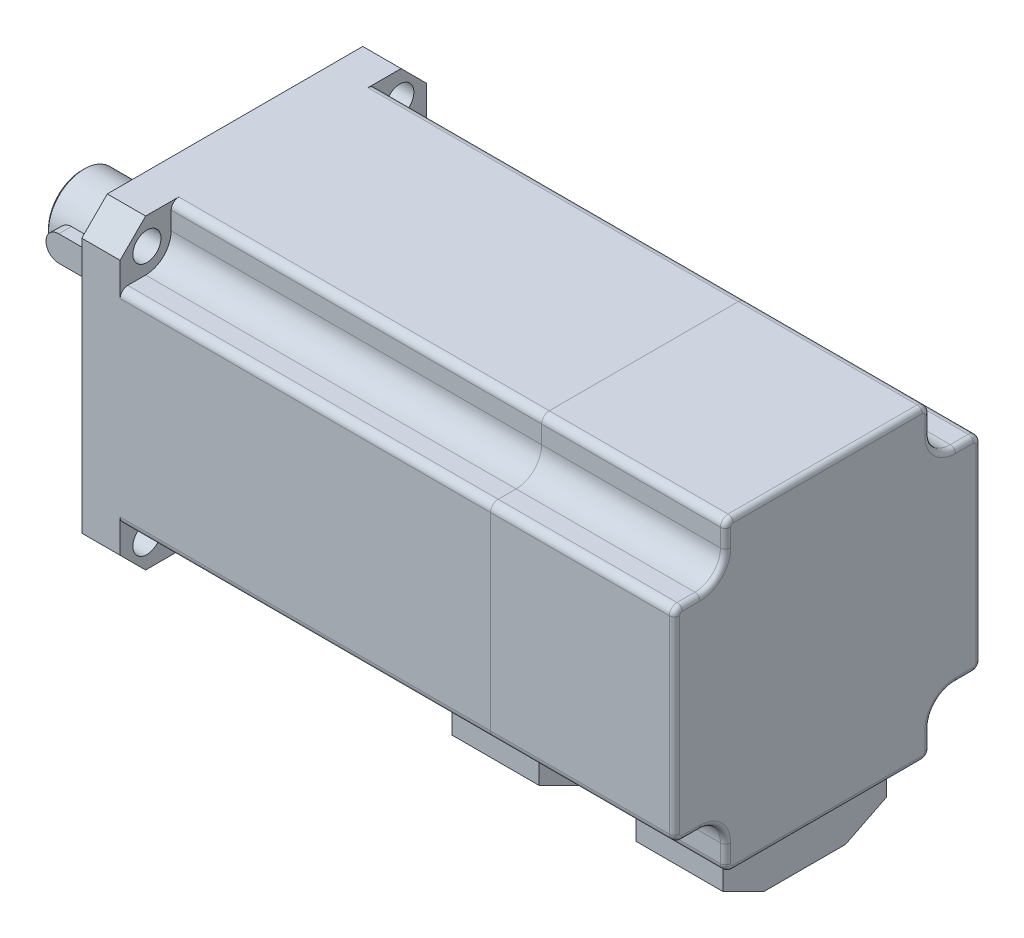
ISO-10303-21;
HEADER;
FILE_DESCRIPTION(('STEP AP214'),'2;1');
FILE_NAME('part.step','',(''),(''),'','','');
FILE_SCHEMA(('AUTOMOTIVE_DESIGN { 1 0 10303 214 1 1 1 1 }'));
ENDSEC;
DATA;
#1=APPLICATION_CONTEXT('core data for automotive mechanical design processes');
#2=APPLICATION_PROTOCOL_DEFINITION('international standard','automotive_design',2000,#1);
#3=PRODUCT_CONTEXT('',#1,'mechanical');
#4=PRODUCT('Part','Part','',(#3));
#5=PRODUCT_RELATED_PRODUCT_CATEGORY('part','',(#4));
#6=PRODUCT_DEFINITION_FORMATION('','',#4);
#7=PRODUCT_DEFINITION_CONTEXT('part definition',#1,'design');
#8=PRODUCT_DEFINITION('design','',#6,#7);
#9=PRODUCT_DEFINITION_SHAPE('','',#8);
#10=(LENGTH_UNIT() NAMED_UNIT(*) SI_UNIT(.MILLI.,.METRE.));
#11=(NAMED_UNIT(*) PLANE_ANGLE_UNIT() SI_UNIT($,.RADIAN.));
#12=(NAMED_UNIT(*) SI_UNIT($,.STERADIAN.) SOLID_ANGLE_UNIT());
#13=UNCERTAINTY_MEASURE_WITH_UNIT(LENGTH_MEASURE(1.E-05),#10,'distance_accuracy_value','');
#14=(GEOMETRIC_REPRESENTATION_CONTEXT(3) GLOBAL_UNCERTAINTY_ASSIGNED_CONTEXT((#13)) GLOBAL_UNIT_ASSIGNED_CONTEXT((#10,
#11,#12)) REPRESENTATION_CONTEXT('',''));
#15=CARTESIAN_POINT('',(0.,0.,0.));
#16=DIRECTION('',(0.,0.,1.));
#17=DIRECTION('',(1.,0.,0.));
#18=AXIS2_PLACEMENT_3D('',#15,#16,#17);
#19=CARTESIAN_POINT('',(75.5,-41.,-16.));
#20=DIRECTION('',(-1.,0.,0.));
#21=DIRECTION('',(0.,0.,1.));
#22=AXIS2_PLACEMENT_3D('',#19,#20,#21);
#23=PLANE('',#22);
#24=DIRECTION('',(0.,0.,1.));
#25=VECTOR('',#24,1.);
#26=CARTESIAN_POINT('',(75.5,-41.,-16.));
#27=LINE('',#26,#25);
#28=CARTESIAN_POINT('',(75.5,-41.,-8.00000000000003));
#29=VERTEX_POINT('',#28);
#30=CARTESIAN_POINT('',(75.5,-41.,7.99999999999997));
#31=VERTEX_POINT('',#30);
#32=EDGE_CURVE('E114',#29,#31,#27,.T.);
#33=ORIENTED_EDGE('',*,*,#32,.F.);
#34=DIRECTION('',(0.,0.447213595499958,-0.894427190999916));
#35=VECTOR('',#34,1.);
#36=CARTESIAN_POINT('',(75.5,-37.8,-14.4));
#37=LINE('',#36,#35);
#38=CARTESIAN_POINT('',(75.5,-37.,-16.));
#39=VERTEX_POINT('',#38);
#40=EDGE_CURVE('E68',#29,#39,#37,.T.);
#41=ORIENTED_EDGE('',*,*,#40,.T.);
#42=DIRECTION('',(0.,1.,0.));
#43=VECTOR('',#42,1.);
#44=CARTESIAN_POINT('',(75.5,-41.,-16.));
#45=LINE('',#44,#43);
#46=CARTESIAN_POINT('',(75.5,-30.,-16.));
#47=VERTEX_POINT('',#46);
#48=EDGE_CURVE('E113',#39,#47,#45,.T.);
#49=ORIENTED_EDGE('',*,*,#48,.T.);
#50=DIRECTION('',(0.,0.,1.));
#51=VECTOR('',#50,1.);
#52=CARTESIAN_POINT('',(75.5,-30.,-16.));
#53=LINE('',#52,#51);
#54=CARTESIAN_POINT('',(75.5,-30.,16.));
#55=VERTEX_POINT('',#54);
#56=EDGE_CURVE('E121',#47,#55,#53,.T.);
#57=ORIENTED_EDGE('',*,*,#56,.T.);
#58=DIRECTION('',(0.,1.,0.));
#59=VECTOR('',#58,1.);
#60=CARTESIAN_POINT('',(75.5,-41.,16.));
#61=LINE('',#60,#59);
#62=CARTESIAN_POINT('',(75.5,-37.,16.));
#63=VERTEX_POINT('',#62);
#64=EDGE_CURVE('E134',#63,#55,#61,.T.);
#65=ORIENTED_EDGE('',*,*,#64,.F.);
#66=DIRECTION('',(0.,-0.447213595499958,-0.894427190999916));
#67=VECTOR('',#66,1.);
#68=CARTESIAN_POINT('',(75.5,-50.6,-11.2));
#69=LINE('',#68,#67);
#70=EDGE_CURVE('E155',#63,#31,#69,.T.);
#71=ORIENTED_EDGE('',*,*,#70,.T.);
#72=EDGE_LOOP('',(#33,#41,#49,#57,#65,#71));
#73=FACE_BOUND('',#72,.T.);
#74=ADVANCED_FACE('F46',(#73),#23,.F.);
#75=CARTESIAN_POINT('',(58.5,-41.,16.));
#76=DIRECTION('',(0.,0.,-1.));
#77=DIRECTION('',(-1.,0.,0.));
#78=AXIS2_PLACEMENT_3D('',#75,#76,#77);
#79=PLANE('',#78);
#80=DIRECTION('',(0.,1.,0.));
#81=VECTOR('',#80,1.);
#82=CARTESIAN_POINT('',(58.5,-41.,16.));
#83=LINE('',#82,#81);
#84=CARTESIAN_POINT('',(58.5,-37.,16.));
#85=VERTEX_POINT('',#84);
#86=CARTESIAN_POINT('',(58.5,-30.,16.));
#87=VERTEX_POINT('',#86);
#88=EDGE_CURVE('E132',#85,#87,#83,.T.);
#89=ORIENTED_EDGE('',*,*,#88,.F.);
#90=DIRECTION('',(-1.,0.,0.));
#91=VECTOR('',#90,1.);
#92=CARTESIAN_POINT('',(111.5,-37.,16.));
#93=LINE('',#92,#91);
#94=EDGE_CURVE('E110',#63,#85,#93,.T.);
#95=ORIENTED_EDGE('',*,*,#94,.F.);
#96=ORIENTED_EDGE('',*,*,#64,.T.);
#97=DIRECTION('',(-1.,0.,0.));
#98=VECTOR('',#97,1.);
#99=CARTESIAN_POINT('',(58.5,-30.,16.));
#100=LINE('',#99,#98);
#101=EDGE_CURVE('E124',#55,#87,#100,.T.);
#102=ORIENTED_EDGE('',*,*,#101,.T.);
#103=EDGE_LOOP('',(#89,#95,#96,#102));
#104=FACE_BOUND('',#103,.T.);
#105=ADVANCED_FACE('F140',(#104),#79,.F.);
#106=CARTESIAN_POINT('',(58.5,-41.,-16.));
#107=DIRECTION('',(1.,0.,0.));
#108=DIRECTION('',(0.,0.,-1.));
#109=AXIS2_PLACEMENT_3D('',#106,#107,#108);
#110=PLANE('',#109);
#111=DIRECTION('',(0.,1.,0.));
#112=VECTOR('',#111,1.);
#113=CARTESIAN_POINT('',(58.5,-41.,-16.));
#114=LINE('',#113,#112);
#115=CARTESIAN_POINT('',(58.5,-37.,-16.));
#116=VERTEX_POINT('',#115);
#117=CARTESIAN_POINT('',(58.5,-30.,-16.));
#118=VERTEX_POINT('',#117);
#119=EDGE_CURVE('E108',#116,#118,#114,.T.);
#120=ORIENTED_EDGE('',*,*,#119,.F.);
#121=DIRECTION('',(0.,0.447213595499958,-0.894427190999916));
#122=VECTOR('',#121,1.);
#123=CARTESIAN_POINT('',(58.5,-37.,-16.));
#124=LINE('',#123,#122);
#125=CARTESIAN_POINT('',(58.5,-41.,-8.00000000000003));
#126=VERTEX_POINT('',#125);
#127=EDGE_CURVE('E96',#126,#116,#124,.T.);
#128=ORIENTED_EDGE('',*,*,#127,.F.);
#129=DIRECTION('',(0.,0.,-1.));
#130=VECTOR('',#129,1.);
#131=CARTESIAN_POINT('',(58.5,-41.,-16.));
#132=LINE('',#131,#130);
#133=CARTESIAN_POINT('',(58.5,-41.,7.99999999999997));
#134=VERTEX_POINT('',#133);
#135=EDGE_CURVE('E106',#134,#126,#132,.T.);
#136=ORIENTED_EDGE('',*,*,#135,.F.);
#137=DIRECTION('',(0.,-0.447213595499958,-0.894427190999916));
#138=VECTOR('',#137,1.);
#139=CARTESIAN_POINT('',(58.5,-41.,7.99999999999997));
#140=LINE('',#139,#138);
#141=EDGE_CURVE('E60',#85,#134,#140,.T.);
#142=ORIENTED_EDGE('',*,*,#141,.F.);
#143=ORIENTED_EDGE('',*,*,#88,.T.);
#144=DIRECTION('',(0.,0.,-1.));
#145=VECTOR('',#144,1.);
#146=CARTESIAN_POINT('',(58.5,-30.,-16.));
#147=LINE('',#146,#145);
#148=EDGE_CURVE('E127',#87,#118,#147,.T.);
#149=ORIENTED_EDGE('',*,*,#148,.T.);
#150=EDGE_LOOP('',(#120,#128,#136,#142,#143,#149));
#151=FACE_BOUND('',#150,.T.);
#152=ADVANCED_FACE('F105',(#151),#110,.F.);
#153=CARTESIAN_POINT('',(58.5,-41.,-16.));
#154=DIRECTION('',(0.,0.,1.));
#155=DIRECTION('',(1.,0.,0.));
#156=AXIS2_PLACEMENT_3D('',#153,#154,#155);
#157=PLANE('',#156);
#158=ORIENTED_EDGE('',*,*,#48,.F.);
#159=DIRECTION('',(-1.,0.,0.));
#160=VECTOR('',#159,1.);
#161=CARTESIAN_POINT('',(111.5,-37.,-16.));
#162=LINE('',#161,#160);
#163=EDGE_CURVE('E109',#39,#116,#162,.T.);
#164=ORIENTED_EDGE('',*,*,#163,.T.);
#165=ORIENTED_EDGE('',*,*,#119,.T.);
#166=DIRECTION('',(1.,0.,0.));
#167=VECTOR('',#166,1.);
#168=CARTESIAN_POINT('',(58.5,-30.,-16.));
#169=LINE('',#168,#167);
#170=EDGE_CURVE('E117',#118,#47,#169,.T.);
#171=ORIENTED_EDGE('',*,*,#170,.T.);
#172=EDGE_LOOP('',(#158,#164,#165,#171));
#173=FACE_BOUND('',#172,.T.);
#174=ADVANCED_FACE('F150',(#173),#157,.F.);
#175=CARTESIAN_POINT('',(0.,-41.,0.));
#176=DIRECTION('',(0.,1.,0.));
#177=DIRECTION('',(0.,0.,1.));
#178=AXIS2_PLACEMENT_3D('',#175,#176,#177);
#179=PLANE('',#178);
#180=ORIENTED_EDGE('',*,*,#135,.T.);
#181=DIRECTION('',(1.,0.,0.));
#182=VECTOR('',#181,1.);
#183=CARTESIAN_POINT('',(0.,-41.,-8.00000000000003));
#184=LINE('',#183,#182);
#185=EDGE_CURVE('E12',#126,#29,#184,.T.);
#186=ORIENTED_EDGE('',*,*,#185,.T.);
#187=ORIENTED_EDGE('',*,*,#32,.T.);
#188=DIRECTION('',(-1.,0.,0.));
#189=VECTOR('',#188,1.);
#190=CARTESIAN_POINT('',(0.,-41.,7.99999999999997));
#191=LINE('',#190,#189);
#192=EDGE_CURVE('E53',#31,#134,#191,.T.);
#193=ORIENTED_EDGE('',*,*,#192,.T.);
#194=EDGE_LOOP('',(#180,#186,#187,#193));
#195=FACE_BOUND('',#194,.T.);
#196=ADVANCED_FACE('F112',(#195),#179,.F.);
#197=CARTESIAN_POINT('',(0.,-30.,0.));
#198=DIRECTION('',(0.,1.,0.));
#199=DIRECTION('',(0.,0.,1.));
#200=AXIS2_PLACEMENT_3D('',#197,#198,#199);
#201=PLANE('',#200);
#202=ORIENTED_EDGE('',*,*,#56,.F.);
#203=ORIENTED_EDGE('',*,*,#170,.F.);
#204=ORIENTED_EDGE('',*,*,#148,.F.);
#205=ORIENTED_EDGE('',*,*,#101,.F.);
#206=EDGE_LOOP('',(#202,#203,#204,#205));
#207=FACE_BOUND('',#206,.T.);
#208=ADVANCED_FACE('F146',(#207),#201,.T.);
#209=CARTESIAN_POINT('',(111.5,-41.,7.99999999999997));
#210=DIRECTION('',(0.,0.894427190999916,-0.447213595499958));
#211=DIRECTION('',(0.,0.447213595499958,0.894427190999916));
#212=AXIS2_PLACEMENT_3D('',#209,#210,#211);
#213=PLANE('',#212);
#214=ORIENTED_EDGE('',*,*,#94,.T.);
#215=ORIENTED_EDGE('',*,*,#141,.T.);
#216=ORIENTED_EDGE('',*,*,#192,.F.);
#217=ORIENTED_EDGE('',*,*,#70,.F.);
#218=EDGE_LOOP('',(#214,#215,#216,#217));
#219=FACE_BOUND('',#218,.T.);
#220=ADVANCED_FACE('F156',(#219),#213,.F.);
#221=CARTESIAN_POINT('',(111.5,-37.,-16.));
#222=DIRECTION('',(0.,0.894427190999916,0.447213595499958));
#223=DIRECTION('',(0.,-0.447213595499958,0.894427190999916));
#224=AXIS2_PLACEMENT_3D('',#221,#222,#223);
#225=PLANE('',#224);
#226=ORIENTED_EDGE('',*,*,#185,.F.);
#227=ORIENTED_EDGE('',*,*,#127,.T.);
#228=ORIENTED_EDGE('',*,*,#163,.F.);
#229=ORIENTED_EDGE('',*,*,#40,.F.);
#230=EDGE_LOOP('',(#226,#227,#228,#229));
#231=FACE_BOUND('',#230,.T.);
#232=ADVANCED_FACE('F95',(#231),#225,.F.);
#233=CLOSED_SHELL('',(#74,#105,#152,#174,#196,#208,#220,#232));
#234=MANIFOLD_SOLID_BREP('B2',#233);
#235=CARTESIAN_POINT('',(111.5,-41.,-16.));
#236=DIRECTION('',(-1.,0.,0.));
#237=DIRECTION('',(0.,0.,1.));
#238=AXIS2_PLACEMENT_3D('',#235,#236,#237);
#239=PLANE('',#238);
#240=DIRECTION('',(0.,0.,1.));
#241=VECTOR('',#240,1.);
#242=CARTESIAN_POINT('',(111.5,-41.,-16.));
#243=LINE('',#242,#241);
#244=CARTESIAN_POINT('',(111.5,-41.,-8.00000000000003));
#245=VERTEX_POINT('',#244);
#246=CARTESIAN_POINT('',(111.5,-41.,7.99999999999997));
#247=VERTEX_POINT('',#246);
#248=EDGE_CURVE('E297',#245,#247,#243,.T.);
#249=ORIENTED_EDGE('',*,*,#248,.F.);
#250=DIRECTION('',(0.,0.447213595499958,-0.894427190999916));
#251=VECTOR('',#250,1.);
#252=CARTESIAN_POINT('',(111.5,-37.,-16.));
#253=LINE('',#252,#251);
#254=CARTESIAN_POINT('',(111.5,-37.,-16.));
#255=VERTEX_POINT('',#254);
#256=EDGE_CURVE('E254',#245,#255,#253,.T.);
#257=ORIENTED_EDGE('',*,*,#256,.T.);
#258=DIRECTION('',(0.,1.,0.));
#259=VECTOR('',#258,1.);
#260=CARTESIAN_POINT('',(111.5,-41.,-16.));
#261=LINE('',#260,#259);
#262=CARTESIAN_POINT('',(111.5,-30.,-16.));
#263=VERTEX_POINT('',#262);
#264=EDGE_CURVE('E293',#255,#263,#261,.T.);
#265=ORIENTED_EDGE('',*,*,#264,.T.);
#266=DIRECTION('',(0.,0.,1.));
#267=VECTOR('',#266,1.);
#268=CARTESIAN_POINT('',(111.5,-30.,-16.));
#269=LINE('',#268,#267);
#270=CARTESIAN_POINT('',(111.5,-30.,16.));
#271=VERTEX_POINT('',#270);
#272=EDGE_CURVE('E327',#263,#271,#269,.T.);
#273=ORIENTED_EDGE('',*,*,#272,.T.);
#274=DIRECTION('',(0.,1.,0.));
#275=VECTOR('',#274,1.);
#276=CARTESIAN_POINT('',(111.5,-41.,16.));
#277=LINE('',#276,#275);
#278=CARTESIAN_POINT('',(111.5,-37.,16.));
#279=VERTEX_POINT('',#278);
#280=EDGE_CURVE('E44',#279,#271,#277,.T.);
#281=ORIENTED_EDGE('',*,*,#280,.F.);
#282=DIRECTION('',(0.,-0.447213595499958,-0.894427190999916));
#283=VECTOR('',#282,1.);
#284=CARTESIAN_POINT('',(111.5,-41.,7.99999999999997));
#285=LINE('',#284,#283);
#286=EDGE_CURVE('E337',#279,#247,#285,.T.);
#287=ORIENTED_EDGE('',*,*,#286,.T.);
#288=EDGE_LOOP('',(#249,#257,#265,#273,#281,#287));
#289=FACE_BOUND('',#288,.T.);
#290=ADVANCED_FACE('F232',(#289),#239,.F.);
#291=CARTESIAN_POINT('',(94.5,-41.,16.));
#292=DIRECTION('',(0.,0.,-1.));
#293=DIRECTION('',(-1.,0.,0.));
#294=AXIS2_PLACEMENT_3D('',#291,#292,#293);
#295=PLANE('',#294);
#296=DIRECTION('',(0.,1.,0.));
#297=VECTOR('',#296,1.);
#298=CARTESIAN_POINT('',(94.5,-41.,16.));
#299=LINE('',#298,#297);
#300=CARTESIAN_POINT('',(94.5,-37.,16.));
#301=VERTEX_POINT('',#300);
#302=CARTESIAN_POINT('',(94.5,-30.,16.));
#303=VERTEX_POINT('',#302);
#304=EDGE_CURVE('E239',#301,#303,#299,.T.);
#305=ORIENTED_EDGE('',*,*,#304,.F.);
#306=DIRECTION('',(-1.,0.,0.));
#307=VECTOR('',#306,1.);
#308=CARTESIAN_POINT('',(111.5,-37.,16.));
#309=LINE('',#308,#307);
#310=EDGE_CURVE('E335',#279,#301,#309,.T.);
#311=ORIENTED_EDGE('',*,*,#310,.F.);
#312=ORIENTED_EDGE('',*,*,#280,.T.);
#313=DIRECTION('',(-1.,0.,0.));
#314=VECTOR('',#313,1.);
#315=CARTESIAN_POINT('',(94.5,-30.,16.));
#316=LINE('',#315,#314);
#317=EDGE_CURVE('E323',#271,#303,#316,.T.);
#318=ORIENTED_EDGE('',*,*,#317,.T.);
#319=EDGE_LOOP('',(#305,#311,#312,#318));
#320=FACE_BOUND('',#319,.T.);
#321=ADVANCED_FACE('F324',(#320),#295,.F.);
#322=CARTESIAN_POINT('',(94.5,-41.,-16.));
#323=DIRECTION('',(1.,0.,0.));
#324=DIRECTION('',(0.,0.,-1.));
#325=AXIS2_PLACEMENT_3D('',#322,#323,#324);
#326=PLANE('',#325);
#327=DIRECTION('',(0.,1.,0.));
#328=VECTOR('',#327,1.);
#329=CARTESIAN_POINT('',(94.5,-41.,-16.));
#330=LINE('',#329,#328);
#331=CARTESIAN_POINT('',(94.5,-37.,-16.));
#332=VERTEX_POINT('',#331);
#333=CARTESIAN_POINT('',(94.5,-30.,-16.));
#334=VERTEX_POINT('',#333);
#335=EDGE_CURVE('E304',#332,#334,#330,.T.);
#336=ORIENTED_EDGE('',*,*,#335,.F.);
#337=DIRECTION('',(0.,-0.447213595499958,0.894427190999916));
#338=VECTOR('',#337,1.);
#339=CARTESIAN_POINT('',(94.5,-37.8,-14.4));
#340=LINE('',#339,#338);
#341=CARTESIAN_POINT('',(94.5,-41.,-8.00000000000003));
#342=VERTEX_POINT('',#341);
#343=EDGE_CURVE('E284',#332,#342,#340,.T.);
#344=ORIENTED_EDGE('',*,*,#343,.T.);
#345=DIRECTION('',(0.,0.,-1.));
#346=VECTOR('',#345,1.);
#347=CARTESIAN_POINT('',(94.5,-41.,-16.));
#348=LINE('',#347,#346);
#349=CARTESIAN_POINT('',(94.5,-41.,7.99999999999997));
#350=VERTEX_POINT('',#349);
#351=EDGE_CURVE('E305',#350,#342,#348,.T.);
#352=ORIENTED_EDGE('',*,*,#351,.F.);
#353=DIRECTION('',(0.,0.447213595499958,0.894427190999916));
#354=VECTOR('',#353,1.);
#355=CARTESIAN_POINT('',(94.5,-50.6,-11.2));
#356=LINE('',#355,#354);
#357=EDGE_CURVE('E246',#350,#301,#356,.T.);
#358=ORIENTED_EDGE('',*,*,#357,.T.);
#359=ORIENTED_EDGE('',*,*,#304,.T.);
#360=DIRECTION('',(0.,0.,-1.));
#361=VECTOR('',#360,1.);
#362=CARTESIAN_POINT('',(94.5,-30.,-16.));
#363=LINE('',#362,#361);
#364=EDGE_CURVE('E318',#303,#334,#363,.T.);
#365=ORIENTED_EDGE('',*,*,#364,.T.);
#366=EDGE_LOOP('',(#336,#344,#352,#358,#359,#365));
#367=FACE_BOUND('',#366,.T.);
#368=ADVANCED_FACE('F316',(#367),#326,.F.);
#369=CARTESIAN_POINT('',(94.5,-41.,-16.));
#370=DIRECTION('',(0.,0.,1.));
#371=DIRECTION('',(1.,0.,0.));
#372=AXIS2_PLACEMENT_3D('',#369,#370,#371);
#373=PLANE('',#372);
#374=ORIENTED_EDGE('',*,*,#264,.F.);
#375=DIRECTION('',(-1.,0.,0.));
#376=VECTOR('',#375,1.);
#377=CARTESIAN_POINT('',(111.5,-37.,-16.));
#378=LINE('',#377,#376);
#379=EDGE_CURVE('E281',#255,#332,#378,.T.);
#380=ORIENTED_EDGE('',*,*,#379,.T.);
#381=ORIENTED_EDGE('',*,*,#335,.T.);
#382=DIRECTION('',(1.,0.,0.));
#383=VECTOR('',#382,1.);
#384=CARTESIAN_POINT('',(94.5,-30.,-16.));
#385=LINE('',#384,#383);
#386=EDGE_CURVE('E302',#334,#263,#385,.T.);
#387=ORIENTED_EDGE('',*,*,#386,.T.);
#388=EDGE_LOOP('',(#374,#380,#381,#387));
#389=FACE_BOUND('',#388,.T.);
#390=ADVANCED_FACE('F300',(#389),#373,.F.);
#391=CARTESIAN_POINT('',(0.,-41.,0.));
#392=DIRECTION('',(0.,1.,0.));
#393=DIRECTION('',(0.,0.,1.));
#394=AXIS2_PLACEMENT_3D('',#391,#392,#393);
#395=PLANE('',#394);
#396=ORIENTED_EDGE('',*,*,#351,.T.);
#397=DIRECTION('',(-1.,0.,0.));
#398=VECTOR('',#397,1.);
#399=CARTESIAN_POINT('',(111.5,-41.,-8.00000000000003));
#400=LINE('',#399,#398);
#401=EDGE_CURVE('E288',#245,#342,#400,.T.);
#402=ORIENTED_EDGE('',*,*,#401,.F.);
#403=ORIENTED_EDGE('',*,*,#248,.T.);
#404=DIRECTION('',(-1.,0.,0.));
#405=VECTOR('',#404,1.);
#406=CARTESIAN_POINT('',(111.5,-41.,7.99999999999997));
#407=LINE('',#406,#405);
#408=EDGE_CURVE('E298',#247,#350,#407,.T.);
#409=ORIENTED_EDGE('',*,*,#408,.T.);
#410=EDGE_LOOP('',(#396,#402,#403,#409));
#411=FACE_BOUND('',#410,.T.);
#412=ADVANCED_FACE('F341',(#411),#395,.F.);
#413=CARTESIAN_POINT('',(0.,-30.,0.));
#414=DIRECTION('',(0.,1.,0.));
#415=DIRECTION('',(0.,0.,1.));
#416=AXIS2_PLACEMENT_3D('',#413,#414,#415);
#417=PLANE('',#416);
#418=ORIENTED_EDGE('',*,*,#272,.F.);
#419=ORIENTED_EDGE('',*,*,#386,.F.);
#420=ORIENTED_EDGE('',*,*,#364,.F.);
#421=ORIENTED_EDGE('',*,*,#317,.F.);
#422=EDGE_LOOP('',(#418,#419,#420,#421));
#423=FACE_BOUND('',#422,.T.);
#424=ADVANCED_FACE('F329',(#423),#417,.T.);
#425=CARTESIAN_POINT('',(111.5,-41.,7.99999999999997));
#426=DIRECTION('',(0.,0.894427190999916,-0.447213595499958));
#427=DIRECTION('',(0.,0.447213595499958,0.894427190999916));
#428=AXIS2_PLACEMENT_3D('',#425,#426,#427);
#429=PLANE('',#428);
#430=ORIENTED_EDGE('',*,*,#408,.F.);
#431=ORIENTED_EDGE('',*,*,#286,.F.);
#432=ORIENTED_EDGE('',*,*,#310,.T.);
#433=ORIENTED_EDGE('',*,*,#357,.F.);
#434=EDGE_LOOP('',(#430,#431,#432,#433));
#435=FACE_BOUND('',#434,.T.);
#436=ADVANCED_FACE('F342',(#435),#429,.F.);
#437=CARTESIAN_POINT('',(111.5,-37.,-16.));
#438=DIRECTION('',(0.,0.894427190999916,0.447213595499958));
#439=DIRECTION('',(0.,-0.447213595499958,0.894427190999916));
#440=AXIS2_PLACEMENT_3D('',#437,#438,#439);
#441=PLANE('',#440);
#442=ORIENTED_EDGE('',*,*,#379,.F.);
#443=ORIENTED_EDGE('',*,*,#256,.F.);
#444=ORIENTED_EDGE('',*,*,#401,.T.);
#445=ORIENTED_EDGE('',*,*,#343,.F.);
#446=EDGE_LOOP('',(#442,#443,#444,#445));
#447=FACE_BOUND('',#446,.T.);
#448=ADVANCED_FACE('F282',(#447),#441,.F.);
#449=CLOSED_SHELL('',(#290,#321,#368,#390,#412,#424,#436,#448));
#450=MANIFOLD_SOLID_BREP('B6',#449);
#451=CARTESIAN_POINT('',(-25.5,0.,9.));
#452=DIRECTION('',(0.,0.,-1.));
#453=DIRECTION('',(-1.,0.,0.));
#454=AXIS2_PLACEMENT_3D('',#451,#452,#453);
#455=CYLINDRICAL_SURFACE('',#454,2.5);
#456=CARTESIAN_POINT('',(-25.5,0.,4.));
#457=DIRECTION('',(0.,0.,1.));
#458=DIRECTION('',(1.,0.,0.));
#459=AXIS2_PLACEMENT_3D('',#456,#457,#458);
#460=CIRCLE('',#459,2.5);
#461=CARTESIAN_POINT('',(-25.5,2.5,4.));
#462=VERTEX_POINT('',#461);
#463=CARTESIAN_POINT('',(-25.5,-2.5,4.));
#464=VERTEX_POINT('',#463);
#465=EDGE_CURVE('E481',#462,#464,#460,.T.);
#466=ORIENTED_EDGE('',*,*,#465,.T.);
#467=DIRECTION('',(0.,0.,-1.));
#468=VECTOR('',#467,1.);
#469=CARTESIAN_POINT('',(-25.5,-2.5,9.));
#470=LINE('',#469,#468);
#471=CARTESIAN_POINT('',(-25.5,-2.5,9.));
#472=VERTEX_POINT('',#471);
#473=EDGE_CURVE('E230',#472,#464,#470,.T.);
#474=ORIENTED_EDGE('',*,*,#473,.F.);
#475=CARTESIAN_POINT('',(-25.5,0.,9.));
#476=DIRECTION('',(0.,0.,1.));
#477=DIRECTION('',(1.,0.,0.));
#478=AXIS2_PLACEMENT_3D('',#475,#476,#477);
#479=CIRCLE('',#478,2.5);
#480=CARTESIAN_POINT('',(-25.5,2.5,9.));
#481=VERTEX_POINT('',#480);
#482=EDGE_CURVE('E469',#481,#472,#479,.T.);
#483=ORIENTED_EDGE('',*,*,#482,.F.);
#484=DIRECTION('',(0.,0.,-1.));
#485=VECTOR('',#484,1.);
#486=CARTESIAN_POINT('',(-25.5,2.5,9.));
#487=LINE('',#486,#485);
#488=EDGE_CURVE('E477',#481,#462,#487,.T.);
#489=ORIENTED_EDGE('',*,*,#488,.T.);
#490=EDGE_LOOP('',(#466,#474,#483,#489));
#491=FACE_BOUND('',#490,.T.);
#492=ADVANCED_FACE('F418',(#491),#455,.T.);
#493=CARTESIAN_POINT('',(-10.,-2.5,9.));
#494=DIRECTION('',(0.,1.,0.));
#495=DIRECTION('',(-1.,0.,0.));
#496=AXIS2_PLACEMENT_3D('',#493,#494,#495);
#497=PLANE('',#496);
#498=DIRECTION('',(1.,0.,0.));
#499=VECTOR('',#498,1.);
#500=CARTESIAN_POINT('',(-10.,-2.5,4.));
#501=LINE('',#500,#499);
#502=CARTESIAN_POINT('',(-10.,-2.5,4.));
#503=VERTEX_POINT('',#502);
#504=EDGE_CURVE('E473',#464,#503,#501,.T.);
#505=ORIENTED_EDGE('',*,*,#504,.T.);
#506=DIRECTION('',(0.,0.,-1.));
#507=VECTOR('',#506,1.);
#508=CARTESIAN_POINT('',(-10.,-2.5,9.));
#509=LINE('',#508,#507);
#510=CARTESIAN_POINT('',(-10.,-2.5,9.));
#511=VERTEX_POINT('',#510);
#512=EDGE_CURVE('E426',#511,#503,#509,.T.);
#513=ORIENTED_EDGE('',*,*,#512,.F.);
#514=DIRECTION('',(1.,0.,0.));
#515=VECTOR('',#514,1.);
#516=CARTESIAN_POINT('',(-10.,-2.5,9.));
#517=LINE('',#516,#515);
#518=EDGE_CURVE('E464',#472,#511,#517,.T.);
#519=ORIENTED_EDGE('',*,*,#518,.F.);
#520=ORIENTED_EDGE('',*,*,#473,.T.);
#521=EDGE_LOOP('',(#505,#513,#519,#520));
#522=FACE_BOUND('',#521,.T.);
#523=ADVANCED_FACE('F472',(#522),#497,.F.);
#524=CARTESIAN_POINT('',(-10.,0.,9.));
#525=DIRECTION('',(0.,0.,-1.));
#526=DIRECTION('',(-1.,0.,0.));
#527=AXIS2_PLACEMENT_3D('',#524,#525,#526);
#528=CYLINDRICAL_SURFACE('',#527,2.5);
#529=CARTESIAN_POINT('',(-10.,0.,4.));
#530=DIRECTION('',(0.,0.,1.));
#531=DIRECTION('',(1.,0.,0.));
#532=AXIS2_PLACEMENT_3D('',#529,#530,#531);
#533=CIRCLE('',#532,2.5);
#534=CARTESIAN_POINT('',(-10.,2.5,4.));
#535=VERTEX_POINT('',#534);
#536=EDGE_CURVE('E451',#503,#535,#533,.T.);
#537=ORIENTED_EDGE('',*,*,#536,.T.);
#538=DIRECTION('',(0.,0.,-1.));
#539=VECTOR('',#538,1.);
#540=CARTESIAN_POINT('',(-10.,2.5,9.));
#541=LINE('',#540,#539);
#542=CARTESIAN_POINT('',(-10.,2.5,9.));
#543=VERTEX_POINT('',#542);
#544=EDGE_CURVE('E474',#543,#535,#541,.T.);
#545=ORIENTED_EDGE('',*,*,#544,.F.);
#546=CARTESIAN_POINT('',(-10.,0.,9.));
#547=DIRECTION('',(0.,0.,1.));
#548=DIRECTION('',(1.,0.,0.));
#549=AXIS2_PLACEMENT_3D('',#546,#547,#548);
#550=CIRCLE('',#549,2.5);
#551=EDGE_CURVE('E467',#511,#543,#550,.T.);
#552=ORIENTED_EDGE('',*,*,#551,.F.);
#553=ORIENTED_EDGE('',*,*,#512,.T.);
#554=EDGE_LOOP('',(#537,#545,#552,#553));
#555=FACE_BOUND('',#554,.T.);
#556=ADVANCED_FACE('F475',(#555),#528,.T.);
#557=CARTESIAN_POINT('',(-25.5,2.5,9.));
#558=DIRECTION('',(0.,-1.,0.));
#559=DIRECTION('',(1.,0.,0.));
#560=AXIS2_PLACEMENT_3D('',#557,#558,#559);
#561=PLANE('',#560);
#562=DIRECTION('',(-1.,0.,0.));
#563=VECTOR('',#562,1.);
#564=CARTESIAN_POINT('',(-25.5,2.5,4.));
#565=LINE('',#564,#563);
#566=EDGE_CURVE('E457',#535,#462,#565,.T.);
#567=ORIENTED_EDGE('',*,*,#566,.T.);
#568=ORIENTED_EDGE('',*,*,#488,.F.);
#569=DIRECTION('',(-1.,0.,0.));
#570=VECTOR('',#569,1.);
#571=CARTESIAN_POINT('',(-25.5,2.5,9.));
#572=LINE('',#571,#570);
#573=EDGE_CURVE('E434',#543,#481,#572,.T.);
#574=ORIENTED_EDGE('',*,*,#573,.F.);
#575=ORIENTED_EDGE('',*,*,#544,.T.);
#576=EDGE_LOOP('',(#567,#568,#574,#575));
#577=FACE_BOUND('',#576,.T.);
#578=ADVANCED_FACE('F488',(#577),#561,.F.);
#579=CARTESIAN_POINT('',(-25.5,0.,9.));
#580=DIRECTION('',(0.,0.,1.));
#581=DIRECTION('',(1.,0.,0.));
#582=AXIS2_PLACEMENT_3D('',#579,#580,#581);
#583=PLANE('',#582);
#584=ORIENTED_EDGE('',*,*,#482,.T.);
#585=ORIENTED_EDGE('',*,*,#518,.T.);
#586=ORIENTED_EDGE('',*,*,#551,.T.);
#587=ORIENTED_EDGE('',*,*,#573,.T.);
#588=EDGE_LOOP('',(#584,#585,#586,#587));
#589=FACE_BOUND('',#588,.T.);
#590=ADVANCED_FACE('F465',(#589),#583,.T.);
#591=CARTESIAN_POINT('',(-25.5,0.,4.));
#592=DIRECTION('',(0.,0.,1.));
#593=DIRECTION('',(1.,0.,0.));
#594=AXIS2_PLACEMENT_3D('',#591,#592,#593);
#595=PLANE('',#594);
#596=ORIENTED_EDGE('',*,*,#465,.F.);
#597=ORIENTED_EDGE('',*,*,#566,.F.);
#598=ORIENTED_EDGE('',*,*,#536,.F.);
#599=ORIENTED_EDGE('',*,*,#504,.F.);
#600=EDGE_LOOP('',(#596,#597,#598,#599));
#601=FACE_BOUND('',#600,.T.);
#602=ADVANCED_FACE('F491',(#601),#595,.F.);
#603=CLOSED_SHELL('',(#492,#523,#556,#578,#590,#602));
#604=MANIFOLD_SOLID_BREP('B38',#603);
#605=CARTESIAN_POINT('',(116.,-25.,30.));
#606=DIRECTION('',(0.,0.,-1.));
#607=DIRECTION('',(-1.,0.,0.));
#608=AXIS2_PLACEMENT_3D('',#605,#606,#607);
#609=PLANE('',#608);
#610=DIRECTION('',(1.,0.,0.));
#611=VECTOR('',#610,1.);
#612=CARTESIAN_POINT('',(7.49999999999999,-18.5,30.));
#613=LINE('',#612,#611);
#614=CARTESIAN_POINT('',(80.,-18.5,30.));
#615=VERTEX_POINT('',#614);
#616=CARTESIAN_POINT('',(115.,-18.5,30.));
#617=VERTEX_POINT('',#616);
#618=EDGE_CURVE('E1645',#615,#617,#613,.T.);
#619=ORIENTED_EDGE('',*,*,#618,.T.);
#620=DIRECTION('',(0.,-1.,0.));
#621=VECTOR('',#620,1.);
#622=CARTESIAN_POINT('',(115.,-25.,30.));
#623=LINE('',#622,#621);
#624=CARTESIAN_POINT('',(115.,18.5,30.));
#625=VERTEX_POINT('',#624);
#626=EDGE_CURVE('E416',#617,#625,#623,.F.);
#627=ORIENTED_EDGE('',*,*,#626,.T.);
#628=DIRECTION('',(1.,0.,0.));
#629=VECTOR('',#628,1.);
#630=CARTESIAN_POINT('',(7.49999999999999,18.5,30.));
#631=LINE('',#630,#629);
#632=CARTESIAN_POINT('',(80.,18.5,30.));
#633=VERTEX_POINT('',#632);
#634=EDGE_CURVE('E1095',#633,#625,#631,.T.);
#635=ORIENTED_EDGE('',*,*,#634,.F.);
#636=DIRECTION('',(0.,-1.,0.));
#637=VECTOR('',#636,1.);
#638=CARTESIAN_POINT('',(80.,-25.,30.));
#639=LINE('',#638,#637);
#640=EDGE_CURVE('E1069',#633,#615,#639,.T.);
#641=ORIENTED_EDGE('',*,*,#640,.T.);
#642=EDGE_LOOP('',(#619,#627,#635,#641));
#643=FACE_BOUND('',#642,.T.);
#644=ADVANCED_FACE('F551',(#643),#609,.F.);
#645=CARTESIAN_POINT('',(116.,-30.,25.));
#646=DIRECTION('',(0.,1.,0.));
#647=DIRECTION('',(0.,0.,1.));
#648=AXIS2_PLACEMENT_3D('',#645,#646,#647);
#649=PLANE('',#648);
#650=DIRECTION('',(1.,0.,0.));
#651=VECTOR('',#650,1.);
#652=CARTESIAN_POINT('',(7.49999999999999,-30.,-18.5));
#653=LINE('',#652,#651);
#654=CARTESIAN_POINT('',(80.,-30.,-18.5));
#655=VERTEX_POINT('',#654);
#656=CARTESIAN_POINT('',(115.,-30.,-18.5));
#657=VERTEX_POINT('',#656);
#658=EDGE_CURVE('E1050',#655,#657,#653,.T.);
#659=ORIENTED_EDGE('',*,*,#658,.T.);
#660=DIRECTION('',(0.,0.,-1.));
#661=VECTOR('',#660,1.);
#662=CARTESIAN_POINT('',(115.,-30.,25.));
#663=LINE('',#662,#661);
#664=CARTESIAN_POINT('',(115.,-30.,18.5));
#665=VERTEX_POINT('',#664);
#666=EDGE_CURVE('E935',#657,#665,#663,.F.);
#667=ORIENTED_EDGE('',*,*,#666,.T.);
#668=DIRECTION('',(1.,0.,0.));
#669=VECTOR('',#668,1.);
#670=CARTESIAN_POINT('',(7.49999999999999,-30.,18.5));
#671=LINE('',#670,#669);
#672=CARTESIAN_POINT('',(80.,-30.,18.5));
#673=VERTEX_POINT('',#672);
#674=EDGE_CURVE('E1643',#673,#665,#671,.T.);
#675=ORIENTED_EDGE('',*,*,#674,.F.);
#676=DIRECTION('',(0.,0.,-1.));
#677=VECTOR('',#676,1.);
#678=CARTESIAN_POINT('',(80.,-30.,25.));
#679=LINE('',#678,#677);
#680=EDGE_CURVE('E1072',#673,#655,#679,.T.);
#681=ORIENTED_EDGE('',*,*,#680,.T.);
#682=EDGE_LOOP('',(#659,#667,#675,#681));
#683=FACE_BOUND('',#682,.T.);
#684=ADVANCED_FACE('F1220',(#683),#649,.F.);
#685=CARTESIAN_POINT('',(116.,-25.,-30.));
#686=DIRECTION('',(0.,0.,1.));
#687=DIRECTION('',(1.,0.,0.));
#688=AXIS2_PLACEMENT_3D('',#685,#686,#687);
#689=PLANE('',#688);
#690=DIRECTION('',(1.,0.,0.));
#691=VECTOR('',#690,1.);
#692=CARTESIAN_POINT('',(7.49999999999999,18.5,-30.));
#693=LINE('',#692,#691);
#694=CARTESIAN_POINT('',(80.,18.5,-30.));
#695=VERTEX_POINT('',#694);
#696=CARTESIAN_POINT('',(115.,18.5,-30.));
#697=VERTEX_POINT('',#696);
#698=EDGE_CURVE('E1065',#695,#697,#693,.T.);
#699=ORIENTED_EDGE('',*,*,#698,.T.);
#700=DIRECTION('',(0.,1.,0.));
#701=VECTOR('',#700,1.);
#702=CARTESIAN_POINT('',(115.,-25.,-30.));
#703=LINE('',#702,#701);
#704=CARTESIAN_POINT('',(115.,-18.5,-30.));
#705=VERTEX_POINT('',#704);
#706=EDGE_CURVE('E923',#697,#705,#703,.F.);
#707=ORIENTED_EDGE('',*,*,#706,.T.);
#708=DIRECTION('',(1.,0.,0.));
#709=VECTOR('',#708,1.);
#710=CARTESIAN_POINT('',(7.49999999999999,-18.5,-30.));
#711=LINE('',#710,#709);
#712=CARTESIAN_POINT('',(80.,-18.5,-30.));
#713=VERTEX_POINT('',#712);
#714=EDGE_CURVE('E1052',#713,#705,#711,.T.);
#715=ORIENTED_EDGE('',*,*,#714,.F.);
#716=DIRECTION('',(0.,1.,0.));
#717=VECTOR('',#716,1.);
#718=CARTESIAN_POINT('',(80.,-25.,-30.));
#719=LINE('',#718,#717);
#720=EDGE_CURVE('E1076',#713,#695,#719,.T.);
#721=ORIENTED_EDGE('',*,*,#720,.T.);
#722=EDGE_LOOP('',(#699,#707,#715,#721));
#723=FACE_BOUND('',#722,.T.);
#724=ADVANCED_FACE('F1119',(#723),#689,.F.);
#725=CARTESIAN_POINT('',(116.,30.,25.));
#726=DIRECTION('',(0.,-1.,0.));
#727=DIRECTION('',(0.,0.,-1.));
#728=AXIS2_PLACEMENT_3D('',#725,#726,#727);
#729=PLANE('',#728);
#730=DIRECTION('',(1.,0.,0.));
#731=VECTOR('',#730,1.);
#732=CARTESIAN_POINT('',(7.49999999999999,30.,18.5));
#733=LINE('',#732,#731);
#734=CARTESIAN_POINT('',(80.,30.,18.5));
#735=VERTEX_POINT('',#734);
#736=CARTESIAN_POINT('',(115.,30.,18.5));
#737=VERTEX_POINT('',#736);
#738=EDGE_CURVE('E1085',#735,#737,#733,.T.);
#739=ORIENTED_EDGE('',*,*,#738,.T.);
#740=DIRECTION('',(0.,0.,1.));
#741=VECTOR('',#740,1.);
#742=CARTESIAN_POINT('',(115.,30.,25.));
#743=LINE('',#742,#741);
#744=CARTESIAN_POINT('',(115.,30.,-18.5));
#745=VERTEX_POINT('',#744);
#746=EDGE_CURVE('E912',#737,#745,#743,.F.);
#747=ORIENTED_EDGE('',*,*,#746,.T.);
#748=DIRECTION('',(1.,0.,0.));
#749=VECTOR('',#748,1.);
#750=CARTESIAN_POINT('',(7.49999999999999,30.,-18.5));
#751=LINE('',#750,#749);
#752=CARTESIAN_POINT('',(80.,30.,-18.5));
#753=VERTEX_POINT('',#752);
#754=EDGE_CURVE('E1062',#753,#745,#751,.T.);
#755=ORIENTED_EDGE('',*,*,#754,.F.);
#756=DIRECTION('',(0.,0.,1.));
#757=VECTOR('',#756,1.);
#758=CARTESIAN_POINT('',(80.,30.,25.));
#759=LINE('',#758,#757);
#760=EDGE_CURVE('E798',#753,#735,#759,.T.);
#761=ORIENTED_EDGE('',*,*,#760,.T.);
#762=EDGE_LOOP('',(#739,#747,#755,#761));
#763=FACE_BOUND('',#762,.T.);
#764=ADVANCED_FACE('F1084',(#763),#729,.F.);
#765=CARTESIAN_POINT('',(116.,0.,0.));
#766=DIRECTION('',(-1.,0.,0.));
#767=DIRECTION('',(0.,0.,1.));
#768=AXIS2_PLACEMENT_3D('',#765,#766,#767);
#769=PLANE('',#768);
#770=DIRECTION('',(0.,0.,-1.));
#771=VECTOR('',#770,1.);
#772=CARTESIAN_POINT('',(116.,19.,0.));
#773=LINE('',#772,#771);
#774=CARTESIAN_POINT('',(116.,19.,25.));
#775=VERTEX_POINT('',#774);
#776=CARTESIAN_POINT('',(116.,19.,28.5));
#777=VERTEX_POINT('',#776);
#778=EDGE_CURVE('E899',#775,#777,#773,.F.);
#779=ORIENTED_EDGE('',*,*,#778,.T.);
#780=CARTESIAN_POINT('',(116.,18.5,28.5));
#781=DIRECTION('',(-1.,0.,0.));
#782=DIRECTION('',(0.,0.,1.));
#783=AXIS2_PLACEMENT_3D('',#780,#781,#782);
#784=CIRCLE('',#783,0.500000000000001);
#785=CARTESIAN_POINT('',(116.,18.5,29.));
#786=VERTEX_POINT('',#785);
#787=EDGE_CURVE('E901',#777,#786,#784,.F.);
#788=ORIENTED_EDGE('',*,*,#787,.T.);
#789=DIRECTION('',(0.,-1.,0.));
#790=VECTOR('',#789,1.);
#791=CARTESIAN_POINT('',(116.,0.,29.));
#792=LINE('',#791,#790);
#793=CARTESIAN_POINT('',(116.,-18.5,29.));
#794=VERTEX_POINT('',#793);
#795=EDGE_CURVE('E855',#786,#794,#792,.T.);
#796=ORIENTED_EDGE('',*,*,#795,.T.);
#797=CARTESIAN_POINT('',(116.,-18.5,28.5));
#798=DIRECTION('',(-1.,0.,0.));
#799=DIRECTION('',(0.,0.,1.));
#800=AXIS2_PLACEMENT_3D('',#797,#798,#799);
#801=CIRCLE('',#800,0.500000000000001);
#802=CARTESIAN_POINT('',(116.,-19.,28.5));
#803=VERTEX_POINT('',#802);
#804=EDGE_CURVE('E857',#794,#803,#801,.F.);
#805=ORIENTED_EDGE('',*,*,#804,.T.);
#806=DIRECTION('',(0.,0.,1.));
#807=VECTOR('',#806,1.);
#808=CARTESIAN_POINT('',(116.,-19.,0.));
#809=LINE('',#808,#807);
#810=CARTESIAN_POINT('',(116.,-19.,25.));
#811=VERTEX_POINT('',#810);
#812=EDGE_CURVE('E859',#803,#811,#809,.F.);
#813=ORIENTED_EDGE('',*,*,#812,.T.);
#814=CARTESIAN_POINT('',(116.,-25.,25.));
#815=DIRECTION('',(-1.,0.,0.));
#816=DIRECTION('',(0.,0.,1.));
#817=AXIS2_PLACEMENT_3D('',#814,#815,#816);
#818=CIRCLE('',#817,6.);
#819=CARTESIAN_POINT('',(116.,-25.,19.));
#820=VERTEX_POINT('',#819);
#821=EDGE_CURVE('E861',#811,#820,#818,.T.);
#822=ORIENTED_EDGE('',*,*,#821,.T.);
#823=DIRECTION('',(0.,1.,0.));
#824=VECTOR('',#823,1.);
#825=CARTESIAN_POINT('',(116.,0.,19.));
#826=LINE('',#825,#824);
#827=CARTESIAN_POINT('',(116.,-28.5,19.));
#828=VERTEX_POINT('',#827);
#829=EDGE_CURVE('E863',#820,#828,#826,.F.);
#830=ORIENTED_EDGE('',*,*,#829,.T.);
#831=CARTESIAN_POINT('',(116.,-28.5,18.5));
#832=DIRECTION('',(-1.,0.,0.));
#833=DIRECTION('',(0.,0.,1.));
#834=AXIS2_PLACEMENT_3D('',#831,#832,#833);
#835=CIRCLE('',#834,0.500000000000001);
#836=CARTESIAN_POINT('',(116.,-29.,18.5));
#837=VERTEX_POINT('',#836);
#838=EDGE_CURVE('E865',#828,#837,#835,.F.);
#839=ORIENTED_EDGE('',*,*,#838,.T.);
#840=DIRECTION('',(0.,0.,-1.));
#841=VECTOR('',#840,1.);
#842=CARTESIAN_POINT('',(116.,-29.,0.));
#843=LINE('',#842,#841);
#844=CARTESIAN_POINT('',(116.,-29.,-18.5));
#845=VERTEX_POINT('',#844);
#846=EDGE_CURVE('E867',#837,#845,#843,.T.);
#847=ORIENTED_EDGE('',*,*,#846,.T.);
#848=CARTESIAN_POINT('',(116.,-28.5,-18.5));
#849=DIRECTION('',(-1.,0.,0.));
#850=DIRECTION('',(0.,0.,1.));
#851=AXIS2_PLACEMENT_3D('',#848,#849,#850);
#852=CIRCLE('',#851,0.500000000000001);
#853=CARTESIAN_POINT('',(116.,-28.5,-19.));
#854=VERTEX_POINT('',#853);
#855=EDGE_CURVE('E869',#845,#854,#852,.F.);
#856=ORIENTED_EDGE('',*,*,#855,.T.);
#857=DIRECTION('',(0.,-1.,0.));
#858=VECTOR('',#857,1.);
#859=CARTESIAN_POINT('',(116.,0.,-19.));
#860=LINE('',#859,#858);
#861=CARTESIAN_POINT('',(116.,-25.,-19.));
#862=VERTEX_POINT('',#861);
#863=EDGE_CURVE('E871',#854,#862,#860,.F.);
#864=ORIENTED_EDGE('',*,*,#863,.T.);
#865=CARTESIAN_POINT('',(116.,-25.,-25.));
#866=DIRECTION('',(-1.,0.,0.));
#867=DIRECTION('',(0.,0.,1.));
#868=AXIS2_PLACEMENT_3D('',#865,#866,#867);
#869=CIRCLE('',#868,5.99999999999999);
#870=CARTESIAN_POINT('',(116.,-19.,-25.));
#871=VERTEX_POINT('',#870);
#872=EDGE_CURVE('E873',#862,#871,#869,.T.);
#873=ORIENTED_EDGE('',*,*,#872,.T.);
#874=DIRECTION('',(0.,0.,1.));
#875=VECTOR('',#874,1.);
#876=CARTESIAN_POINT('',(116.,-19.,0.));
#877=LINE('',#876,#875);
#878=CARTESIAN_POINT('',(116.,-19.,-28.5));
#879=VERTEX_POINT('',#878);
#880=EDGE_CURVE('E875',#871,#879,#877,.F.);
#881=ORIENTED_EDGE('',*,*,#880,.T.);
#882=CARTESIAN_POINT('',(116.,-18.5,-28.5));
#883=DIRECTION('',(-1.,0.,0.));
#884=DIRECTION('',(0.,0.,1.));
#885=AXIS2_PLACEMENT_3D('',#882,#883,#884);
#886=CIRCLE('',#885,0.500000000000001);
#887=CARTESIAN_POINT('',(116.,-18.5,-29.));
#888=VERTEX_POINT('',#887);
#889=EDGE_CURVE('E877',#879,#888,#886,.F.);
#890=ORIENTED_EDGE('',*,*,#889,.T.);
#891=DIRECTION('',(0.,1.,0.));
#892=VECTOR('',#891,1.);
#893=CARTESIAN_POINT('',(116.,0.,-29.));
#894=LINE('',#893,#892);
#895=CARTESIAN_POINT('',(116.,18.5,-29.));
#896=VERTEX_POINT('',#895);
#897=EDGE_CURVE('E879',#888,#896,#894,.T.);
#898=ORIENTED_EDGE('',*,*,#897,.T.);
#899=CARTESIAN_POINT('',(116.,18.5,-28.5));
#900=DIRECTION('',(-1.,0.,0.));
#901=DIRECTION('',(0.,0.,1.));
#902=AXIS2_PLACEMENT_3D('',#899,#900,#901);
#903=CIRCLE('',#902,0.500000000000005);
#904=CARTESIAN_POINT('',(116.,19.,-28.5));
#905=VERTEX_POINT('',#904);
#906=EDGE_CURVE('E881',#896,#905,#903,.F.);
#907=ORIENTED_EDGE('',*,*,#906,.T.);
#908=DIRECTION('',(0.,0.,-1.));
#909=VECTOR('',#908,1.);
#910=CARTESIAN_POINT('',(116.,19.,0.));
#911=LINE('',#910,#909);
#912=CARTESIAN_POINT('',(116.,19.,-25.));
#913=VERTEX_POINT('',#912);
#914=EDGE_CURVE('E883',#905,#913,#911,.F.);
#915=ORIENTED_EDGE('',*,*,#914,.T.);
#916=CARTESIAN_POINT('',(116.,25.,-25.));
#917=DIRECTION('',(-1.,0.,0.));
#918=DIRECTION('',(0.,0.,1.));
#919=AXIS2_PLACEMENT_3D('',#916,#917,#918);
#920=CIRCLE('',#919,6.);
#921=CARTESIAN_POINT('',(116.,25.,-19.));
#922=VERTEX_POINT('',#921);
#923=EDGE_CURVE('E885',#913,#922,#920,.T.);
#924=ORIENTED_EDGE('',*,*,#923,.T.);
#925=DIRECTION('',(0.,-1.,0.));
#926=VECTOR('',#925,1.);
#927=CARTESIAN_POINT('',(116.,0.,-19.));
#928=LINE('',#927,#926);
#929=CARTESIAN_POINT('',(116.,28.5,-19.));
#930=VERTEX_POINT('',#929);
#931=EDGE_CURVE('E887',#922,#930,#928,.F.);
#932=ORIENTED_EDGE('',*,*,#931,.T.);
#933=CARTESIAN_POINT('',(116.,28.5,-18.5));
#934=DIRECTION('',(-1.,0.,0.));
#935=DIRECTION('',(0.,0.,1.));
#936=AXIS2_PLACEMENT_3D('',#933,#934,#935);
#937=CIRCLE('',#936,0.500000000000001);
#938=CARTESIAN_POINT('',(116.,29.,-18.5));
#939=VERTEX_POINT('',#938);
#940=EDGE_CURVE('E889',#930,#939,#937,.F.);
#941=ORIENTED_EDGE('',*,*,#940,.T.);
#942=DIRECTION('',(0.,0.,1.));
#943=VECTOR('',#942,1.);
#944=CARTESIAN_POINT('',(116.,29.,0.));
#945=LINE('',#944,#943);
#946=CARTESIAN_POINT('',(116.,29.,18.5));
#947=VERTEX_POINT('',#946);
#948=EDGE_CURVE('E891',#939,#947,#945,.T.);
#949=ORIENTED_EDGE('',*,*,#948,.T.);
#950=CARTESIAN_POINT('',(116.,28.5,18.5));
#951=DIRECTION('',(-1.,0.,0.));
#952=DIRECTION('',(0.,0.,1.));
#953=AXIS2_PLACEMENT_3D('',#950,#951,#952);
#954=CIRCLE('',#953,0.500000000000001);
#955=CARTESIAN_POINT('',(116.,28.5,19.));
#956=VERTEX_POINT('',#955);
#957=EDGE_CURVE('E893',#947,#956,#954,.F.);
#958=ORIENTED_EDGE('',*,*,#957,.T.);
#959=DIRECTION('',(0.,1.,0.));
#960=VECTOR('',#959,1.);
#961=CARTESIAN_POINT('',(116.,0.,19.));
#962=LINE('',#961,#960);
#963=CARTESIAN_POINT('',(116.,25.,19.));
#964=VERTEX_POINT('',#963);
#965=EDGE_CURVE('E895',#956,#964,#962,.F.);
#966=ORIENTED_EDGE('',*,*,#965,.T.);
#967=CARTESIAN_POINT('',(116.,25.,25.));
#968=DIRECTION('',(-1.,0.,0.));
#969=DIRECTION('',(0.,0.,1.));
#970=AXIS2_PLACEMENT_3D('',#967,#968,#969);
#971=CIRCLE('',#970,6.);
#972=EDGE_CURVE('E897',#964,#775,#971,.T.);
#973=ORIENTED_EDGE('',*,*,#972,.T.);
#974=EDGE_LOOP('',(#779,#788,#796,#805,#813,#822,#830,#839,#847,#856,#864,#873,#881,#890,#898,
#907,#915,#924,#932,#941,#949,#958,#966,#973));
#975=FACE_BOUND('',#974,.T.);
#976=ADVANCED_FACE('F1025',(#975),#769,.F.);
#977=CARTESIAN_POINT('',(80.,0.,0.));
#978=DIRECTION('',(-1.,0.,0.));
#979=DIRECTION('',(0.,0.,1.));
#980=AXIS2_PLACEMENT_3D('',#977,#978,#979);
#981=PLANE('',#980);
#982=CARTESIAN_POINT('',(80.,-18.5,28.5));
#983=DIRECTION('',(-1.,0.,0.));
#984=DIRECTION('',(0.,0.,1.));
#985=AXIS2_PLACEMENT_3D('',#982,#983,#984);
#986=CIRCLE('',#985,1.5);
#987=CARTESIAN_POINT('',(80.,-20.,28.5));
#988=VERTEX_POINT('',#987);
#989=EDGE_CURVE('E850',#615,#988,#986,.F.);
#990=ORIENTED_EDGE('',*,*,#989,.F.);
#991=ORIENTED_EDGE('',*,*,#640,.F.);
#992=CARTESIAN_POINT('',(80.,18.5,28.5));
#993=DIRECTION('',(-1.,0.,0.));
#994=DIRECTION('',(0.,0.,1.));
#995=AXIS2_PLACEMENT_3D('',#992,#993,#994);
#996=CIRCLE('',#995,1.5);
#997=CARTESIAN_POINT('',(80.,20.,28.5));
#998=VERTEX_POINT('',#997);
#999=EDGE_CURVE('E839',#998,#633,#996,.F.);
#1000=ORIENTED_EDGE('',*,*,#999,.F.);
#1001=DIRECTION('',(0.,0.,1.));
#1002=VECTOR('',#1001,1.);
#1003=CARTESIAN_POINT('',(80.,20.,0.));
#1004=LINE('',#1003,#1002);
#1005=CARTESIAN_POINT('',(80.,20.,25.));
#1006=VERTEX_POINT('',#1005);
#1007=EDGE_CURVE('E837',#1006,#998,#1004,.T.);
#1008=ORIENTED_EDGE('',*,*,#1007,.F.);
#1009=CARTESIAN_POINT('',(80.,25.,25.));
#1010=DIRECTION('',(-1.,0.,0.));
#1011=DIRECTION('',(0.,0.,1.));
#1012=AXIS2_PLACEMENT_3D('',#1009,#1010,#1011);
#1013=CIRCLE('',#1012,5.);
#1014=CARTESIAN_POINT('',(80.,25.,20.));
#1015=VERTEX_POINT('',#1014);
#1016=EDGE_CURVE('E835',#1015,#1006,#1013,.T.);
#1017=ORIENTED_EDGE('',*,*,#1016,.F.);
#1018=DIRECTION('',(0.,-1.,0.));
#1019=VECTOR('',#1018,1.);
#1020=CARTESIAN_POINT('',(80.,0.,20.));
#1021=LINE('',#1020,#1019);
#1022=CARTESIAN_POINT('',(80.,28.5,20.));
#1023=VERTEX_POINT('',#1022);
#1024=EDGE_CURVE('E830',#1023,#1015,#1021,.T.);
#1025=ORIENTED_EDGE('',*,*,#1024,.F.);
#1026=CARTESIAN_POINT('',(80.,28.5,18.5));
#1027=DIRECTION('',(-1.,0.,0.));
#1028=DIRECTION('',(0.,0.,1.));
#1029=AXIS2_PLACEMENT_3D('',#1026,#1027,#1028);
#1030=CIRCLE('',#1029,1.5);
#1031=EDGE_CURVE('E832',#735,#1023,#1030,.F.);
#1032=ORIENTED_EDGE('',*,*,#1031,.F.);
#1033=ORIENTED_EDGE('',*,*,#760,.F.);
#1034=CARTESIAN_POINT('',(80.,28.5,-18.5));
#1035=DIRECTION('',(-1.,0.,0.));
#1036=DIRECTION('',(0.,0.,1.));
#1037=AXIS2_PLACEMENT_3D('',#1034,#1035,#1036);
#1038=CIRCLE('',#1037,1.5);
#1039=CARTESIAN_POINT('',(80.,28.5,-20.));
#1040=VERTEX_POINT('',#1039);
#1041=EDGE_CURVE('E814',#1040,#753,#1038,.F.);
#1042=ORIENTED_EDGE('',*,*,#1041,.F.);
#1043=DIRECTION('',(0.,1.,0.));
#1044=VECTOR('',#1043,1.);
#1045=CARTESIAN_POINT('',(80.,0.,-20.));
#1046=LINE('',#1045,#1044);
#1047=CARTESIAN_POINT('',(80.,25.,-20.));
#1048=VERTEX_POINT('',#1047);
#1049=EDGE_CURVE('E812',#1048,#1040,#1046,.T.);
#1050=ORIENTED_EDGE('',*,*,#1049,.F.);
#1051=CARTESIAN_POINT('',(80.,25.,-25.));
#1052=DIRECTION('',(-1.,0.,0.));
#1053=DIRECTION('',(0.,0.,1.));
#1054=AXIS2_PLACEMENT_3D('',#1051,#1052,#1053);
#1055=CIRCLE('',#1054,5.);
#1056=CARTESIAN_POINT('',(80.,20.,-25.));
#1057=VERTEX_POINT('',#1056);
#1058=EDGE_CURVE('E803',#1057,#1048,#1055,.T.);
#1059=ORIENTED_EDGE('',*,*,#1058,.F.);
#1060=DIRECTION('',(0.,0.,1.));
#1061=VECTOR('',#1060,1.);
#1062=CARTESIAN_POINT('',(80.,20.,0.));
#1063=LINE('',#1062,#1061);
#1064=CARTESIAN_POINT('',(80.,20.,-28.5));
#1065=VERTEX_POINT('',#1064);
#1066=EDGE_CURVE('E786',#1065,#1057,#1063,.T.);
#1067=ORIENTED_EDGE('',*,*,#1066,.F.);
#1068=CARTESIAN_POINT('',(80.,18.5,-28.5));
#1069=DIRECTION('',(-1.,0.,0.));
#1070=DIRECTION('',(0.,0.,1.));
#1071=AXIS2_PLACEMENT_3D('',#1068,#1069,#1070);
#1072=CIRCLE('',#1071,1.5);
#1073=EDGE_CURVE('E797',#695,#1065,#1072,.F.);
#1074=ORIENTED_EDGE('',*,*,#1073,.F.);
#1075=ORIENTED_EDGE('',*,*,#720,.F.);
#1076=CARTESIAN_POINT('',(80.,-18.5,-28.5));
#1077=DIRECTION('',(-1.,0.,0.));
#1078=DIRECTION('',(0.,0.,1.));
#1079=AXIS2_PLACEMENT_3D('',#1076,#1077,#1078);
#1080=CIRCLE('',#1079,1.5);
#1081=CARTESIAN_POINT('',(80.,-20.,-28.5));
#1082=VERTEX_POINT('',#1081);
#1083=EDGE_CURVE('E828',#1082,#713,#1080,.F.);
#1084=ORIENTED_EDGE('',*,*,#1083,.F.);
#1085=DIRECTION('',(0.,0.,-1.));
#1086=VECTOR('',#1085,1.);
#1087=CARTESIAN_POINT('',(80.,-20.,0.));
#1088=LINE('',#1087,#1086);
#1089=CARTESIAN_POINT('',(80.,-20.,-25.));
#1090=VERTEX_POINT('',#1089);
#1091=EDGE_CURVE('E826',#1090,#1082,#1088,.T.);
#1092=ORIENTED_EDGE('',*,*,#1091,.F.);
#1093=CARTESIAN_POINT('',(80.,-25.,-25.));
#1094=DIRECTION('',(-1.,0.,0.));
#1095=DIRECTION('',(0.,0.,1.));
#1096=AXIS2_PLACEMENT_3D('',#1093,#1094,#1095);
#1097=CIRCLE('',#1096,4.99999999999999);
#1098=CARTESIAN_POINT('',(80.,-25.,-20.));
#1099=VERTEX_POINT('',#1098);
#1100=EDGE_CURVE('E824',#1099,#1090,#1097,.T.);
#1101=ORIENTED_EDGE('',*,*,#1100,.F.);
#1102=DIRECTION('',(0.,1.,0.));
#1103=VECTOR('',#1102,1.);
#1104=CARTESIAN_POINT('',(80.,0.,-20.));
#1105=LINE('',#1104,#1103);
#1106=CARTESIAN_POINT('',(80.,-28.5,-20.));
#1107=VERTEX_POINT('',#1106);
#1108=EDGE_CURVE('E819',#1107,#1099,#1105,.T.);
#1109=ORIENTED_EDGE('',*,*,#1108,.F.);
#1110=CARTESIAN_POINT('',(80.,-28.5,-18.5));
#1111=DIRECTION('',(-1.,0.,0.));
#1112=DIRECTION('',(0.,0.,1.));
#1113=AXIS2_PLACEMENT_3D('',#1110,#1111,#1112);
#1114=CIRCLE('',#1113,1.5);
#1115=EDGE_CURVE('E821',#655,#1107,#1114,.F.);
#1116=ORIENTED_EDGE('',*,*,#1115,.F.);
#1117=ORIENTED_EDGE('',*,*,#680,.F.);
#1118=CARTESIAN_POINT('',(80.,-28.5,18.5));
#1119=DIRECTION('',(-1.,0.,0.));
#1120=DIRECTION('',(0.,0.,1.));
#1121=AXIS2_PLACEMENT_3D('',#1118,#1119,#1120);
#1122=CIRCLE('',#1121,1.5);
#1123=CARTESIAN_POINT('',(80.,-28.5,20.));
#1124=VERTEX_POINT('',#1123);
#1125=EDGE_CURVE('E841',#1124,#673,#1122,.F.);
#1126=ORIENTED_EDGE('',*,*,#1125,.F.);
#1127=DIRECTION('',(0.,-1.,0.));
#1128=VECTOR('',#1127,1.);
#1129=CARTESIAN_POINT('',(80.,0.,20.));
#1130=LINE('',#1129,#1128);
#1131=CARTESIAN_POINT('',(80.,-25.,20.));
#1132=VERTEX_POINT('',#1131);
#1133=EDGE_CURVE('E843',#1132,#1124,#1130,.T.);
#1134=ORIENTED_EDGE('',*,*,#1133,.F.);
#1135=CARTESIAN_POINT('',(80.,-25.,25.));
#1136=DIRECTION('',(-1.,0.,0.));
#1137=DIRECTION('',(0.,0.,1.));
#1138=AXIS2_PLACEMENT_3D('',#1135,#1136,#1137);
#1139=CIRCLE('',#1138,5.);
#1140=CARTESIAN_POINT('',(80.,-20.,25.));
#1141=VERTEX_POINT('',#1140);
#1142=EDGE_CURVE('E846',#1141,#1132,#1139,.T.);
#1143=ORIENTED_EDGE('',*,*,#1142,.F.);
#1144=DIRECTION('',(0.,0.,-1.));
#1145=VECTOR('',#1144,1.);
#1146=CARTESIAN_POINT('',(80.,-20.,0.));
#1147=LINE('',#1146,#1145);
#1148=EDGE_CURVE('E848',#988,#1141,#1147,.T.);
#1149=ORIENTED_EDGE('',*,*,#1148,.F.);
#1150=EDGE_LOOP('',(#990,#991,#1000,#1008,#1017,#1025,#1032,#1033,#1042,#1050,#1059,#1067,#1074,
#1075,#1084,#1092,#1101,#1109,#1116,#1117,#1126,#1134,#1143,#1149));
#1151=FACE_BOUND('',#1150,.T.);
#1152=ADVANCED_FACE('F810',(#1151),#981,.T.);
#1153=CARTESIAN_POINT('',(7.49999999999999,25.,-25.));
#1154=DIRECTION('',(1.,0.,0.));
#1155=DIRECTION('',(0.,0.,-1.));
#1156=AXIS2_PLACEMENT_3D('',#1153,#1154,#1155);
#1157=CYLINDRICAL_SURFACE('',#1156,5.);
#1158=DIRECTION('',(1.,0.,0.));
#1159=VECTOR('',#1158,1.);
#1160=CARTESIAN_POINT('',(7.49999999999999,25.,-20.));
#1161=LINE('',#1160,#1159);
#1162=CARTESIAN_POINT('',(115.,25.,-20.));
#1163=VERTEX_POINT('',#1162);
#1164=EDGE_CURVE('E1054',#1048,#1163,#1161,.T.);
#1165=ORIENTED_EDGE('',*,*,#1164,.T.);
#1166=CARTESIAN_POINT('',(115.,25.,-25.));
#1167=DIRECTION('',(-1.,0.,0.));
#1168=DIRECTION('',(0.,0.,1.));
#1169=AXIS2_PLACEMENT_3D('',#1166,#1167,#1168);
#1170=CIRCLE('',#1169,5.);
#1171=CARTESIAN_POINT('',(115.,20.,-25.));
#1172=VERTEX_POINT('',#1171);
#1173=EDGE_CURVE('E806',#1163,#1172,#1170,.F.);
#1174=ORIENTED_EDGE('',*,*,#1173,.T.);
#1175=DIRECTION('',(1.,0.,0.));
#1176=VECTOR('',#1175,1.);
#1177=CARTESIAN_POINT('',(7.49999999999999,20.,-25.));
#1178=LINE('',#1177,#1176);
#1179=EDGE_CURVE('E789',#1057,#1172,#1178,.T.);
#1180=ORIENTED_EDGE('',*,*,#1179,.F.);
#1181=ORIENTED_EDGE('',*,*,#1058,.T.);
#1182=EDGE_LOOP('',(#1165,#1174,#1180,#1181));
#1183=FACE_BOUND('',#1182,.T.);
#1184=ADVANCED_FACE('F802',(#1183),#1157,.F.);
#1185=CARTESIAN_POINT('',(7.49999999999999,25.,-20.));
#1186=DIRECTION('',(0.,0.,1.));
#1187=DIRECTION('',(1.,0.,0.));
#1188=AXIS2_PLACEMENT_3D('',#1185,#1186,#1187);
#1189=PLANE('',#1188);
#1190=DIRECTION('',(1.,0.,0.));
#1191=VECTOR('',#1190,1.);
#1192=CARTESIAN_POINT('',(7.49999999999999,28.5,-20.));
#1193=LINE('',#1192,#1191);
#1194=CARTESIAN_POINT('',(115.,28.5,-20.));
#1195=VERTEX_POINT('',#1194);
#1196=EDGE_CURVE('E1059',#1040,#1195,#1193,.T.);
#1197=ORIENTED_EDGE('',*,*,#1196,.T.);
#1198=DIRECTION('',(0.,-1.,0.));
#1199=VECTOR('',#1198,1.);
#1200=CARTESIAN_POINT('',(115.,25.,-20.));
#1201=LINE('',#1200,#1199);
#1202=EDGE_CURVE('E916',#1195,#1163,#1201,.T.);
#1203=ORIENTED_EDGE('',*,*,#1202,.T.);
#1204=ORIENTED_EDGE('',*,*,#1164,.F.);
#1205=ORIENTED_EDGE('',*,*,#1049,.T.);
#1206=EDGE_LOOP('',(#1197,#1203,#1204,#1205));
#1207=FACE_BOUND('',#1206,.T.);
#1208=ADVANCED_FACE('F1550',(#1207),#1189,.F.);
#1209=CARTESIAN_POINT('',(7.49999999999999,28.5,-18.5));
#1210=DIRECTION('',(1.,0.,0.));
#1211=DIRECTION('',(0.,0.,-1.));
#1212=AXIS2_PLACEMENT_3D('',#1209,#1210,#1211);
#1213=CYLINDRICAL_SURFACE('',#1212,1.5);
#1214=ORIENTED_EDGE('',*,*,#754,.T.);
#1215=CARTESIAN_POINT('',(115.,28.5,-18.5));
#1216=DIRECTION('',(-1.,0.,0.));
#1217=DIRECTION('',(0.,0.,1.));
#1218=AXIS2_PLACEMENT_3D('',#1215,#1216,#1217);
#1219=CIRCLE('',#1218,1.5);
#1220=EDGE_CURVE('E914',#745,#1195,#1219,.T.);
#1221=ORIENTED_EDGE('',*,*,#1220,.T.);
#1222=ORIENTED_EDGE('',*,*,#1196,.F.);
#1223=ORIENTED_EDGE('',*,*,#1041,.T.);
#1224=EDGE_LOOP('',(#1214,#1221,#1222,#1223));
#1225=FACE_BOUND('',#1224,.T.);
#1226=ADVANCED_FACE('F1542',(#1225),#1213,.T.);
#1227=CARTESIAN_POINT('',(7.49999999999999,18.5,-28.5));
#1228=DIRECTION('',(1.,0.,0.));
#1229=DIRECTION('',(0.,0.,-1.));
#1230=AXIS2_PLACEMENT_3D('',#1227,#1228,#1229);
#1231=CYLINDRICAL_SURFACE('',#1230,1.5);
#1232=DIRECTION('',(1.,0.,0.));
#1233=VECTOR('',#1232,1.);
#1234=CARTESIAN_POINT('',(7.49999999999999,20.,-28.5));
#1235=LINE('',#1234,#1233);
#1236=CARTESIAN_POINT('',(115.,20.,-28.5));
#1237=VERTEX_POINT('',#1236);
#1238=EDGE_CURVE('E792',#1065,#1237,#1235,.T.);
#1239=ORIENTED_EDGE('',*,*,#1238,.T.);
#1240=CARTESIAN_POINT('',(115.,18.5,-28.5));
#1241=DIRECTION('',(-1.,0.,0.));
#1242=DIRECTION('',(0.,0.,1.));
#1243=AXIS2_PLACEMENT_3D('',#1240,#1241,#1242);
#1244=CIRCLE('',#1243,1.5);
#1245=EDGE_CURVE('E921',#1237,#697,#1244,.T.);
#1246=ORIENTED_EDGE('',*,*,#1245,.T.);
#1247=ORIENTED_EDGE('',*,*,#698,.F.);
#1248=ORIENTED_EDGE('',*,*,#1073,.T.);
#1249=EDGE_LOOP('',(#1239,#1246,#1247,#1248));
#1250=FACE_BOUND('',#1249,.T.);
#1251=ADVANCED_FACE('F1122',(#1250),#1231,.T.);
#1252=CARTESIAN_POINT('',(7.49999999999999,20.,-28.5));
#1253=DIRECTION('',(0.,-1.,0.));
#1254=DIRECTION('',(0.,0.,-1.));
#1255=AXIS2_PLACEMENT_3D('',#1252,#1253,#1254);
#1256=PLANE('',#1255);
#1257=ORIENTED_EDGE('',*,*,#1179,.T.);
#1258=DIRECTION('',(0.,0.,-1.));
#1259=VECTOR('',#1258,1.);
#1260=CARTESIAN_POINT('',(115.,20.,-28.5));
#1261=LINE('',#1260,#1259);
#1262=EDGE_CURVE('E919',#1172,#1237,#1261,.T.);
#1263=ORIENTED_EDGE('',*,*,#1262,.T.);
#1264=ORIENTED_EDGE('',*,*,#1238,.F.);
#1265=ORIENTED_EDGE('',*,*,#1066,.T.);
#1266=EDGE_LOOP('',(#1257,#1263,#1264,#1265));
#1267=FACE_BOUND('',#1266,.T.);
#1268=ADVANCED_FACE('F788',(#1267),#1256,.F.);
#1269=CARTESIAN_POINT('',(7.49999999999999,-25.,-25.));
#1270=DIRECTION('',(1.,0.,0.));
#1271=DIRECTION('',(0.,0.,-1.));
#1272=AXIS2_PLACEMENT_3D('',#1269,#1270,#1271);
#1273=CYLINDRICAL_SURFACE('',#1272,4.99999999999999);
#1274=DIRECTION('',(1.,0.,0.));
#1275=VECTOR('',#1274,1.);
#1276=CARTESIAN_POINT('',(7.49999999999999,-20.,-25.));
#1277=LINE('',#1276,#1275);
#1278=CARTESIAN_POINT('',(115.,-20.,-25.));
#1279=VERTEX_POINT('',#1278);
#1280=EDGE_CURVE('E1106',#1090,#1279,#1277,.T.);
#1281=ORIENTED_EDGE('',*,*,#1280,.T.);
#1282=CARTESIAN_POINT('',(115.,-25.,-25.));
#1283=DIRECTION('',(-1.,0.,0.));
#1284=DIRECTION('',(0.,0.,1.));
#1285=AXIS2_PLACEMENT_3D('',#1282,#1283,#1284);
#1286=CIRCLE('',#1285,4.99999999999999);
#1287=CARTESIAN_POINT('',(115.,-25.,-20.));
#1288=VERTEX_POINT('',#1287);
#1289=EDGE_CURVE('E929',#1279,#1288,#1286,.F.);
#1290=ORIENTED_EDGE('',*,*,#1289,.T.);
#1291=DIRECTION('',(1.,0.,0.));
#1292=VECTOR('',#1291,1.);
#1293=CARTESIAN_POINT('',(7.49999999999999,-25.,-20.));
#1294=LINE('',#1293,#1292);
#1295=EDGE_CURVE('E1044',#1099,#1288,#1294,.T.);
#1296=ORIENTED_EDGE('',*,*,#1295,.F.);
#1297=ORIENTED_EDGE('',*,*,#1100,.T.);
#1298=EDGE_LOOP('',(#1281,#1290,#1296,#1297));
#1299=FACE_BOUND('',#1298,.T.);
#1300=ADVANCED_FACE('F1518',(#1299),#1273,.F.);
#1301=CARTESIAN_POINT('',(7.49999999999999,-20.,-25.));
#1302=DIRECTION('',(0.,1.,0.));
#1303=DIRECTION('',(0.,0.,1.));
#1304=AXIS2_PLACEMENT_3D('',#1301,#1302,#1303);
#1305=PLANE('',#1304);
#1306=DIRECTION('',(1.,0.,0.));
#1307=VECTOR('',#1306,1.);
#1308=CARTESIAN_POINT('',(7.49999999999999,-20.,-28.5));
#1309=LINE('',#1308,#1307);
#1310=CARTESIAN_POINT('',(115.,-20.,-28.5));
#1311=VERTEX_POINT('',#1310);
#1312=EDGE_CURVE('E1109',#1082,#1311,#1309,.T.);
#1313=ORIENTED_EDGE('',*,*,#1312,.T.);
#1314=DIRECTION('',(0.,0.,1.));
#1315=VECTOR('',#1314,1.);
#1316=CARTESIAN_POINT('',(115.,-20.,-25.));
#1317=LINE('',#1316,#1315);
#1318=EDGE_CURVE('E927',#1311,#1279,#1317,.T.);
#1319=ORIENTED_EDGE('',*,*,#1318,.T.);
#1320=ORIENTED_EDGE('',*,*,#1280,.F.);
#1321=ORIENTED_EDGE('',*,*,#1091,.T.);
#1322=EDGE_LOOP('',(#1313,#1319,#1320,#1321));
#1323=FACE_BOUND('',#1322,.T.);
#1324=ADVANCED_FACE('F1510',(#1323),#1305,.F.);
#1325=CARTESIAN_POINT('',(7.49999999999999,-18.5,-28.5));
#1326=DIRECTION('',(1.,0.,0.));
#1327=DIRECTION('',(0.,0.,-1.));
#1328=AXIS2_PLACEMENT_3D('',#1325,#1326,#1327);
#1329=CYLINDRICAL_SURFACE('',#1328,1.5);
#1330=ORIENTED_EDGE('',*,*,#714,.T.);
#1331=CARTESIAN_POINT('',(115.,-18.5,-28.5));
#1332=DIRECTION('',(-1.,0.,0.));
#1333=DIRECTION('',(0.,0.,1.));
#1334=AXIS2_PLACEMENT_3D('',#1331,#1332,#1333);
#1335=CIRCLE('',#1334,1.5);
#1336=EDGE_CURVE('E925',#705,#1311,#1335,.T.);
#1337=ORIENTED_EDGE('',*,*,#1336,.T.);
#1338=ORIENTED_EDGE('',*,*,#1312,.F.);
#1339=ORIENTED_EDGE('',*,*,#1083,.T.);
#1340=EDGE_LOOP('',(#1330,#1337,#1338,#1339));
#1341=FACE_BOUND('',#1340,.T.);
#1342=ADVANCED_FACE('F1114',(#1341),#1329,.T.);
#1343=CARTESIAN_POINT('',(7.49999999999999,-28.5,-18.5));
#1344=DIRECTION('',(1.,0.,0.));
#1345=DIRECTION('',(0.,0.,-1.));
#1346=AXIS2_PLACEMENT_3D('',#1343,#1344,#1345);
#1347=CYLINDRICAL_SURFACE('',#1346,1.5);
#1348=DIRECTION('',(1.,0.,0.));
#1349=VECTOR('',#1348,1.);
#1350=CARTESIAN_POINT('',(7.49999999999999,-28.5,-20.));
#1351=LINE('',#1350,#1349);
#1352=CARTESIAN_POINT('',(115.,-28.5,-20.));
#1353=VERTEX_POINT('',#1352);
#1354=EDGE_CURVE('E1042',#1107,#1353,#1351,.T.);
#1355=ORIENTED_EDGE('',*,*,#1354,.T.);
#1356=CARTESIAN_POINT('',(115.,-28.5,-18.5));
#1357=DIRECTION('',(-1.,0.,0.));
#1358=DIRECTION('',(0.,0.,1.));
#1359=AXIS2_PLACEMENT_3D('',#1356,#1357,#1358);
#1360=CIRCLE('',#1359,1.5);
#1361=EDGE_CURVE('E933',#1353,#657,#1360,.T.);
#1362=ORIENTED_EDGE('',*,*,#1361,.T.);
#1363=ORIENTED_EDGE('',*,*,#658,.F.);
#1364=ORIENTED_EDGE('',*,*,#1115,.T.);
#1365=EDGE_LOOP('',(#1355,#1362,#1363,#1364));
#1366=FACE_BOUND('',#1365,.T.);
#1367=ADVANCED_FACE('F1046',(#1366),#1347,.T.);
#1368=CARTESIAN_POINT('',(7.49999999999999,-28.5,-20.));
#1369=DIRECTION('',(0.,0.,1.));
#1370=DIRECTION('',(1.,0.,0.));
#1371=AXIS2_PLACEMENT_3D('',#1368,#1369,#1370);
#1372=PLANE('',#1371);
#1373=ORIENTED_EDGE('',*,*,#1295,.T.);
#1374=DIRECTION('',(0.,-1.,0.));
#1375=VECTOR('',#1374,1.);
#1376=CARTESIAN_POINT('',(115.,-28.5,-20.));
#1377=LINE('',#1376,#1375);
#1378=EDGE_CURVE('E931',#1288,#1353,#1377,.T.);
#1379=ORIENTED_EDGE('',*,*,#1378,.T.);
#1380=ORIENTED_EDGE('',*,*,#1354,.F.);
#1381=ORIENTED_EDGE('',*,*,#1108,.T.);
#1382=EDGE_LOOP('',(#1373,#1379,#1380,#1381));
#1383=FACE_BOUND('',#1382,.T.);
#1384=ADVANCED_FACE('F1041',(#1383),#1372,.F.);
#1385=CARTESIAN_POINT('',(7.49999999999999,25.,25.));
#1386=DIRECTION('',(1.,0.,0.));
#1387=DIRECTION('',(0.,0.,-1.));
#1388=AXIS2_PLACEMENT_3D('',#1385,#1386,#1387);
#1389=CYLINDRICAL_SURFACE('',#1388,5.);
#1390=DIRECTION('',(1.,0.,0.));
#1391=VECTOR('',#1390,1.);
#1392=CARTESIAN_POINT('',(7.49999999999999,20.,25.));
#1393=LINE('',#1392,#1391);
#1394=CARTESIAN_POINT('',(115.,20.,25.));
#1395=VERTEX_POINT('',#1394);
#1396=EDGE_CURVE('E1650',#1006,#1395,#1393,.T.);
#1397=ORIENTED_EDGE('',*,*,#1396,.T.);
#1398=CARTESIAN_POINT('',(115.,25.,25.));
#1399=DIRECTION('',(-1.,0.,0.));
#1400=DIRECTION('',(0.,0.,1.));
#1401=AXIS2_PLACEMENT_3D('',#1398,#1399,#1400);
#1402=CIRCLE('',#1401,5.);
#1403=CARTESIAN_POINT('',(115.,25.,20.));
#1404=VERTEX_POINT('',#1403);
#1405=EDGE_CURVE('E906',#1395,#1404,#1402,.F.);
#1406=ORIENTED_EDGE('',*,*,#1405,.T.);
#1407=DIRECTION('',(1.,0.,0.));
#1408=VECTOR('',#1407,1.);
#1409=CARTESIAN_POINT('',(7.49999999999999,25.,20.));
#1410=LINE('',#1409,#1408);
#1411=EDGE_CURVE('E1100',#1015,#1404,#1410,.T.);
#1412=ORIENTED_EDGE('',*,*,#1411,.F.);
#1413=ORIENTED_EDGE('',*,*,#1016,.T.);
#1414=EDGE_LOOP('',(#1397,#1406,#1412,#1413));
#1415=FACE_BOUND('',#1414,.T.);
#1416=ADVANCED_FACE('F1479',(#1415),#1389,.F.);
#1417=CARTESIAN_POINT('',(7.49999999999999,20.,25.));
#1418=DIRECTION('',(0.,-1.,0.));
#1419=DIRECTION('',(0.,0.,-1.));
#1420=AXIS2_PLACEMENT_3D('',#1417,#1418,#1419);
#1421=PLANE('',#1420);
#1422=DIRECTION('',(1.,0.,0.));
#1423=VECTOR('',#1422,1.);
#1424=CARTESIAN_POINT('',(7.49999999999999,20.,28.5));
#1425=LINE('',#1424,#1423);
#1426=CARTESIAN_POINT('',(115.,20.,28.5));
#1427=VERTEX_POINT('',#1426);
#1428=EDGE_CURVE('E1098',#998,#1427,#1425,.T.);
#1429=ORIENTED_EDGE('',*,*,#1428,.T.);
#1430=DIRECTION('',(0.,0.,-1.));
#1431=VECTOR('',#1430,1.);
#1432=CARTESIAN_POINT('',(115.,20.,25.));
#1433=LINE('',#1432,#1431);
#1434=EDGE_CURVE('E904',#1427,#1395,#1433,.T.);
#1435=ORIENTED_EDGE('',*,*,#1434,.T.);
#1436=ORIENTED_EDGE('',*,*,#1396,.F.);
#1437=ORIENTED_EDGE('',*,*,#1007,.T.);
#1438=EDGE_LOOP('',(#1429,#1435,#1436,#1437));
#1439=FACE_BOUND('',#1438,.T.);
#1440=ADVANCED_FACE('F1470',(#1439),#1421,.F.);
#1441=CARTESIAN_POINT('',(7.49999999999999,18.5,28.5));
#1442=DIRECTION('',(1.,0.,0.));
#1443=DIRECTION('',(0.,0.,-1.));
#1444=AXIS2_PLACEMENT_3D('',#1441,#1442,#1443);
#1445=CYLINDRICAL_SURFACE('',#1444,1.5);
#1446=ORIENTED_EDGE('',*,*,#634,.T.);
#1447=CARTESIAN_POINT('',(115.,18.5,28.5));
#1448=DIRECTION('',(-1.,0.,0.));
#1449=DIRECTION('',(0.,0.,1.));
#1450=AXIS2_PLACEMENT_3D('',#1447,#1448,#1449);
#1451=CIRCLE('',#1450,1.5);
#1452=EDGE_CURVE('E852',#625,#1427,#1451,.T.);
#1453=ORIENTED_EDGE('',*,*,#1452,.T.);
#1454=ORIENTED_EDGE('',*,*,#1428,.F.);
#1455=ORIENTED_EDGE('',*,*,#999,.T.);
#1456=EDGE_LOOP('',(#1446,#1453,#1454,#1455));
#1457=FACE_BOUND('',#1456,.T.);
#1458=ADVANCED_FACE('F1462',(#1457),#1445,.T.);
#1459=CARTESIAN_POINT('',(7.49999999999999,28.5,18.5));
#1460=DIRECTION('',(1.,0.,0.));
#1461=DIRECTION('',(0.,0.,-1.));
#1462=AXIS2_PLACEMENT_3D('',#1459,#1460,#1461);
#1463=CYLINDRICAL_SURFACE('',#1462,1.5);
#1464=DIRECTION('',(1.,0.,0.));
#1465=VECTOR('',#1464,1.);
#1466=CARTESIAN_POINT('',(7.49999999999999,28.5,20.));
#1467=LINE('',#1466,#1465);
#1468=CARTESIAN_POINT('',(115.,28.5,20.));
#1469=VERTEX_POINT('',#1468);
#1470=EDGE_CURVE('E1093',#1023,#1469,#1467,.T.);
#1471=ORIENTED_EDGE('',*,*,#1470,.T.);
#1472=CARTESIAN_POINT('',(115.,28.5,18.5));
#1473=DIRECTION('',(-1.,0.,0.));
#1474=DIRECTION('',(0.,0.,1.));
#1475=AXIS2_PLACEMENT_3D('',#1472,#1473,#1474);
#1476=CIRCLE('',#1475,1.5);
#1477=EDGE_CURVE('E910',#1469,#737,#1476,.T.);
#1478=ORIENTED_EDGE('',*,*,#1477,.T.);
#1479=ORIENTED_EDGE('',*,*,#738,.F.);
#1480=ORIENTED_EDGE('',*,*,#1031,.T.);
#1481=EDGE_LOOP('',(#1471,#1478,#1479,#1480));
#1482=FACE_BOUND('',#1481,.T.);
#1483=ADVANCED_FACE('F1092',(#1482),#1463,.T.);
#1484=CARTESIAN_POINT('',(7.49999999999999,25.,20.));
#1485=DIRECTION('',(0.,0.,-1.));
#1486=DIRECTION('',(-1.,0.,0.));
#1487=AXIS2_PLACEMENT_3D('',#1484,#1485,#1486);
#1488=PLANE('',#1487);
#1489=ORIENTED_EDGE('',*,*,#1411,.T.);
#1490=DIRECTION('',(0.,1.,0.));
#1491=VECTOR('',#1490,1.);
#1492=CARTESIAN_POINT('',(115.,25.,20.));
#1493=LINE('',#1492,#1491);
#1494=EDGE_CURVE('E908',#1404,#1469,#1493,.T.);
#1495=ORIENTED_EDGE('',*,*,#1494,.T.);
#1496=ORIENTED_EDGE('',*,*,#1470,.F.);
#1497=ORIENTED_EDGE('',*,*,#1024,.T.);
#1498=EDGE_LOOP('',(#1489,#1495,#1496,#1497));
#1499=FACE_BOUND('',#1498,.T.);
#1500=ADVANCED_FACE('F1446',(#1499),#1488,.F.);
#1501=CARTESIAN_POINT('',(7.49999999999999,-18.5,28.5));
#1502=DIRECTION('',(1.,0.,0.));
#1503=DIRECTION('',(0.,0.,-1.));
#1504=AXIS2_PLACEMENT_3D('',#1501,#1502,#1503);
#1505=CYLINDRICAL_SURFACE('',#1504,1.5);
#1506=DIRECTION('',(1.,0.,0.));
#1507=VECTOR('',#1506,1.);
#1508=CARTESIAN_POINT('',(7.49999999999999,-20.,28.5));
#1509=LINE('',#1508,#1507);
#1510=CARTESIAN_POINT('',(115.,-20.,28.5));
#1511=VERTEX_POINT('',#1510);
#1512=EDGE_CURVE('E1073',#988,#1511,#1509,.T.);
#1513=ORIENTED_EDGE('',*,*,#1512,.T.);
#1514=CARTESIAN_POINT('',(115.,-18.5,28.5));
#1515=DIRECTION('',(-1.,0.,0.));
#1516=DIRECTION('',(0.,0.,1.));
#1517=AXIS2_PLACEMENT_3D('',#1514,#1515,#1516);
#1518=CIRCLE('',#1517,1.5);
#1519=EDGE_CURVE('E560',#1511,#617,#1518,.T.);
#1520=ORIENTED_EDGE('',*,*,#1519,.T.);
#1521=ORIENTED_EDGE('',*,*,#618,.F.);
#1522=ORIENTED_EDGE('',*,*,#989,.T.);
#1523=EDGE_LOOP('',(#1513,#1520,#1521,#1522));
#1524=FACE_BOUND('',#1523,.T.);
#1525=ADVANCED_FACE('F1438',(#1524),#1505,.T.);
#1526=CARTESIAN_POINT('',(7.49999999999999,-20.,28.5));
#1527=DIRECTION('',(0.,1.,0.));
#1528=DIRECTION('',(0.,0.,1.));
#1529=AXIS2_PLACEMENT_3D('',#1526,#1527,#1528);
#1530=PLANE('',#1529);
#1531=DIRECTION('',(1.,0.,0.));
#1532=VECTOR('',#1531,1.);
#1533=CARTESIAN_POINT('',(7.49999999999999,-20.,25.));
#1534=LINE('',#1533,#1532);
#1535=CARTESIAN_POINT('',(115.,-20.,25.));
#1536=VERTEX_POINT('',#1535);
#1537=EDGE_CURVE('E1664',#1141,#1536,#1534,.T.);
#1538=ORIENTED_EDGE('',*,*,#1537,.T.);
#1539=DIRECTION('',(0.,0.,1.));
#1540=VECTOR('',#1539,1.);
#1541=CARTESIAN_POINT('',(115.,-20.,28.5));
#1542=LINE('',#1541,#1540);
#1543=EDGE_CURVE('E575',#1536,#1511,#1542,.T.);
#1544=ORIENTED_EDGE('',*,*,#1543,.T.);
#1545=ORIENTED_EDGE('',*,*,#1512,.F.);
#1546=ORIENTED_EDGE('',*,*,#1148,.T.);
#1547=EDGE_LOOP('',(#1538,#1544,#1545,#1546));
#1548=FACE_BOUND('',#1547,.T.);
#1549=ADVANCED_FACE('F1429',(#1548),#1530,.F.);
#1550=CARTESIAN_POINT('',(7.49999999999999,-25.,25.));
#1551=DIRECTION('',(1.,0.,0.));
#1552=DIRECTION('',(0.,0.,-1.));
#1553=AXIS2_PLACEMENT_3D('',#1550,#1551,#1552);
#1554=CYLINDRICAL_SURFACE('',#1553,5.);
#1555=DIRECTION('',(1.,0.,0.));
#1556=VECTOR('',#1555,1.);
#1557=CARTESIAN_POINT('',(7.49999999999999,-25.,20.));
#1558=LINE('',#1557,#1556);
#1559=CARTESIAN_POINT('',(115.,-25.,20.));
#1560=VERTEX_POINT('',#1559);
#1561=EDGE_CURVE('E1648',#1132,#1560,#1558,.T.);
#1562=ORIENTED_EDGE('',*,*,#1561,.T.);
#1563=CARTESIAN_POINT('',(115.,-25.,25.));
#1564=DIRECTION('',(-1.,0.,0.));
#1565=DIRECTION('',(0.,0.,1.));
#1566=AXIS2_PLACEMENT_3D('',#1563,#1564,#1565);
#1567=CIRCLE('',#1566,5.);
#1568=EDGE_CURVE('E941',#1560,#1536,#1567,.F.);
#1569=ORIENTED_EDGE('',*,*,#1568,.T.);
#1570=ORIENTED_EDGE('',*,*,#1537,.F.);
#1571=ORIENTED_EDGE('',*,*,#1142,.T.);
#1572=EDGE_LOOP('',(#1562,#1569,#1570,#1571));
#1573=FACE_BOUND('',#1572,.T.);
#1574=ADVANCED_FACE('F1420',(#1573),#1554,.F.);
#1575=CARTESIAN_POINT('',(7.49999999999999,-25.,20.));
#1576=DIRECTION('',(0.,0.,-1.));
#1577=DIRECTION('',(-1.,0.,0.));
#1578=AXIS2_PLACEMENT_3D('',#1575,#1576,#1577);
#1579=PLANE('',#1578);
#1580=DIRECTION('',(1.,0.,0.));
#1581=VECTOR('',#1580,1.);
#1582=CARTESIAN_POINT('',(7.49999999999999,-28.5,20.));
#1583=LINE('',#1582,#1581);
#1584=CARTESIAN_POINT('',(115.,-28.5,20.));
#1585=VERTEX_POINT('',#1584);
#1586=EDGE_CURVE('E1644',#1124,#1585,#1583,.T.);
#1587=ORIENTED_EDGE('',*,*,#1586,.T.);
#1588=DIRECTION('',(0.,1.,0.));
#1589=VECTOR('',#1588,1.);
#1590=CARTESIAN_POINT('',(115.,-25.,20.));
#1591=LINE('',#1590,#1589);
#1592=EDGE_CURVE('E939',#1585,#1560,#1591,.T.);
#1593=ORIENTED_EDGE('',*,*,#1592,.T.);
#1594=ORIENTED_EDGE('',*,*,#1561,.F.);
#1595=ORIENTED_EDGE('',*,*,#1133,.T.);
#1596=EDGE_LOOP('',(#1587,#1593,#1594,#1595));
#1597=FACE_BOUND('',#1596,.T.);
#1598=ADVANCED_FACE('F1411',(#1597),#1579,.F.);
#1599=CARTESIAN_POINT('',(7.49999999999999,-28.5,18.5));
#1600=DIRECTION('',(1.,0.,0.));
#1601=DIRECTION('',(0.,0.,-1.));
#1602=AXIS2_PLACEMENT_3D('',#1599,#1600,#1601);
#1603=CYLINDRICAL_SURFACE('',#1602,1.5);
#1604=ORIENTED_EDGE('',*,*,#674,.T.);
#1605=CARTESIAN_POINT('',(115.,-28.5,18.5));
#1606=DIRECTION('',(-1.,0.,0.));
#1607=DIRECTION('',(0.,0.,1.));
#1608=AXIS2_PLACEMENT_3D('',#1605,#1606,#1607);
#1609=CIRCLE('',#1608,1.5);
#1610=EDGE_CURVE('E937',#665,#1585,#1609,.T.);
#1611=ORIENTED_EDGE('',*,*,#1610,.T.);
#1612=ORIENTED_EDGE('',*,*,#1586,.F.);
#1613=ORIENTED_EDGE('',*,*,#1125,.T.);
#1614=EDGE_LOOP('',(#1604,#1611,#1612,#1613));
#1615=FACE_BOUND('',#1614,.T.);
#1616=ADVANCED_FACE('F1404',(#1615),#1603,.T.);
#1617=CARTESIAN_POINT('',(115.,-18.5,-28.5));
#1618=DIRECTION('',(-1.,0.,0.));
#1619=DIRECTION('',(0.,0.,1.));
#1620=AXIS2_PLACEMENT_3D('',#1617,#1618,#1619);
#1621=DEGENERATE_TOROIDAL_SURFACE('',#1620,0.500000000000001,1.,.T.);
#1622=CARTESIAN_POINT('',(115.,-18.5,-29.));
#1623=DIRECTION('',(0.,1.,0.));
#1624=DIRECTION('',(0.,0.,1.));
#1625=AXIS2_PLACEMENT_3D('',#1622,#1623,#1624);
#1626=CIRCLE('',#1625,1.);
#1627=EDGE_CURVE('E1008',#888,#705,#1626,.T.);
#1628=ORIENTED_EDGE('',*,*,#1627,.F.);
#1629=ORIENTED_EDGE('',*,*,#889,.F.);
#1630=CARTESIAN_POINT('',(115.,-19.,-28.5));
#1631=DIRECTION('',(0.,0.,1.));
#1632=DIRECTION('',(0.,-1.,0.));
#1633=AXIS2_PLACEMENT_3D('',#1630,#1631,#1632);
#1634=CIRCLE('',#1633,1.);
#1635=EDGE_CURVE('E555',#1311,#879,#1634,.T.);
#1636=ORIENTED_EDGE('',*,*,#1635,.F.);
#1637=ORIENTED_EDGE('',*,*,#1336,.F.);
#1638=EDGE_LOOP('',(#1628,#1629,#1636,#1637));
#1639=FACE_BOUND('',#1638,.T.);
#1640=ADVANCED_FACE('F553',(#1639),#1621,.T.);
#1641=CARTESIAN_POINT('',(115.,-19.,-25.));
#1642=DIRECTION('',(0.,0.,1.));
#1643=DIRECTION('',(0.,-1.,0.));
#1644=AXIS2_PLACEMENT_3D('',#1641,#1642,#1643);
#1645=CYLINDRICAL_SURFACE('',#1644,1.);
#1646=ORIENTED_EDGE('',*,*,#1635,.T.);
#1647=ORIENTED_EDGE('',*,*,#880,.F.);
#1648=CARTESIAN_POINT('',(115.,-19.,-25.));
#1649=DIRECTION('',(0.,0.,1.));
#1650=DIRECTION('',(1.,0.,0.));
#1651=AXIS2_PLACEMENT_3D('',#1648,#1649,#1650);
#1652=CIRCLE('',#1651,1.);
#1653=EDGE_CURVE('E1006',#1279,#871,#1652,.T.);
#1654=ORIENTED_EDGE('',*,*,#1653,.F.);
#1655=ORIENTED_EDGE('',*,*,#1318,.F.);
#1656=EDGE_LOOP('',(#1646,#1647,#1654,#1655));
#1657=FACE_BOUND('',#1656,.T.);
#1658=ADVANCED_FACE('F1019',(#1657),#1645,.T.);
#1659=CARTESIAN_POINT('',(115.,0.,-29.));
#1660=DIRECTION('',(0.,1.,0.));
#1661=DIRECTION('',(0.,0.,1.));
#1662=AXIS2_PLACEMENT_3D('',#1659,#1660,#1661);
#1663=CYLINDRICAL_SURFACE('',#1662,1.);
#1664=ORIENTED_EDGE('',*,*,#1627,.T.);
#1665=ORIENTED_EDGE('',*,*,#706,.F.);
#1666=CARTESIAN_POINT('',(115.,18.5,-29.));
#1667=DIRECTION('',(0.,1.,0.));
#1668=DIRECTION('',(0.,0.,1.));
#1669=AXIS2_PLACEMENT_3D('',#1666,#1667,#1668);
#1670=CIRCLE('',#1669,1.);
#1671=EDGE_CURVE('E1003',#896,#697,#1670,.T.);
#1672=ORIENTED_EDGE('',*,*,#1671,.F.);
#1673=ORIENTED_EDGE('',*,*,#897,.F.);
#1674=EDGE_LOOP('',(#1664,#1665,#1672,#1673));
#1675=FACE_BOUND('',#1674,.T.);
#1676=ADVANCED_FACE('F1124',(#1675),#1663,.T.);
#1677=CARTESIAN_POINT('',(115.,-25.,-25.));
#1678=DIRECTION('',(-1.,0.,0.));
#1679=DIRECTION('',(0.,0.,1.));
#1680=AXIS2_PLACEMENT_3D('',#1677,#1678,#1679);
#1681=TOROIDAL_SURFACE('',#1680,5.99999999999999,1.);
#1682=ORIENTED_EDGE('',*,*,#1653,.T.);
#1683=ORIENTED_EDGE('',*,*,#872,.F.);
#1684=CARTESIAN_POINT('',(115.,-25.,-19.));
#1685=DIRECTION('',(0.,-1.,0.));
#1686=DIRECTION('',(0.,0.,-1.));
#1687=AXIS2_PLACEMENT_3D('',#1684,#1685,#1686);
#1688=CIRCLE('',#1687,1.);
#1689=EDGE_CURVE('E1000',#1288,#862,#1688,.T.);
#1690=ORIENTED_EDGE('',*,*,#1689,.F.);
#1691=ORIENTED_EDGE('',*,*,#1289,.F.);
#1692=EDGE_LOOP('',(#1682,#1683,#1690,#1691));
#1693=FACE_BOUND('',#1692,.T.);
#1694=ADVANCED_FACE('F1031',(#1693),#1681,.T.);
#1695=CARTESIAN_POINT('',(115.,18.5,-28.5));
#1696=DIRECTION('',(-1.,0.,0.));
#1697=DIRECTION('',(0.,0.,1.));
#1698=AXIS2_PLACEMENT_3D('',#1695,#1696,#1697);
#1699=DEGENERATE_TOROIDAL_SURFACE('',#1698,0.500000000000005,1.,.T.);
#1700=ORIENTED_EDGE('',*,*,#1671,.T.);
#1701=ORIENTED_EDGE('',*,*,#1245,.F.);
#1702=CARTESIAN_POINT('',(115.,19.,-28.5));
#1703=DIRECTION('',(0.,0.,1.));
#1704=DIRECTION('',(1.,0.,0.));
#1705=AXIS2_PLACEMENT_3D('',#1702,#1703,#1704);
#1706=CIRCLE('',#1705,1.);
#1707=EDGE_CURVE('E997',#905,#1237,#1706,.T.);
#1708=ORIENTED_EDGE('',*,*,#1707,.F.);
#1709=ORIENTED_EDGE('',*,*,#906,.F.);
#1710=EDGE_LOOP('',(#1700,#1701,#1708,#1709));
#1711=FACE_BOUND('',#1710,.T.);
#1712=ADVANCED_FACE('F1127',(#1711),#1699,.T.);
#1713=CARTESIAN_POINT('',(115.,-28.5,-19.));
#1714=DIRECTION('',(0.,-1.,0.));
#1715=DIRECTION('',(0.,0.,-1.));
#1716=AXIS2_PLACEMENT_3D('',#1713,#1714,#1715);
#1717=CYLINDRICAL_SURFACE('',#1716,1.);
#1718=ORIENTED_EDGE('',*,*,#1689,.T.);
#1719=ORIENTED_EDGE('',*,*,#863,.F.);
#1720=CARTESIAN_POINT('',(115.,-28.5,-19.));
#1721=DIRECTION('',(0.,-1.,0.));
#1722=DIRECTION('',(0.,0.,-1.));
#1723=AXIS2_PLACEMENT_3D('',#1720,#1721,#1722);
#1724=CIRCLE('',#1723,1.);
#1725=EDGE_CURVE('E994',#1353,#854,#1724,.T.);
#1726=ORIENTED_EDGE('',*,*,#1725,.F.);
#1727=ORIENTED_EDGE('',*,*,#1378,.F.);
#1728=EDGE_LOOP('',(#1718,#1719,#1726,#1727));
#1729=FACE_BOUND('',#1728,.T.);
#1730=ADVANCED_FACE('F1035',(#1729),#1717,.T.);
#1731=CARTESIAN_POINT('',(115.,19.,-28.5));
#1732=DIRECTION('',(0.,0.,-1.));
#1733=DIRECTION('',(0.,1.,0.));
#1734=AXIS2_PLACEMENT_3D('',#1731,#1732,#1733);
#1735=CYLINDRICAL_SURFACE('',#1734,1.);
#1736=ORIENTED_EDGE('',*,*,#1707,.T.);
#1737=ORIENTED_EDGE('',*,*,#1262,.F.);
#1738=CARTESIAN_POINT('',(115.,19.,-25.));
#1739=DIRECTION('',(0.,0.,1.));
#1740=DIRECTION('',(1.,0.,0.));
#1741=AXIS2_PLACEMENT_3D('',#1738,#1739,#1740);
#1742=CIRCLE('',#1741,1.);
#1743=EDGE_CURVE('E991',#913,#1172,#1742,.T.);
#1744=ORIENTED_EDGE('',*,*,#1743,.F.);
#1745=ORIENTED_EDGE('',*,*,#914,.F.);
#1746=EDGE_LOOP('',(#1736,#1737,#1744,#1745));
#1747=FACE_BOUND('',#1746,.T.);
#1748=ADVANCED_FACE('F1134',(#1747),#1735,.T.);
#1749=CARTESIAN_POINT('',(115.,-28.5,-18.5));
#1750=DIRECTION('',(-1.,0.,0.));
#1751=DIRECTION('',(0.,0.,1.));
#1752=AXIS2_PLACEMENT_3D('',#1749,#1750,#1751);
#1753=DEGENERATE_TOROIDAL_SURFACE('',#1752,0.500000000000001,1.,.T.);
#1754=ORIENTED_EDGE('',*,*,#1725,.T.);
#1755=ORIENTED_EDGE('',*,*,#855,.F.);
#1756=CARTESIAN_POINT('',(115.,-29.,-18.5));
#1757=DIRECTION('',(0.,0.,1.));
#1758=DIRECTION('',(0.,-1.,0.));
#1759=AXIS2_PLACEMENT_3D('',#1756,#1757,#1758);
#1760=CIRCLE('',#1759,1.);
#1761=EDGE_CURVE('E988',#657,#845,#1760,.T.);
#1762=ORIENTED_EDGE('',*,*,#1761,.F.);
#1763=ORIENTED_EDGE('',*,*,#1361,.F.);
#1764=EDGE_LOOP('',(#1754,#1755,#1762,#1763));
#1765=FACE_BOUND('',#1764,.T.);
#1766=ADVANCED_FACE('F1210',(#1765),#1753,.T.);
#1767=CARTESIAN_POINT('',(115.,25.,-25.));
#1768=DIRECTION('',(-1.,0.,0.));
#1769=DIRECTION('',(0.,0.,1.));
#1770=AXIS2_PLACEMENT_3D('',#1767,#1768,#1769);
#1771=TOROIDAL_SURFACE('',#1770,6.,1.);
#1772=ORIENTED_EDGE('',*,*,#1743,.T.);
#1773=ORIENTED_EDGE('',*,*,#1173,.F.);
#1774=CARTESIAN_POINT('',(115.,25.,-19.));
#1775=DIRECTION('',(0.,1.,0.));
#1776=DIRECTION('',(0.,0.,1.));
#1777=AXIS2_PLACEMENT_3D('',#1774,#1775,#1776);
#1778=CIRCLE('',#1777,1.);
#1779=EDGE_CURVE('E985',#922,#1163,#1778,.T.);
#1780=ORIENTED_EDGE('',*,*,#1779,.F.);
#1781=ORIENTED_EDGE('',*,*,#923,.F.);
#1782=EDGE_LOOP('',(#1772,#1773,#1780,#1781));
#1783=FACE_BOUND('',#1782,.T.);
#1784=ADVANCED_FACE('F1136',(#1783),#1771,.T.);
#1785=CARTESIAN_POINT('',(115.,-29.,0.));
#1786=DIRECTION('',(0.,0.,-1.));
#1787=DIRECTION('',(-1.,0.,0.));
#1788=AXIS2_PLACEMENT_3D('',#1785,#1786,#1787);
#1789=CYLINDRICAL_SURFACE('',#1788,1.);
#1790=ORIENTED_EDGE('',*,*,#1761,.T.);
#1791=ORIENTED_EDGE('',*,*,#846,.F.);
#1792=CARTESIAN_POINT('',(115.,-29.,18.5));
#1793=DIRECTION('',(0.,0.,1.));
#1794=DIRECTION('',(1.,0.,0.));
#1795=AXIS2_PLACEMENT_3D('',#1792,#1793,#1794);
#1796=CIRCLE('',#1795,1.);
#1797=EDGE_CURVE('E982',#665,#837,#1796,.T.);
#1798=ORIENTED_EDGE('',*,*,#1797,.F.);
#1799=ORIENTED_EDGE('',*,*,#666,.F.);
#1800=EDGE_LOOP('',(#1790,#1791,#1798,#1799));
#1801=FACE_BOUND('',#1800,.T.);
#1802=ADVANCED_FACE('F1206',(#1801),#1789,.T.);
#1803=CARTESIAN_POINT('',(115.,25.,-19.));
#1804=DIRECTION('',(0.,-1.,0.));
#1805=DIRECTION('',(0.,0.,-1.));
#1806=AXIS2_PLACEMENT_3D('',#1803,#1804,#1805);
#1807=CYLINDRICAL_SURFACE('',#1806,1.);
#1808=ORIENTED_EDGE('',*,*,#1779,.T.);
#1809=ORIENTED_EDGE('',*,*,#1202,.F.);
#1810=CARTESIAN_POINT('',(115.,28.5,-19.));
#1811=DIRECTION('',(0.,1.,0.));
#1812=DIRECTION('',(0.,0.,1.));
#1813=AXIS2_PLACEMENT_3D('',#1810,#1811,#1812);
#1814=CIRCLE('',#1813,1.);
#1815=EDGE_CURVE('E979',#930,#1195,#1814,.T.);
#1816=ORIENTED_EDGE('',*,*,#1815,.F.);
#1817=ORIENTED_EDGE('',*,*,#931,.F.);
#1818=EDGE_LOOP('',(#1808,#1809,#1816,#1817));
#1819=FACE_BOUND('',#1818,.T.);
#1820=ADVANCED_FACE('F1141',(#1819),#1807,.T.);
#1821=CARTESIAN_POINT('',(115.,-28.5,18.5));
#1822=DIRECTION('',(-1.,0.,0.));
#1823=DIRECTION('',(0.,0.,1.));
#1824=AXIS2_PLACEMENT_3D('',#1821,#1822,#1823);
#1825=DEGENERATE_TOROIDAL_SURFACE('',#1824,0.500000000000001,1.,.T.);
#1826=ORIENTED_EDGE('',*,*,#1797,.T.);
#1827=ORIENTED_EDGE('',*,*,#838,.F.);
#1828=CARTESIAN_POINT('',(115.,-28.5,19.));
#1829=DIRECTION('',(0.,1.,0.));
#1830=DIRECTION('',(0.,0.,1.));
#1831=AXIS2_PLACEMENT_3D('',#1828,#1829,#1830);
#1832=CIRCLE('',#1831,1.);
#1833=EDGE_CURVE('E976',#1585,#828,#1832,.T.);
#1834=ORIENTED_EDGE('',*,*,#1833,.F.);
#1835=ORIENTED_EDGE('',*,*,#1610,.F.);
#1836=EDGE_LOOP('',(#1826,#1827,#1834,#1835));
#1837=FACE_BOUND('',#1836,.T.);
#1838=ADVANCED_FACE('F1201',(#1837),#1825,.T.);
#1839=CARTESIAN_POINT('',(115.,28.5,-18.5));
#1840=DIRECTION('',(-1.,0.,0.));
#1841=DIRECTION('',(0.,0.,1.));
#1842=AXIS2_PLACEMENT_3D('',#1839,#1840,#1841);
#1843=DEGENERATE_TOROIDAL_SURFACE('',#1842,0.500000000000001,1.,.T.);
#1844=ORIENTED_EDGE('',*,*,#1815,.T.);
#1845=ORIENTED_EDGE('',*,*,#1220,.F.);
#1846=CARTESIAN_POINT('',(115.,29.,-18.5));
#1847=DIRECTION('',(0.,0.,1.));
#1848=DIRECTION('',(1.,0.,0.));
#1849=AXIS2_PLACEMENT_3D('',#1846,#1847,#1848);
#1850=CIRCLE('',#1849,1.);
#1851=EDGE_CURVE('E973',#939,#745,#1850,.T.);
#1852=ORIENTED_EDGE('',*,*,#1851,.F.);
#1853=ORIENTED_EDGE('',*,*,#940,.F.);
#1854=EDGE_LOOP('',(#1844,#1845,#1852,#1853));
#1855=FACE_BOUND('',#1854,.T.);
#1856=ADVANCED_FACE('F1148',(#1855),#1843,.T.);
#1857=CARTESIAN_POINT('',(115.,-25.,19.));
#1858=DIRECTION('',(0.,1.,0.));
#1859=DIRECTION('',(0.,0.,1.));
#1860=AXIS2_PLACEMENT_3D('',#1857,#1858,#1859);
#1861=CYLINDRICAL_SURFACE('',#1860,1.);
#1862=ORIENTED_EDGE('',*,*,#1833,.T.);
#1863=ORIENTED_EDGE('',*,*,#829,.F.);
#1864=CARTESIAN_POINT('',(115.,-25.,19.));
#1865=DIRECTION('',(0.,1.,0.));
#1866=DIRECTION('',(0.,0.,1.));
#1867=AXIS2_PLACEMENT_3D('',#1864,#1865,#1866);
#1868=CIRCLE('',#1867,1.);
#1869=EDGE_CURVE('E970',#1560,#820,#1868,.T.);
#1870=ORIENTED_EDGE('',*,*,#1869,.F.);
#1871=ORIENTED_EDGE('',*,*,#1592,.F.);
#1872=EDGE_LOOP('',(#1862,#1863,#1870,#1871));
#1873=FACE_BOUND('',#1872,.T.);
#1874=ADVANCED_FACE('F1196',(#1873),#1861,.T.);
#1875=CARTESIAN_POINT('',(115.,29.,0.));
#1876=DIRECTION('',(0.,0.,1.));
#1877=DIRECTION('',(1.,0.,0.));
#1878=AXIS2_PLACEMENT_3D('',#1875,#1876,#1877);
#1879=CYLINDRICAL_SURFACE('',#1878,1.);
#1880=ORIENTED_EDGE('',*,*,#1851,.T.);
#1881=ORIENTED_EDGE('',*,*,#746,.F.);
#1882=CARTESIAN_POINT('',(115.,29.,18.5));
#1883=DIRECTION('',(0.,0.,1.));
#1884=DIRECTION('',(0.,-1.,0.));
#1885=AXIS2_PLACEMENT_3D('',#1882,#1883,#1884);
#1886=CIRCLE('',#1885,1.);
#1887=EDGE_CURVE('E967',#947,#737,#1886,.T.);
#1888=ORIENTED_EDGE('',*,*,#1887,.F.);
#1889=ORIENTED_EDGE('',*,*,#948,.F.);
#1890=EDGE_LOOP('',(#1880,#1881,#1888,#1889));
#1891=FACE_BOUND('',#1890,.T.);
#1892=ADVANCED_FACE('F1150',(#1891),#1879,.T.);
#1893=CARTESIAN_POINT('',(115.,-25.,25.));
#1894=DIRECTION('',(-1.,0.,0.));
#1895=DIRECTION('',(0.,0.,1.));
#1896=AXIS2_PLACEMENT_3D('',#1893,#1894,#1895);
#1897=TOROIDAL_SURFACE('',#1896,6.,1.);
#1898=ORIENTED_EDGE('',*,*,#1869,.T.);
#1899=ORIENTED_EDGE('',*,*,#821,.F.);
#1900=CARTESIAN_POINT('',(115.,-19.,25.));
#1901=DIRECTION('',(0.,0.,1.));
#1902=DIRECTION('',(1.,0.,0.));
#1903=AXIS2_PLACEMENT_3D('',#1900,#1901,#1902);
#1904=CIRCLE('',#1903,1.);
#1905=EDGE_CURVE('E964',#1536,#811,#1904,.T.);
#1906=ORIENTED_EDGE('',*,*,#1905,.F.);
#1907=ORIENTED_EDGE('',*,*,#1568,.F.);
#1908=EDGE_LOOP('',(#1898,#1899,#1906,#1907));
#1909=FACE_BOUND('',#1908,.T.);
#1910=ADVANCED_FACE('F1191',(#1909),#1897,.T.);
#1911=CARTESIAN_POINT('',(115.,28.5,18.5));
#1912=DIRECTION('',(-1.,0.,0.));
#1913=DIRECTION('',(0.,0.,1.));
#1914=AXIS2_PLACEMENT_3D('',#1911,#1912,#1913);
#1915=DEGENERATE_TOROIDAL_SURFACE('',#1914,0.500000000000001,1.,.T.);
#1916=ORIENTED_EDGE('',*,*,#1887,.T.);
#1917=ORIENTED_EDGE('',*,*,#1477,.F.);
#1918=CARTESIAN_POINT('',(115.,28.5,19.));
#1919=DIRECTION('',(0.,-1.,0.));
#1920=DIRECTION('',(0.,0.,-1.));
#1921=AXIS2_PLACEMENT_3D('',#1918,#1919,#1920);
#1922=CIRCLE('',#1921,1.);
#1923=EDGE_CURVE('E961',#956,#1469,#1922,.T.);
#1924=ORIENTED_EDGE('',*,*,#1923,.F.);
#1925=ORIENTED_EDGE('',*,*,#957,.F.);
#1926=EDGE_LOOP('',(#1916,#1917,#1924,#1925));
#1927=FACE_BOUND('',#1926,.T.);
#1928=ADVANCED_FACE('F1154',(#1927),#1915,.T.);
#1929=CARTESIAN_POINT('',(115.,-19.,28.5));
#1930=DIRECTION('',(0.,0.,1.));
#1931=DIRECTION('',(0.,-1.,0.));
#1932=AXIS2_PLACEMENT_3D('',#1929,#1930,#1931);
#1933=CYLINDRICAL_SURFACE('',#1932,1.);
#1934=ORIENTED_EDGE('',*,*,#1905,.T.);
#1935=ORIENTED_EDGE('',*,*,#812,.F.);
#1936=CARTESIAN_POINT('',(115.,-19.,28.5));
#1937=DIRECTION('',(0.,0.,1.));
#1938=DIRECTION('',(1.,0.,0.));
#1939=AXIS2_PLACEMENT_3D('',#1936,#1937,#1938);
#1940=CIRCLE('',#1939,1.);
#1941=EDGE_CURVE('E958',#1511,#803,#1940,.T.);
#1942=ORIENTED_EDGE('',*,*,#1941,.F.);
#1943=ORIENTED_EDGE('',*,*,#1543,.F.);
#1944=EDGE_LOOP('',(#1934,#1935,#1942,#1943));
#1945=FACE_BOUND('',#1944,.T.);
#1946=ADVANCED_FACE('F1186',(#1945),#1933,.T.);
#1947=CARTESIAN_POINT('',(115.,25.,19.));
#1948=DIRECTION('',(0.,1.,0.));
#1949=DIRECTION('',(0.,0.,1.));
#1950=AXIS2_PLACEMENT_3D('',#1947,#1948,#1949);
#1951=CYLINDRICAL_SURFACE('',#1950,1.);
#1952=ORIENTED_EDGE('',*,*,#1923,.T.);
#1953=ORIENTED_EDGE('',*,*,#1494,.F.);
#1954=CARTESIAN_POINT('',(115.,25.,19.));
#1955=DIRECTION('',(0.,-1.,0.));
#1956=DIRECTION('',(0.,0.,-1.));
#1957=AXIS2_PLACEMENT_3D('',#1954,#1955,#1956);
#1958=CIRCLE('',#1957,1.);
#1959=EDGE_CURVE('E955',#964,#1404,#1958,.T.);
#1960=ORIENTED_EDGE('',*,*,#1959,.F.);
#1961=ORIENTED_EDGE('',*,*,#965,.F.);
#1962=EDGE_LOOP('',(#1952,#1953,#1960,#1961));
#1963=FACE_BOUND('',#1962,.T.);
#1964=ADVANCED_FACE('F1161',(#1963),#1951,.T.);
#1965=CARTESIAN_POINT('',(115.,-18.5,28.5));
#1966=DIRECTION('',(-1.,0.,0.));
#1967=DIRECTION('',(0.,0.,1.));
#1968=AXIS2_PLACEMENT_3D('',#1965,#1966,#1967);
#1969=DEGENERATE_TOROIDAL_SURFACE('',#1968,0.500000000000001,1.,.T.);
#1970=ORIENTED_EDGE('',*,*,#1941,.T.);
#1971=ORIENTED_EDGE('',*,*,#804,.F.);
#1972=CARTESIAN_POINT('',(115.,-18.5,29.));
#1973=DIRECTION('',(0.,1.,0.));
#1974=DIRECTION('',(0.,0.,1.));
#1975=AXIS2_PLACEMENT_3D('',#1972,#1973,#1974);
#1976=CIRCLE('',#1975,1.);
#1977=EDGE_CURVE('E952',#617,#794,#1976,.T.);
#1978=ORIENTED_EDGE('',*,*,#1977,.F.);
#1979=ORIENTED_EDGE('',*,*,#1519,.F.);
#1980=EDGE_LOOP('',(#1970,#1971,#1978,#1979));
#1981=FACE_BOUND('',#1980,.T.);
#1982=ADVANCED_FACE('F1183',(#1981),#1969,.T.);
#1983=CARTESIAN_POINT('',(115.,25.,25.));
#1984=DIRECTION('',(-1.,0.,0.));
#1985=DIRECTION('',(0.,0.,1.));
#1986=AXIS2_PLACEMENT_3D('',#1983,#1984,#1985);
#1987=TOROIDAL_SURFACE('',#1986,6.,1.);
#1988=ORIENTED_EDGE('',*,*,#1959,.T.);
#1989=ORIENTED_EDGE('',*,*,#1405,.F.);
#1990=CARTESIAN_POINT('',(115.,19.,25.));
#1991=DIRECTION('',(0.,0.,1.));
#1992=DIRECTION('',(1.,0.,0.));
#1993=AXIS2_PLACEMENT_3D('',#1990,#1991,#1992);
#1994=CIRCLE('',#1993,1.);
#1995=EDGE_CURVE('E949',#775,#1395,#1994,.T.);
#1996=ORIENTED_EDGE('',*,*,#1995,.F.);
#1997=ORIENTED_EDGE('',*,*,#972,.F.);
#1998=EDGE_LOOP('',(#1988,#1989,#1996,#1997));
#1999=FACE_BOUND('',#1998,.T.);
#2000=ADVANCED_FACE('F1164',(#1999),#1987,.T.);
#2001=CARTESIAN_POINT('',(115.,0.,29.));
#2002=DIRECTION('',(0.,-1.,0.));
#2003=DIRECTION('',(0.,0.,-1.));
#2004=AXIS2_PLACEMENT_3D('',#2001,#2002,#2003);
#2005=CYLINDRICAL_SURFACE('',#2004,1.);
#2006=ORIENTED_EDGE('',*,*,#1977,.T.);
#2007=ORIENTED_EDGE('',*,*,#795,.F.);
#2008=CARTESIAN_POINT('',(115.,18.5,29.));
#2009=DIRECTION('',(0.,1.,0.));
#2010=DIRECTION('',(-1.,0.,0.));
#2011=AXIS2_PLACEMENT_3D('',#2008,#2009,#2010);
#2012=CIRCLE('',#2011,1.);
#2013=EDGE_CURVE('E947',#625,#786,#2012,.T.);
#2014=ORIENTED_EDGE('',*,*,#2013,.F.);
#2015=ORIENTED_EDGE('',*,*,#626,.F.);
#2016=EDGE_LOOP('',(#2006,#2007,#2014,#2015));
#2017=FACE_BOUND('',#2016,.T.);
#2018=ADVANCED_FACE('F1178',(#2017),#2005,.T.);
#2019=CARTESIAN_POINT('',(115.,19.,25.));
#2020=DIRECTION('',(0.,0.,-1.));
#2021=DIRECTION('',(-1.,0.,0.));
#2022=AXIS2_PLACEMENT_3D('',#2019,#2020,#2021);
#2023=CYLINDRICAL_SURFACE('',#2022,1.);
#2024=ORIENTED_EDGE('',*,*,#1995,.T.);
#2025=ORIENTED_EDGE('',*,*,#1434,.F.);
#2026=CARTESIAN_POINT('',(115.,19.,28.5));
#2027=DIRECTION('',(0.,0.,1.));
#2028=DIRECTION('',(0.,-1.,0.));
#2029=AXIS2_PLACEMENT_3D('',#2026,#2027,#2028);
#2030=CIRCLE('',#2029,1.);
#2031=EDGE_CURVE('E945',#777,#1427,#2030,.T.);
#2032=ORIENTED_EDGE('',*,*,#2031,.F.);
#2033=ORIENTED_EDGE('',*,*,#778,.F.);
#2034=EDGE_LOOP('',(#2024,#2025,#2032,#2033));
#2035=FACE_BOUND('',#2034,.T.);
#2036=ADVANCED_FACE('F1169',(#2035),#2023,.T.);
#2037=CARTESIAN_POINT('',(115.,18.5,28.5));
#2038=DIRECTION('',(-1.,0.,0.));
#2039=DIRECTION('',(0.,0.,1.));
#2040=AXIS2_PLACEMENT_3D('',#2037,#2038,#2039);
#2041=DEGENERATE_TOROIDAL_SURFACE('',#2040,0.500000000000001,1.,.T.);
#2042=ORIENTED_EDGE('',*,*,#2013,.T.);
#2043=ORIENTED_EDGE('',*,*,#787,.F.);
#2044=ORIENTED_EDGE('',*,*,#2031,.T.);
#2045=ORIENTED_EDGE('',*,*,#1452,.F.);
#2046=EDGE_LOOP('',(#2042,#2043,#2044,#2045));
#2047=FACE_BOUND('',#2046,.T.);
#2048=ADVANCED_FACE('F1172',(#2047),#2041,.T.);
#2049=CLOSED_SHELL('',(#644,#684,#724,#764,#976,#1152,#1184,#1208,#1226,#1251,#1268,#1300,#1324,
#1342,#1367,#1384,#1416,#1440,#1458,#1483,#1500,#1525,#1549,#1574,#1598,#1616,#1640,#1658,#1676,
#1694,#1712,#1730,#1748,#1766,#1784,#1802,#1820,#1838,#1856,#1874,#1892,#1910,#1928,#1946,#1964,
#1982,#2000,#2018,#2036,#2048));
#2050=MANIFOLD_SOLID_BREP('B224',#2049);
#2051=CARTESIAN_POINT('',(0.,0.,0.));
#2052=DIRECTION('',(-1.,0.,0.));
#2053=DIRECTION('',(0.,0.,1.));
#2054=AXIS2_PLACEMENT_3D('',#2051,#2052,#2053);
#2055=PLANE('',#2054);
#2056=DIRECTION('',(0.,-1.,0.));
#2057=VECTOR('',#2056,1.);
#2058=CARTESIAN_POINT('',(0.,-25.,30.));
#2059=LINE('',#2058,#2057);
#2060=CARTESIAN_POINT('',(0.,25.,30.));
#2061=VERTEX_POINT('',#2060);
#2062=CARTESIAN_POINT('',(0.,-25.,30.));
#2063=VERTEX_POINT('',#2062);
#2064=EDGE_CURVE('E2003',#2061,#2063,#2059,.T.);
#2065=ORIENTED_EDGE('',*,*,#2064,.F.);
#2066=DIRECTION('',(0.,-0.707106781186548,0.707106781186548));
#2067=VECTOR('',#2066,1.);
#2068=CARTESIAN_POINT('',(0.,25.,30.));
#2069=LINE('',#2068,#2067);
#2070=CARTESIAN_POINT('',(0.,30.,25.));
#2071=VERTEX_POINT('',#2070);
#2072=EDGE_CURVE('E2132',#2071,#2061,#2069,.T.);
#2073=ORIENTED_EDGE('',*,*,#2072,.F.);
#2074=DIRECTION('',(0.,0.,1.));
#2075=VECTOR('',#2074,1.);
#2076=CARTESIAN_POINT('',(0.,30.,25.));
#2077=LINE('',#2076,#2075);
#2078=CARTESIAN_POINT('',(0.,30.,-25.));
#2079=VERTEX_POINT('',#2078);
#2080=EDGE_CURVE('E2159',#2079,#2071,#2077,.T.);
#2081=ORIENTED_EDGE('',*,*,#2080,.F.);
#2082=DIRECTION('',(0.,0.707106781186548,0.707106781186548));
#2083=VECTOR('',#2082,1.);
#2084=CARTESIAN_POINT('',(0.,30.,-25.));
#2085=LINE('',#2084,#2083);
#2086=CARTESIAN_POINT('',(0.,25.,-30.));
#2087=VERTEX_POINT('',#2086);
#2088=EDGE_CURVE('E2156',#2087,#2079,#2085,.T.);
#2089=ORIENTED_EDGE('',*,*,#2088,.F.);
#2090=DIRECTION('',(0.,1.,0.));
#2091=VECTOR('',#2090,1.);
#2092=CARTESIAN_POINT('',(0.,-25.,-30.));
#2093=LINE('',#2092,#2091);
#2094=CARTESIAN_POINT('',(0.,-25.,-30.));
#2095=VERTEX_POINT('',#2094);
#2096=EDGE_CURVE('E2153',#2095,#2087,#2093,.T.);
#2097=ORIENTED_EDGE('',*,*,#2096,.F.);
#2098=DIRECTION('',(0.,0.707106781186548,-0.707106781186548));
#2099=VECTOR('',#2098,1.);
#2100=CARTESIAN_POINT('',(0.,-30.,-25.));
#2101=LINE('',#2100,#2099);
#2102=CARTESIAN_POINT('',(0.,-30.,-25.));
#2103=VERTEX_POINT('',#2102);
#2104=EDGE_CURVE('E2150',#2103,#2095,#2101,.T.);
#2105=ORIENTED_EDGE('',*,*,#2104,.F.);
#2106=DIRECTION('',(0.,0.,-1.));
#2107=VECTOR('',#2106,1.);
#2108=CARTESIAN_POINT('',(0.,-30.,25.));
#2109=LINE('',#2108,#2107);
#2110=CARTESIAN_POINT('',(0.,-30.,25.));
#2111=VERTEX_POINT('',#2110);
#2112=EDGE_CURVE('E2147',#2111,#2103,#2109,.T.);
#2113=ORIENTED_EDGE('',*,*,#2112,.F.);
#2114=DIRECTION('',(0.,-0.707106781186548,-0.707106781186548));
#2115=VECTOR('',#2114,1.);
#2116=CARTESIAN_POINT('',(0.,-25.,30.));
#2117=LINE('',#2116,#2115);
#2118=EDGE_CURVE('E2144',#2063,#2111,#2117,.T.);
#2119=ORIENTED_EDGE('',*,*,#2118,.F.);
#2120=EDGE_LOOP('',(#2065,#2073,#2081,#2089,#2097,#2105,#2113,#2119));
#2121=FACE_BOUND('',#2120,.T.);
#2122=CARTESIAN_POINT('',(0.,24.7487373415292,-24.7487373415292));
#2123=DIRECTION('',(-1.,0.,0.));
#2124=DIRECTION('',(0.,0.,1.));
#2125=AXIS2_PLACEMENT_3D('',#2122,#2123,#2124);
#2126=CIRCLE('',#2125,2.75);
#2127=CARTESIAN_POINT('',(0.,24.7487373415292,-21.9987373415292));
#2128=VERTEX_POINT('',#2127);
#2129=EDGE_CURVE('E1967',#2128,#2128,#2126,.T.);
#2130=ORIENTED_EDGE('',*,*,#2129,.F.);
#2131=EDGE_LOOP('',(#2130));
#2132=FACE_BOUND('',#2131,.T.);
#2133=CARTESIAN_POINT('',(0.,24.7487373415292,24.7487373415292));
#2134=DIRECTION('',(-1.,0.,0.));
#2135=DIRECTION('',(0.,0.,1.));
#2136=AXIS2_PLACEMENT_3D('',#2133,#2134,#2135);
#2137=CIRCLE('',#2136,2.75);
#2138=CARTESIAN_POINT('',(0.,24.7487373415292,27.4987373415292));
#2139=VERTEX_POINT('',#2138);
#2140=EDGE_CURVE('E1961',#2139,#2139,#2137,.T.);
#2141=ORIENTED_EDGE('',*,*,#2140,.F.);
#2142=EDGE_LOOP('',(#2141));
#2143=FACE_BOUND('',#2142,.T.);
#2144=CARTESIAN_POINT('',(0.,-24.7487373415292,-24.7487373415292));
#2145=DIRECTION('',(-1.,0.,0.));
#2146=DIRECTION('',(0.,0.,1.));
#2147=AXIS2_PLACEMENT_3D('',#2144,#2145,#2146);
#2148=CIRCLE('',#2147,2.75);
#2149=CARTESIAN_POINT('',(0.,-24.7487373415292,-21.9987373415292));
#2150=VERTEX_POINT('',#2149);
#2151=EDGE_CURVE('E1955',#2150,#2150,#2148,.T.);
#2152=ORIENTED_EDGE('',*,*,#2151,.F.);
#2153=EDGE_LOOP('',(#2152));
#2154=FACE_BOUND('',#2153,.T.);
#2155=CARTESIAN_POINT('',(0.,-24.7487373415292,24.7487373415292));
#2156=DIRECTION('',(-1.,0.,0.));
#2157=DIRECTION('',(0.,0.,1.));
#2158=AXIS2_PLACEMENT_3D('',#2155,#2156,#2157);
#2159=CIRCLE('',#2158,2.75);
#2160=CARTESIAN_POINT('',(0.,-24.7487373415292,27.4987373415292));
#2161=VERTEX_POINT('',#2160);
#2162=EDGE_CURVE('E1951',#2161,#2161,#2159,.T.);
#2163=ORIENTED_EDGE('',*,*,#2162,.F.);
#2164=EDGE_LOOP('',(#2163));
#2165=FACE_BOUND('',#2164,.T.);
#2166=CARTESIAN_POINT('',(0.,0.,0.));
#2167=DIRECTION('',(-1.,0.,0.));
#2168=DIRECTION('',(0.,0.,1.));
#2169=AXIS2_PLACEMENT_3D('',#2166,#2167,#2168);
#2170=CIRCLE('',#2169,25.);
#2171=CARTESIAN_POINT('',(0.,0.,25.));
#2172=VERTEX_POINT('',#2171);
#2173=EDGE_CURVE('E1942',#2172,#2172,#2170,.T.);
#2174=ORIENTED_EDGE('',*,*,#2173,.F.);
#2175=EDGE_LOOP('',(#2174));
#2176=FACE_BOUND('',#2175,.T.);
#2177=ADVANCED_FACE('F1675',(#2121,#2132,#2143,#2154,#2165,#2176),#2055,.T.);
#2178=CARTESIAN_POINT('',(80.,-25.,30.));
#2179=DIRECTION('',(0.,0.,-1.));
#2180=DIRECTION('',(-1.,0.,0.));
#2181=AXIS2_PLACEMENT_3D('',#2178,#2179,#2180);
#2182=PLANE('',#2181);
#2183=DIRECTION('',(1.,0.,0.));
#2184=VECTOR('',#2183,1.);
#2185=CARTESIAN_POINT('',(7.49999999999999,-18.5,30.));
#2186=LINE('',#2185,#2184);
#2187=CARTESIAN_POINT('',(7.49999999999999,-18.5,30.));
#2188=VERTEX_POINT('',#2187);
#2189=CARTESIAN_POINT('',(80.,-18.5,30.));
#2190=VERTEX_POINT('',#2189);
#2191=EDGE_CURVE('E1999',#2188,#2190,#2186,.T.);
#2192=ORIENTED_EDGE('',*,*,#2191,.T.);
#2193=DIRECTION('',(0.,-1.,0.));
#2194=VECTOR('',#2193,1.);
#2195=CARTESIAN_POINT('',(80.,-25.,30.));
#2196=LINE('',#2195,#2194);
#2197=CARTESIAN_POINT('',(80.,18.5,30.));
#2198=VERTEX_POINT('',#2197);
#2199=EDGE_CURVE('E2128',#2198,#2190,#2196,.T.);
#2200=ORIENTED_EDGE('',*,*,#2199,.F.);
#2201=DIRECTION('',(1.,0.,0.));
#2202=VECTOR('',#2201,1.);
#2203=CARTESIAN_POINT('',(7.49999999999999,18.5,30.));
#2204=LINE('',#2203,#2202);
#2205=CARTESIAN_POINT('',(7.49999999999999,18.5,30.));
#2206=VERTEX_POINT('',#2205);
#2207=EDGE_CURVE('E2045',#2206,#2198,#2204,.T.);
#2208=ORIENTED_EDGE('',*,*,#2207,.F.);
#2209=DIRECTION('',(0.,-1.,0.));
#2210=VECTOR('',#2209,1.);
#2211=CARTESIAN_POINT('',(7.49999999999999,18.5,30.));
#2212=LINE('',#2211,#2210);
#2213=CARTESIAN_POINT('',(7.49999999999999,25.,30.));
#2214=VERTEX_POINT('',#2213);
#2215=EDGE_CURVE('E2031',#2214,#2206,#2212,.T.);
#2216=ORIENTED_EDGE('',*,*,#2215,.F.);
#2217=DIRECTION('',(-1.,0.,0.));
#2218=VECTOR('',#2217,1.);
#2219=CARTESIAN_POINT('',(80.,25.,30.));
#2220=LINE('',#2219,#2218);
#2221=EDGE_CURVE('E2141',#2214,#2061,#2220,.T.);
#2222=ORIENTED_EDGE('',*,*,#2221,.T.);
#2223=ORIENTED_EDGE('',*,*,#2064,.T.);
#2224=DIRECTION('',(-1.,0.,0.));
#2225=VECTOR('',#2224,1.);
#2226=CARTESIAN_POINT('',(80.,-25.,30.));
#2227=LINE('',#2226,#2225);
#2228=CARTESIAN_POINT('',(7.49999999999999,-25.,30.));
#2229=VERTEX_POINT('',#2228);
#2230=EDGE_CURVE('E2177',#2229,#2063,#2227,.T.);
#2231=ORIENTED_EDGE('',*,*,#2230,.F.);
#2232=DIRECTION('',(0.,-1.,0.));
#2233=VECTOR('',#2232,1.);
#2234=CARTESIAN_POINT('',(7.49999999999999,-25.,30.));
#2235=LINE('',#2234,#2233);
#2236=EDGE_CURVE('E1979',#2188,#2229,#2235,.T.);
#2237=ORIENTED_EDGE('',*,*,#2236,.F.);
#2238=EDGE_LOOP('',(#2192,#2200,#2208,#2216,#2222,#2223,#2231,#2237));
#2239=FACE_BOUND('',#2238,.T.);
#2240=ADVANCED_FACE('F2292',(#2239),#2182,.F.);
#2241=CARTESIAN_POINT('',(80.,-25.,30.));
#2242=DIRECTION('',(0.,0.707106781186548,-0.707106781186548));
#2243=DIRECTION('',(0.,0.707106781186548,0.707106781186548));
#2244=AXIS2_PLACEMENT_3D('',#2241,#2242,#2243);
#2245=PLANE('',#2244);
#2246=DIRECTION('',(0.,-0.707106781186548,-0.707106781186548));
#2247=VECTOR('',#2246,1.);
#2248=CARTESIAN_POINT('',(7.49999999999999,-30.,25.));
#2249=LINE('',#2248,#2247);
#2250=CARTESIAN_POINT('',(7.49999999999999,-30.,25.));
#2251=VERTEX_POINT('',#2250);
#2252=EDGE_CURVE('E1982',#2229,#2251,#2249,.T.);
#2253=ORIENTED_EDGE('',*,*,#2252,.F.);
#2254=ORIENTED_EDGE('',*,*,#2230,.T.);
#2255=ORIENTED_EDGE('',*,*,#2118,.T.);
#2256=DIRECTION('',(-1.,0.,0.));
#2257=VECTOR('',#2256,1.);
#2258=CARTESIAN_POINT('',(80.,-30.,25.));
#2259=LINE('',#2258,#2257);
#2260=EDGE_CURVE('E2175',#2251,#2111,#2259,.T.);
#2261=ORIENTED_EDGE('',*,*,#2260,.F.);
#2262=EDGE_LOOP('',(#2253,#2254,#2255,#2261));
#2263=FACE_BOUND('',#2262,.T.);
#2264=ADVANCED_FACE('F2299',(#2263),#2245,.F.);
#2265=CARTESIAN_POINT('',(80.,-30.,25.));
#2266=DIRECTION('',(0.,1.,0.));
#2267=DIRECTION('',(0.,0.,1.));
#2268=AXIS2_PLACEMENT_3D('',#2265,#2266,#2267);
#2269=PLANE('',#2268);
#2270=DIRECTION('',(0.,0.,-1.));
#2271=VECTOR('',#2270,1.);
#2272=CARTESIAN_POINT('',(80.,-30.,25.));
#2273=LINE('',#2272,#2271);
#2274=CARTESIAN_POINT('',(80.,-30.,18.5));
#2275=VERTEX_POINT('',#2274);
#2276=CARTESIAN_POINT('',(80.,-30.,-18.5));
#2277=VERTEX_POINT('',#2276);
#2278=EDGE_CURVE('E2131',#2275,#2277,#2273,.T.);
#2279=ORIENTED_EDGE('',*,*,#2278,.F.);
#2280=DIRECTION('',(1.,0.,0.));
#2281=VECTOR('',#2280,1.);
#2282=CARTESIAN_POINT('',(7.49999999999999,-30.,18.5));
#2283=LINE('',#2282,#2281);
#2284=CARTESIAN_POINT('',(7.49999999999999,-30.,18.5));
#2285=VERTEX_POINT('',#2284);
#2286=EDGE_CURVE('E2013',#2285,#2275,#2283,.T.);
#2287=ORIENTED_EDGE('',*,*,#2286,.F.);
#2288=DIRECTION('',(0.,0.,-1.));
#2289=VECTOR('',#2288,1.);
#2290=CARTESIAN_POINT('',(7.49999999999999,-30.,18.5));
#2291=LINE('',#2290,#2289);
#2292=EDGE_CURVE('E1984',#2251,#2285,#2291,.T.);
#2293=ORIENTED_EDGE('',*,*,#2292,.F.);
#2294=ORIENTED_EDGE('',*,*,#2260,.T.);
#2295=ORIENTED_EDGE('',*,*,#2112,.T.);
#2296=DIRECTION('',(-1.,0.,0.));
#2297=VECTOR('',#2296,1.);
#2298=CARTESIAN_POINT('',(80.,-30.,-25.));
#2299=LINE('',#2298,#2297);
#2300=CARTESIAN_POINT('',(7.49999999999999,-30.,-25.));
#2301=VERTEX_POINT('',#2300);
#2302=EDGE_CURVE('E2173',#2301,#2103,#2299,.T.);
#2303=ORIENTED_EDGE('',*,*,#2302,.F.);
#2304=DIRECTION('',(0.,0.,-1.));
#2305=VECTOR('',#2304,1.);
#2306=CARTESIAN_POINT('',(7.49999999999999,-30.,-25.));
#2307=LINE('',#2306,#2305);
#2308=CARTESIAN_POINT('',(7.49999999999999,-30.,-18.5));
#2309=VERTEX_POINT('',#2308);
#2310=EDGE_CURVE('E2064',#2309,#2301,#2307,.T.);
#2311=ORIENTED_EDGE('',*,*,#2310,.F.);
#2312=DIRECTION('',(1.,0.,0.));
#2313=VECTOR('',#2312,1.);
#2314=CARTESIAN_POINT('',(7.49999999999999,-30.,-18.5));
#2315=LINE('',#2314,#2313);
#2316=EDGE_CURVE('E2085',#2309,#2277,#2315,.T.);
#2317=ORIENTED_EDGE('',*,*,#2316,.T.);
#2318=EDGE_LOOP('',(#2279,#2287,#2293,#2294,#2295,#2303,#2311,#2317));
#2319=FACE_BOUND('',#2318,.T.);
#2320=ADVANCED_FACE('F2468',(#2319),#2269,.F.);
#2321=CARTESIAN_POINT('',(80.,-30.,-25.));
#2322=DIRECTION('',(0.,0.707106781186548,0.707106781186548));
#2323=DIRECTION('',(0.,-0.707106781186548,0.707106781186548));
#2324=AXIS2_PLACEMENT_3D('',#2321,#2322,#2323);
#2325=PLANE('',#2324);
#2326=DIRECTION('',(0.,0.707106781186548,-0.707106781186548));
#2327=VECTOR('',#2326,1.);
#2328=CARTESIAN_POINT('',(7.49999999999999,-25.,-30.));
#2329=LINE('',#2328,#2327);
#2330=CARTESIAN_POINT('',(7.49999999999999,-25.,-30.));
#2331=VERTEX_POINT('',#2330);
#2332=EDGE_CURVE('E2066',#2301,#2331,#2329,.T.);
#2333=ORIENTED_EDGE('',*,*,#2332,.F.);
#2334=ORIENTED_EDGE('',*,*,#2302,.T.);
#2335=ORIENTED_EDGE('',*,*,#2104,.T.);
#2336=DIRECTION('',(-1.,0.,0.));
#2337=VECTOR('',#2336,1.);
#2338=CARTESIAN_POINT('',(80.,-25.,-30.));
#2339=LINE('',#2338,#2337);
#2340=EDGE_CURVE('E2171',#2331,#2095,#2339,.T.);
#2341=ORIENTED_EDGE('',*,*,#2340,.F.);
#2342=EDGE_LOOP('',(#2333,#2334,#2335,#2341));
#2343=FACE_BOUND('',#2342,.T.);
#2344=ADVANCED_FACE('F2519',(#2343),#2325,.F.);
#2345=CARTESIAN_POINT('',(80.,-25.,-30.));
#2346=DIRECTION('',(0.,0.,1.));
#2347=DIRECTION('',(1.,0.,0.));
#2348=AXIS2_PLACEMENT_3D('',#2345,#2346,#2347);
#2349=PLANE('',#2348);
#2350=DIRECTION('',(0.,1.,0.));
#2351=VECTOR('',#2350,1.);
#2352=CARTESIAN_POINT('',(80.,-25.,-30.));
#2353=LINE('',#2352,#2351);
#2354=CARTESIAN_POINT('',(80.,-18.5,-30.));
#2355=VERTEX_POINT('',#2354);
#2356=CARTESIAN_POINT('',(80.,18.5,-30.));
#2357=VERTEX_POINT('',#2356);
#2358=EDGE_CURVE('E2135',#2355,#2357,#2353,.T.);
#2359=ORIENTED_EDGE('',*,*,#2358,.F.);
#2360=DIRECTION('',(1.,0.,0.));
#2361=VECTOR('',#2360,1.);
#2362=CARTESIAN_POINT('',(7.49999999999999,-18.5,-30.));
#2363=LINE('',#2362,#2361);
#2364=CARTESIAN_POINT('',(7.49999999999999,-18.5,-30.));
#2365=VERTEX_POINT('',#2364);
#2366=EDGE_CURVE('E2083',#2365,#2355,#2363,.T.);
#2367=ORIENTED_EDGE('',*,*,#2366,.F.);
#2368=DIRECTION('',(0.,1.,0.));
#2369=VECTOR('',#2368,1.);
#2370=CARTESIAN_POINT('',(7.49999999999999,-18.5,-30.));
#2371=LINE('',#2370,#2369);
#2372=EDGE_CURVE('E2068',#2331,#2365,#2371,.T.);
#2373=ORIENTED_EDGE('',*,*,#2372,.F.);
#2374=ORIENTED_EDGE('',*,*,#2340,.T.);
#2375=ORIENTED_EDGE('',*,*,#2096,.T.);
#2376=DIRECTION('',(-1.,0.,0.));
#2377=VECTOR('',#2376,1.);
#2378=CARTESIAN_POINT('',(80.,25.,-30.));
#2379=LINE('',#2378,#2377);
#2380=CARTESIAN_POINT('',(7.49999999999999,25.,-30.));
#2381=VERTEX_POINT('',#2380);
#2382=EDGE_CURVE('E2169',#2381,#2087,#2379,.T.);
#2383=ORIENTED_EDGE('',*,*,#2382,.F.);
#2384=DIRECTION('',(0.,1.,0.));
#2385=VECTOR('',#2384,1.);
#2386=CARTESIAN_POINT('',(7.49999999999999,25.,-30.));
#2387=LINE('',#2386,#2385);
#2388=CARTESIAN_POINT('',(7.49999999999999,18.5,-30.));
#2389=VERTEX_POINT('',#2388);
#2390=EDGE_CURVE('E2100',#2389,#2381,#2387,.T.);
#2391=ORIENTED_EDGE('',*,*,#2390,.F.);
#2392=DIRECTION('',(1.,0.,0.));
#2393=VECTOR('',#2392,1.);
#2394=CARTESIAN_POINT('',(7.49999999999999,18.5,-30.));
#2395=LINE('',#2394,#2393);
#2396=EDGE_CURVE('E2121',#2389,#2357,#2395,.T.);
#2397=ORIENTED_EDGE('',*,*,#2396,.T.);
#2398=EDGE_LOOP('',(#2359,#2367,#2373,#2374,#2375,#2383,#2391,#2397));
#2399=FACE_BOUND('',#2398,.T.);
#2400=ADVANCED_FACE('F2484',(#2399),#2349,.F.);
#2401=CARTESIAN_POINT('',(80.,30.,-25.));
#2402=DIRECTION('',(0.,-0.707106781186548,0.707106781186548));
#2403=DIRECTION('',(0.,-0.707106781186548,-0.707106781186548));
#2404=AXIS2_PLACEMENT_3D('',#2401,#2402,#2403);
#2405=PLANE('',#2404);
#2406=DIRECTION('',(0.,0.707106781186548,0.707106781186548));
#2407=VECTOR('',#2406,1.);
#2408=CARTESIAN_POINT('',(7.49999999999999,30.,-25.));
#2409=LINE('',#2408,#2407);
#2410=CARTESIAN_POINT('',(7.49999999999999,30.,-25.));
#2411=VERTEX_POINT('',#2410);
#2412=EDGE_CURVE('E2102',#2381,#2411,#2409,.T.);
#2413=ORIENTED_EDGE('',*,*,#2412,.F.);
#2414=ORIENTED_EDGE('',*,*,#2382,.T.);
#2415=ORIENTED_EDGE('',*,*,#2088,.T.);
#2416=DIRECTION('',(-1.,0.,0.));
#2417=VECTOR('',#2416,1.);
#2418=CARTESIAN_POINT('',(80.,30.,-25.));
#2419=LINE('',#2418,#2417);
#2420=EDGE_CURVE('E2167',#2411,#2079,#2419,.T.);
#2421=ORIENTED_EDGE('',*,*,#2420,.F.);
#2422=EDGE_LOOP('',(#2413,#2414,#2415,#2421));
#2423=FACE_BOUND('',#2422,.T.);
#2424=ADVANCED_FACE('F2493',(#2423),#2405,.F.);
#2425=CARTESIAN_POINT('',(80.,30.,25.));
#2426=DIRECTION('',(0.,-1.,0.));
#2427=DIRECTION('',(0.,0.,-1.));
#2428=AXIS2_PLACEMENT_3D('',#2425,#2426,#2427);
#2429=PLANE('',#2428);
#2430=DIRECTION('',(1.,0.,0.));
#2431=VECTOR('',#2430,1.);
#2432=CARTESIAN_POINT('',(7.49999999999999,30.,18.5));
#2433=LINE('',#2432,#2431);
#2434=CARTESIAN_POINT('',(7.49999999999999,30.,18.5));
#2435=VERTEX_POINT('',#2434);
#2436=CARTESIAN_POINT('',(80.,30.,18.5));
#2437=VERTEX_POINT('',#2436);
#2438=EDGE_CURVE('E2047',#2435,#2437,#2433,.T.);
#2439=ORIENTED_EDGE('',*,*,#2438,.T.);
#2440=DIRECTION('',(0.,0.,1.));
#2441=VECTOR('',#2440,1.);
#2442=CARTESIAN_POINT('',(80.,30.,25.));
#2443=LINE('',#2442,#2441);
#2444=CARTESIAN_POINT('',(80.,30.,-18.5));
#2445=VERTEX_POINT('',#2444);
#2446=EDGE_CURVE('E2138',#2445,#2437,#2443,.T.);
#2447=ORIENTED_EDGE('',*,*,#2446,.F.);
#2448=DIRECTION('',(1.,0.,0.));
#2449=VECTOR('',#2448,1.);
#2450=CARTESIAN_POINT('',(7.49999999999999,30.,-18.5));
#2451=LINE('',#2450,#2449);
#2452=CARTESIAN_POINT('',(7.49999999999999,30.,-18.5));
#2453=VERTEX_POINT('',#2452);
#2454=EDGE_CURVE('E2119',#2453,#2445,#2451,.T.);
#2455=ORIENTED_EDGE('',*,*,#2454,.F.);
#2456=DIRECTION('',(0.,0.,1.));
#2457=VECTOR('',#2456,1.);
#2458=CARTESIAN_POINT('',(7.49999999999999,30.,-18.5));
#2459=LINE('',#2458,#2457);
#2460=EDGE_CURVE('E2104',#2411,#2453,#2459,.T.);
#2461=ORIENTED_EDGE('',*,*,#2460,.F.);
#2462=ORIENTED_EDGE('',*,*,#2420,.T.);
#2463=ORIENTED_EDGE('',*,*,#2080,.T.);
#2464=DIRECTION('',(-1.,0.,0.));
#2465=VECTOR('',#2464,1.);
#2466=CARTESIAN_POINT('',(80.,30.,25.));
#2467=LINE('',#2466,#2465);
#2468=CARTESIAN_POINT('',(7.49999999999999,30.,25.));
#2469=VERTEX_POINT('',#2468);
#2470=EDGE_CURVE('E2165',#2469,#2071,#2467,.T.);
#2471=ORIENTED_EDGE('',*,*,#2470,.F.);
#2472=DIRECTION('',(0.,0.,1.));
#2473=VECTOR('',#2472,1.);
#2474=CARTESIAN_POINT('',(7.49999999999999,30.,25.));
#2475=LINE('',#2474,#2473);
#2476=EDGE_CURVE('E2027',#2435,#2469,#2475,.T.);
#2477=ORIENTED_EDGE('',*,*,#2476,.F.);
#2478=EDGE_LOOP('',(#2439,#2447,#2455,#2461,#2462,#2463,#2471,#2477));
#2479=FACE_BOUND('',#2478,.T.);
#2480=ADVANCED_FACE('F2452',(#2479),#2429,.F.);
#2481=CARTESIAN_POINT('',(80.,25.,30.));
#2482=DIRECTION('',(0.,-0.707106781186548,-0.707106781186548));
#2483=DIRECTION('',(0.,0.707106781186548,-0.707106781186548));
#2484=AXIS2_PLACEMENT_3D('',#2481,#2482,#2483);
#2485=PLANE('',#2484);
#2486=DIRECTION('',(0.,-0.707106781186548,0.707106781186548));
#2487=VECTOR('',#2486,1.);
#2488=CARTESIAN_POINT('',(7.49999999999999,25.,30.));
#2489=LINE('',#2488,#2487);
#2490=EDGE_CURVE('E2029',#2469,#2214,#2489,.T.);
#2491=ORIENTED_EDGE('',*,*,#2490,.F.);
#2492=ORIENTED_EDGE('',*,*,#2470,.T.);
#2493=ORIENTED_EDGE('',*,*,#2072,.T.);
#2494=ORIENTED_EDGE('',*,*,#2221,.F.);
#2495=EDGE_LOOP('',(#2491,#2492,#2493,#2494));
#2496=FACE_BOUND('',#2495,.T.);
#2497=ADVANCED_FACE('F2447',(#2496),#2485,.F.);
#2498=CARTESIAN_POINT('',(80.,0.,0.));
#2499=DIRECTION('',(-1.,0.,0.));
#2500=DIRECTION('',(0.,0.,1.));
#2501=AXIS2_PLACEMENT_3D('',#2498,#2499,#2500);
#2502=PLANE('',#2501);
#2503=ORIENTED_EDGE('',*,*,#2199,.T.);
#2504=CARTESIAN_POINT('',(80.,-18.5,28.5));
#2505=DIRECTION('',(-1.,0.,0.));
#2506=DIRECTION('',(0.,0.,1.));
#2507=AXIS2_PLACEMENT_3D('',#2504,#2505,#2506);
#2508=CIRCLE('',#2507,1.5);
#2509=CARTESIAN_POINT('',(80.,-20.,28.5));
#2510=VERTEX_POINT('',#2509);
#2511=EDGE_CURVE('E2236',#2190,#2510,#2508,.F.);
#2512=ORIENTED_EDGE('',*,*,#2511,.T.);
#2513=DIRECTION('',(0.,0.,-1.));
#2514=VECTOR('',#2513,1.);
#2515=CARTESIAN_POINT('',(80.,-20.,0.));
#2516=LINE('',#2515,#2514);
#2517=CARTESIAN_POINT('',(80.,-20.,25.));
#2518=VERTEX_POINT('',#2517);
#2519=EDGE_CURVE('E2233',#2510,#2518,#2516,.T.);
#2520=ORIENTED_EDGE('',*,*,#2519,.T.);
#2521=CARTESIAN_POINT('',(80.,-25.,25.));
#2522=DIRECTION('',(-1.,0.,0.));
#2523=DIRECTION('',(0.,0.,1.));
#2524=AXIS2_PLACEMENT_3D('',#2521,#2522,#2523);
#2525=CIRCLE('',#2524,5.);
#2526=CARTESIAN_POINT('',(80.,-25.,20.));
#2527=VERTEX_POINT('',#2526);
#2528=EDGE_CURVE('E2230',#2518,#2527,#2525,.T.);
#2529=ORIENTED_EDGE('',*,*,#2528,.T.);
#2530=DIRECTION('',(0.,-1.,0.));
#2531=VECTOR('',#2530,1.);
#2532=CARTESIAN_POINT('',(80.,0.,20.));
#2533=LINE('',#2532,#2531);
#2534=CARTESIAN_POINT('',(80.,-28.5,20.));
#2535=VERTEX_POINT('',#2534);
#2536=EDGE_CURVE('E2227',#2527,#2535,#2533,.T.);
#2537=ORIENTED_EDGE('',*,*,#2536,.T.);
#2538=CARTESIAN_POINT('',(80.,-28.5,18.5));
#2539=DIRECTION('',(-1.,0.,0.));
#2540=DIRECTION('',(0.,0.,1.));
#2541=AXIS2_PLACEMENT_3D('',#2538,#2539,#2540);
#2542=CIRCLE('',#2541,1.5);
#2543=EDGE_CURVE('E2224',#2535,#2275,#2542,.F.);
#2544=ORIENTED_EDGE('',*,*,#2543,.T.);
#2545=ORIENTED_EDGE('',*,*,#2278,.T.);
#2546=CARTESIAN_POINT('',(80.,-28.5,-18.5));
#2547=DIRECTION('',(-1.,0.,0.));
#2548=DIRECTION('',(0.,0.,1.));
#2549=AXIS2_PLACEMENT_3D('',#2546,#2547,#2548);
#2550=CIRCLE('',#2549,1.5);
#2551=CARTESIAN_POINT('',(80.,-28.5,-20.));
#2552=VERTEX_POINT('',#2551);
#2553=EDGE_CURVE('E2197',#2277,#2552,#2550,.F.);
#2554=ORIENTED_EDGE('',*,*,#2553,.T.);
#2555=DIRECTION('',(0.,1.,0.));
#2556=VECTOR('',#2555,1.);
#2557=CARTESIAN_POINT('',(80.,0.,-20.));
#2558=LINE('',#2557,#2556);
#2559=CARTESIAN_POINT('',(80.,-25.,-20.));
#2560=VERTEX_POINT('',#2559);
#2561=EDGE_CURVE('E2194',#2552,#2560,#2558,.T.);
#2562=ORIENTED_EDGE('',*,*,#2561,.T.);
#2563=CARTESIAN_POINT('',(80.,-25.,-25.));
#2564=DIRECTION('',(-1.,0.,0.));
#2565=DIRECTION('',(0.,0.,1.));
#2566=AXIS2_PLACEMENT_3D('',#2563,#2564,#2565);
#2567=CIRCLE('',#2566,4.99999999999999);
#2568=CARTESIAN_POINT('',(80.,-20.,-25.));
#2569=VERTEX_POINT('',#2568);
#2570=EDGE_CURVE('E2200',#2560,#2569,#2567,.T.);
#2571=ORIENTED_EDGE('',*,*,#2570,.T.);
#2572=DIRECTION('',(0.,0.,-1.));
#2573=VECTOR('',#2572,1.);
#2574=CARTESIAN_POINT('',(80.,-20.,0.));
#2575=LINE('',#2574,#2573);
#2576=CARTESIAN_POINT('',(80.,-20.,-28.5));
#2577=VERTEX_POINT('',#2576);
#2578=EDGE_CURVE('E2203',#2569,#2577,#2575,.T.);
#2579=ORIENTED_EDGE('',*,*,#2578,.T.);
#2580=CARTESIAN_POINT('',(80.,-18.5,-28.5));
#2581=DIRECTION('',(-1.,0.,0.));
#2582=DIRECTION('',(0.,0.,1.));
#2583=AXIS2_PLACEMENT_3D('',#2580,#2581,#2582);
#2584=CIRCLE('',#2583,1.5);
#2585=EDGE_CURVE('E2206',#2577,#2355,#2584,.F.);
#2586=ORIENTED_EDGE('',*,*,#2585,.T.);
#2587=ORIENTED_EDGE('',*,*,#2358,.T.);
#2588=CARTESIAN_POINT('',(80.,18.5,-28.5));
#2589=DIRECTION('',(-1.,0.,0.));
#2590=DIRECTION('',(0.,0.,1.));
#2591=AXIS2_PLACEMENT_3D('',#2588,#2589,#2590);
#2592=CIRCLE('',#2591,1.5);
#2593=CARTESIAN_POINT('',(80.,20.,-28.5));
#2594=VERTEX_POINT('',#2593);
#2595=EDGE_CURVE('E2182',#2357,#2594,#2592,.F.);
#2596=ORIENTED_EDGE('',*,*,#2595,.T.);
#2597=DIRECTION('',(0.,0.,1.));
#2598=VECTOR('',#2597,1.);
#2599=CARTESIAN_POINT('',(80.,20.,0.));
#2600=LINE('',#2599,#2598);
#2601=CARTESIAN_POINT('',(80.,20.,-25.));
#2602=VERTEX_POINT('',#2601);
#2603=EDGE_CURVE('E2179',#2594,#2602,#2600,.T.);
#2604=ORIENTED_EDGE('',*,*,#2603,.T.);
#2605=CARTESIAN_POINT('',(80.,25.,-25.));
#2606=DIRECTION('',(-1.,0.,0.));
#2607=DIRECTION('',(0.,0.,1.));
#2608=AXIS2_PLACEMENT_3D('',#2605,#2606,#2607);
#2609=CIRCLE('',#2608,5.);
#2610=CARTESIAN_POINT('',(80.,25.,-20.));
#2611=VERTEX_POINT('',#2610);
#2612=EDGE_CURVE('E2185',#2602,#2611,#2609,.T.);
#2613=ORIENTED_EDGE('',*,*,#2612,.T.);
#2614=DIRECTION('',(0.,1.,0.));
#2615=VECTOR('',#2614,1.);
#2616=CARTESIAN_POINT('',(80.,0.,-20.));
#2617=LINE('',#2616,#2615);
#2618=CARTESIAN_POINT('',(80.,28.5,-20.));
#2619=VERTEX_POINT('',#2618);
#2620=EDGE_CURVE('E2188',#2611,#2619,#2617,.T.);
#2621=ORIENTED_EDGE('',*,*,#2620,.T.);
#2622=CARTESIAN_POINT('',(80.,28.5,-18.5));
#2623=DIRECTION('',(-1.,0.,0.));
#2624=DIRECTION('',(0.,0.,1.));
#2625=AXIS2_PLACEMENT_3D('',#2622,#2623,#2624);
#2626=CIRCLE('',#2625,1.5);
#2627=EDGE_CURVE('E2191',#2619,#2445,#2626,.F.);
#2628=ORIENTED_EDGE('',*,*,#2627,.T.);
#2629=ORIENTED_EDGE('',*,*,#2446,.T.);
#2630=CARTESIAN_POINT('',(80.,28.5,18.5));
#2631=DIRECTION('',(-1.,0.,0.));
#2632=DIRECTION('',(0.,0.,1.));
#2633=AXIS2_PLACEMENT_3D('',#2630,#2631,#2632);
#2634=CIRCLE('',#2633,1.5);
#2635=CARTESIAN_POINT('',(80.,28.5,20.));
#2636=VERTEX_POINT('',#2635);
#2637=EDGE_CURVE('E2212',#2437,#2636,#2634,.F.);
#2638=ORIENTED_EDGE('',*,*,#2637,.T.);
#2639=DIRECTION('',(0.,-1.,0.));
#2640=VECTOR('',#2639,1.);
#2641=CARTESIAN_POINT('',(80.,0.,20.));
#2642=LINE('',#2641,#2640);
#2643=CARTESIAN_POINT('',(80.,25.,20.));
#2644=VERTEX_POINT('',#2643);
#2645=EDGE_CURVE('E2209',#2636,#2644,#2642,.T.);
#2646=ORIENTED_EDGE('',*,*,#2645,.T.);
#2647=CARTESIAN_POINT('',(80.,25.,25.));
#2648=DIRECTION('',(-1.,0.,0.));
#2649=DIRECTION('',(0.,0.,1.));
#2650=AXIS2_PLACEMENT_3D('',#2647,#2648,#2649);
#2651=CIRCLE('',#2650,5.);
#2652=CARTESIAN_POINT('',(80.,20.,25.));
#2653=VERTEX_POINT('',#2652);
#2654=EDGE_CURVE('E2215',#2644,#2653,#2651,.T.);
#2655=ORIENTED_EDGE('',*,*,#2654,.T.);
#2656=DIRECTION('',(0.,0.,1.));
#2657=VECTOR('',#2656,1.);
#2658=CARTESIAN_POINT('',(80.,20.,0.));
#2659=LINE('',#2658,#2657);
#2660=CARTESIAN_POINT('',(80.,20.,28.5));
#2661=VERTEX_POINT('',#2660);
#2662=EDGE_CURVE('E2218',#2653,#2661,#2659,.T.);
#2663=ORIENTED_EDGE('',*,*,#2662,.T.);
#2664=CARTESIAN_POINT('',(80.,18.5,28.5));
#2665=DIRECTION('',(-1.,0.,0.));
#2666=DIRECTION('',(0.,0.,1.));
#2667=AXIS2_PLACEMENT_3D('',#2664,#2665,#2666);
#2668=CIRCLE('',#2667,1.5);
#2669=EDGE_CURVE('E2221',#2661,#2198,#2668,.F.);
#2670=ORIENTED_EDGE('',*,*,#2669,.T.);
#2671=EDGE_LOOP('',(#2503,#2512,#2520,#2529,#2537,#2544,#2545,#2554,#2562,#2571,#2579,#2586,
#2587,#2596,#2604,#2613,#2621,#2628,#2629,#2638,#2646,#2655,#2663,#2670));
#2672=FACE_BOUND('',#2671,.T.);
#2673=ADVANCED_FACE('F2444',(#2672),#2502,.F.);
#2674=CARTESIAN_POINT('',(7.49999999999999,25.,-25.));
#2675=DIRECTION('',(1.,0.,0.));
#2676=DIRECTION('',(0.,0.,-1.));
#2677=AXIS2_PLACEMENT_3D('',#2674,#2675,#2676);
#2678=CYLINDRICAL_SURFACE('',#2677,5.);
#2679=DIRECTION('',(1.,0.,0.));
#2680=VECTOR('',#2679,1.);
#2681=CARTESIAN_POINT('',(7.49999999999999,20.,-25.));
#2682=LINE('',#2681,#2680);
#2683=CARTESIAN_POINT('',(7.49999999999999,20.,-25.));
#2684=VERTEX_POINT('',#2683);
#2685=EDGE_CURVE('E2113',#2684,#2602,#2682,.T.);
#2686=ORIENTED_EDGE('',*,*,#2685,.F.);
#2687=CARTESIAN_POINT('',(7.49999999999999,25.,-25.));
#2688=DIRECTION('',(1.,0.,0.));
#2689=DIRECTION('',(0.,0.,-1.));
#2690=AXIS2_PLACEMENT_3D('',#2687,#2688,#2689);
#2691=CIRCLE('',#2690,5.);
#2692=CARTESIAN_POINT('',(7.49999999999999,25.,-20.));
#2693=VERTEX_POINT('',#2692);
#2694=EDGE_CURVE('E1973',#2693,#2684,#2691,.T.);
#2695=ORIENTED_EDGE('',*,*,#2694,.F.);
#2696=DIRECTION('',(1.,0.,0.));
#2697=VECTOR('',#2696,1.);
#2698=CARTESIAN_POINT('',(7.49999999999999,25.,-20.));
#2699=LINE('',#2698,#2697);
#2700=EDGE_CURVE('E2058',#2693,#2611,#2699,.T.);
#2701=ORIENTED_EDGE('',*,*,#2700,.T.);
#2702=ORIENTED_EDGE('',*,*,#2612,.F.);
#2703=EDGE_LOOP('',(#2686,#2695,#2701,#2702));
#2704=FACE_BOUND('',#2703,.T.);
#2705=ADVANCED_FACE('F2431',(#2704),#2678,.F.);
#2706=CARTESIAN_POINT('',(7.49999999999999,25.,-20.));
#2707=DIRECTION('',(0.,0.,1.));
#2708=DIRECTION('',(1.,0.,0.));
#2709=AXIS2_PLACEMENT_3D('',#2706,#2707,#2708);
#2710=PLANE('',#2709);
#2711=ORIENTED_EDGE('',*,*,#2700,.F.);
#2712=DIRECTION('',(0.,-1.,0.));
#2713=VECTOR('',#2712,1.);
#2714=CARTESIAN_POINT('',(7.49999999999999,25.,-20.));
#2715=LINE('',#2714,#2713);
#2716=CARTESIAN_POINT('',(7.49999999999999,28.5,-20.));
#2717=VERTEX_POINT('',#2716);
#2718=EDGE_CURVE('E2110',#2717,#2693,#2715,.T.);
#2719=ORIENTED_EDGE('',*,*,#2718,.F.);
#2720=DIRECTION('',(1.,0.,0.));
#2721=VECTOR('',#2720,1.);
#2722=CARTESIAN_POINT('',(7.49999999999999,28.5,-20.));
#2723=LINE('',#2722,#2721);
#2724=EDGE_CURVE('E2116',#2717,#2619,#2723,.T.);
#2725=ORIENTED_EDGE('',*,*,#2724,.T.);
#2726=ORIENTED_EDGE('',*,*,#2620,.F.);
#2727=EDGE_LOOP('',(#2711,#2719,#2725,#2726));
#2728=FACE_BOUND('',#2727,.T.);
#2729=ADVANCED_FACE('F2427',(#2728),#2710,.F.);
#2730=CARTESIAN_POINT('',(7.49999999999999,28.5,-18.5));
#2731=DIRECTION('',(1.,0.,0.));
#2732=DIRECTION('',(0.,0.,-1.));
#2733=AXIS2_PLACEMENT_3D('',#2730,#2731,#2732);
#2734=CYLINDRICAL_SURFACE('',#2733,1.5);
#2735=ORIENTED_EDGE('',*,*,#2724,.F.);
#2736=CARTESIAN_POINT('',(7.49999999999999,28.5,-18.5));
#2737=DIRECTION('',(-1.,0.,0.));
#2738=DIRECTION('',(0.,0.,-1.));
#2739=AXIS2_PLACEMENT_3D('',#2736,#2737,#2738);
#2740=CIRCLE('',#2739,1.5);
#2741=EDGE_CURVE('E2107',#2453,#2717,#2740,.T.);
#2742=ORIENTED_EDGE('',*,*,#2741,.F.);
#2743=ORIENTED_EDGE('',*,*,#2454,.T.);
#2744=ORIENTED_EDGE('',*,*,#2627,.F.);
#2745=EDGE_LOOP('',(#2735,#2742,#2743,#2744));
#2746=FACE_BOUND('',#2745,.T.);
#2747=ADVANCED_FACE('F2430',(#2746),#2734,.T.);
#2748=CARTESIAN_POINT('',(7.49999999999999,18.5,-28.5));
#2749=DIRECTION('',(1.,0.,0.));
#2750=DIRECTION('',(0.,0.,-1.));
#2751=AXIS2_PLACEMENT_3D('',#2748,#2749,#2750);
#2752=CYLINDRICAL_SURFACE('',#2751,1.5);
#2753=ORIENTED_EDGE('',*,*,#2396,.F.);
#2754=CARTESIAN_POINT('',(7.49999999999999,18.5,-28.5));
#2755=DIRECTION('',(-1.,0.,0.));
#2756=DIRECTION('',(0.,0.,-1.));
#2757=AXIS2_PLACEMENT_3D('',#2754,#2755,#2756);
#2758=CIRCLE('',#2757,1.5);
#2759=CARTESIAN_POINT('',(7.49999999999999,20.,-28.5));
#2760=VERTEX_POINT('',#2759);
#2761=EDGE_CURVE('E2097',#2760,#2389,#2758,.T.);
#2762=ORIENTED_EDGE('',*,*,#2761,.F.);
#2763=DIRECTION('',(1.,0.,0.));
#2764=VECTOR('',#2763,1.);
#2765=CARTESIAN_POINT('',(7.49999999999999,20.,-28.5));
#2766=LINE('',#2765,#2764);
#2767=EDGE_CURVE('E2124',#2760,#2594,#2766,.T.);
#2768=ORIENTED_EDGE('',*,*,#2767,.T.);
#2769=ORIENTED_EDGE('',*,*,#2595,.F.);
#2770=EDGE_LOOP('',(#2753,#2762,#2768,#2769));
#2771=FACE_BOUND('',#2770,.T.);
#2772=ADVANCED_FACE('F2435',(#2771),#2752,.T.);
#2773=CARTESIAN_POINT('',(7.49999999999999,20.,-28.5));
#2774=DIRECTION('',(0.,-1.,0.));
#2775=DIRECTION('',(0.,0.,-1.));
#2776=AXIS2_PLACEMENT_3D('',#2773,#2774,#2775);
#2777=PLANE('',#2776);
#2778=ORIENTED_EDGE('',*,*,#2767,.F.);
#2779=DIRECTION('',(0.,0.,-1.));
#2780=VECTOR('',#2779,1.);
#2781=CARTESIAN_POINT('',(7.49999999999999,20.,-28.5));
#2782=LINE('',#2781,#2780);
#2783=EDGE_CURVE('E2094',#2684,#2760,#2782,.T.);
#2784=ORIENTED_EDGE('',*,*,#2783,.F.);
#2785=ORIENTED_EDGE('',*,*,#2685,.T.);
#2786=ORIENTED_EDGE('',*,*,#2603,.F.);
#2787=EDGE_LOOP('',(#2778,#2784,#2785,#2786));
#2788=FACE_BOUND('',#2787,.T.);
#2789=ADVANCED_FACE('F2425',(#2788),#2777,.F.);
#2790=CARTESIAN_POINT('',(7.49999999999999,25.,-25.));
#2791=DIRECTION('',(1.,0.,0.));
#2792=DIRECTION('',(0.,0.,-1.));
#2793=AXIS2_PLACEMENT_3D('',#2790,#2791,#2792);
#2794=PLANE('',#2793);
#2795=CARTESIAN_POINT('',(7.5,24.7487373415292,-24.7487373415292));
#2796=DIRECTION('',(-1.,0.,0.));
#2797=DIRECTION('',(0.,0.,1.));
#2798=AXIS2_PLACEMENT_3D('',#2795,#2796,#2797);
#2799=CIRCLE('',#2798,2.75);
#2800=CARTESIAN_POINT('',(7.5,24.7487373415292,-21.9987373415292));
#2801=VERTEX_POINT('',#2800);
#2802=EDGE_CURVE('E1970',#2801,#2801,#2799,.T.);
#2803=ORIENTED_EDGE('',*,*,#2802,.T.);
#2804=EDGE_LOOP('',(#2803));
#2805=FACE_BOUND('',#2804,.T.);
#2806=ORIENTED_EDGE('',*,*,#2694,.T.);
#2807=ORIENTED_EDGE('',*,*,#2783,.T.);
#2808=ORIENTED_EDGE('',*,*,#2761,.T.);
#2809=ORIENTED_EDGE('',*,*,#2390,.T.);
#2810=ORIENTED_EDGE('',*,*,#2412,.T.);
#2811=ORIENTED_EDGE('',*,*,#2460,.T.);
#2812=ORIENTED_EDGE('',*,*,#2741,.T.);
#2813=ORIENTED_EDGE('',*,*,#2718,.T.);
#2814=EDGE_LOOP('',(#2806,#2807,#2808,#2809,#2810,#2811,#2812,#2813));
#2815=FACE_BOUND('',#2814,.T.);
#2816=ADVANCED_FACE('F2421',(#2805,#2815),#2794,.T.);
#2817=CARTESIAN_POINT('',(7.49999999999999,-25.,-25.));
#2818=DIRECTION('',(1.,0.,0.));
#2819=DIRECTION('',(0.,0.,-1.));
#2820=AXIS2_PLACEMENT_3D('',#2817,#2818,#2819);
#2821=CYLINDRICAL_SURFACE('',#2820,4.99999999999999);
#2822=DIRECTION('',(1.,0.,0.));
#2823=VECTOR('',#2822,1.);
#2824=CARTESIAN_POINT('',(7.49999999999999,-25.,-20.));
#2825=LINE('',#2824,#2823);
#2826=CARTESIAN_POINT('',(7.49999999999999,-25.,-20.));
#2827=VERTEX_POINT('',#2826);
#2828=EDGE_CURVE('E2077',#2827,#2560,#2825,.T.);
#2829=ORIENTED_EDGE('',*,*,#2828,.F.);
#2830=CARTESIAN_POINT('',(7.49999999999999,-25.,-25.));
#2831=DIRECTION('',(1.,0.,0.));
#2832=DIRECTION('',(0.,0.,-1.));
#2833=AXIS2_PLACEMENT_3D('',#2830,#2831,#2832);
#2834=CIRCLE('',#2833,4.99999999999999);
#2835=CARTESIAN_POINT('',(7.49999999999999,-20.,-25.));
#2836=VERTEX_POINT('',#2835);
#2837=EDGE_CURVE('E2054',#2836,#2827,#2834,.T.);
#2838=ORIENTED_EDGE('',*,*,#2837,.F.);
#2839=DIRECTION('',(1.,0.,0.));
#2840=VECTOR('',#2839,1.);
#2841=CARTESIAN_POINT('',(7.49999999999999,-20.,-25.));
#2842=LINE('',#2841,#2840);
#2843=EDGE_CURVE('E2021',#2836,#2569,#2842,.T.);
#2844=ORIENTED_EDGE('',*,*,#2843,.T.);
#2845=ORIENTED_EDGE('',*,*,#2570,.F.);
#2846=EDGE_LOOP('',(#2829,#2838,#2844,#2845));
#2847=FACE_BOUND('',#2846,.T.);
#2848=ADVANCED_FACE('F2407',(#2847),#2821,.F.);
#2849=CARTESIAN_POINT('',(7.49999999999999,-20.,-25.));
#2850=DIRECTION('',(0.,1.,0.));
#2851=DIRECTION('',(0.,0.,1.));
#2852=AXIS2_PLACEMENT_3D('',#2849,#2850,#2851);
#2853=PLANE('',#2852);
#2854=ORIENTED_EDGE('',*,*,#2843,.F.);
#2855=DIRECTION('',(0.,0.,1.));
#2856=VECTOR('',#2855,1.);
#2857=CARTESIAN_POINT('',(7.49999999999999,-20.,-25.));
#2858=LINE('',#2857,#2856);
#2859=CARTESIAN_POINT('',(7.49999999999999,-20.,-28.5));
#2860=VERTEX_POINT('',#2859);
#2861=EDGE_CURVE('E2074',#2860,#2836,#2858,.T.);
#2862=ORIENTED_EDGE('',*,*,#2861,.F.);
#2863=DIRECTION('',(1.,0.,0.));
#2864=VECTOR('',#2863,1.);
#2865=CARTESIAN_POINT('',(7.49999999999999,-20.,-28.5));
#2866=LINE('',#2865,#2864);
#2867=EDGE_CURVE('E2080',#2860,#2577,#2866,.T.);
#2868=ORIENTED_EDGE('',*,*,#2867,.T.);
#2869=ORIENTED_EDGE('',*,*,#2578,.F.);
#2870=EDGE_LOOP('',(#2854,#2862,#2868,#2869));
#2871=FACE_BOUND('',#2870,.T.);
#2872=ADVANCED_FACE('F2403',(#2871),#2853,.F.);
#2873=CARTESIAN_POINT('',(7.49999999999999,-18.5,-28.5));
#2874=DIRECTION('',(1.,0.,0.));
#2875=DIRECTION('',(0.,0.,-1.));
#2876=AXIS2_PLACEMENT_3D('',#2873,#2874,#2875);
#2877=CYLINDRICAL_SURFACE('',#2876,1.5);
#2878=ORIENTED_EDGE('',*,*,#2867,.F.);
#2879=CARTESIAN_POINT('',(7.49999999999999,-18.5,-28.5));
#2880=DIRECTION('',(-1.,0.,0.));
#2881=DIRECTION('',(0.,0.,-1.));
#2882=AXIS2_PLACEMENT_3D('',#2879,#2880,#2881);
#2883=CIRCLE('',#2882,1.5);
#2884=EDGE_CURVE('E2071',#2365,#2860,#2883,.T.);
#2885=ORIENTED_EDGE('',*,*,#2884,.F.);
#2886=ORIENTED_EDGE('',*,*,#2366,.T.);
#2887=ORIENTED_EDGE('',*,*,#2585,.F.);
#2888=EDGE_LOOP('',(#2878,#2885,#2886,#2887));
#2889=FACE_BOUND('',#2888,.T.);
#2890=ADVANCED_FACE('F2406',(#2889),#2877,.T.);
#2891=CARTESIAN_POINT('',(7.49999999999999,-28.5,-18.5));
#2892=DIRECTION('',(1.,0.,0.));
#2893=DIRECTION('',(0.,0.,-1.));
#2894=AXIS2_PLACEMENT_3D('',#2891,#2892,#2893);
#2895=CYLINDRICAL_SURFACE('',#2894,1.5);
#2896=ORIENTED_EDGE('',*,*,#2316,.F.);
#2897=CARTESIAN_POINT('',(7.49999999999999,-28.5,-18.5));
#2898=DIRECTION('',(-1.,0.,0.));
#2899=DIRECTION('',(0.,0.,-1.));
#2900=AXIS2_PLACEMENT_3D('',#2897,#2898,#2899);
#2901=CIRCLE('',#2900,1.5);
#2902=CARTESIAN_POINT('',(7.49999999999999,-28.5,-20.));
#2903=VERTEX_POINT('',#2902);
#2904=EDGE_CURVE('E2061',#2903,#2309,#2901,.T.);
#2905=ORIENTED_EDGE('',*,*,#2904,.F.);
#2906=DIRECTION('',(1.,0.,0.));
#2907=VECTOR('',#2906,1.);
#2908=CARTESIAN_POINT('',(7.49999999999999,-28.5,-20.));
#2909=LINE('',#2908,#2907);
#2910=EDGE_CURVE('E2088',#2903,#2552,#2909,.T.);
#2911=ORIENTED_EDGE('',*,*,#2910,.T.);
#2912=ORIENTED_EDGE('',*,*,#2553,.F.);
#2913=EDGE_LOOP('',(#2896,#2905,#2911,#2912));
#2914=FACE_BOUND('',#2913,.T.);
#2915=ADVANCED_FACE('F2411',(#2914),#2895,.T.);
#2916=CARTESIAN_POINT('',(7.49999999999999,-28.5,-20.));
#2917=DIRECTION('',(0.,0.,1.));
#2918=DIRECTION('',(1.,0.,0.));
#2919=AXIS2_PLACEMENT_3D('',#2916,#2917,#2918);
#2920=PLANE('',#2919);
#2921=ORIENTED_EDGE('',*,*,#2910,.F.);
#2922=DIRECTION('',(0.,-1.,0.));
#2923=VECTOR('',#2922,1.);
#2924=CARTESIAN_POINT('',(7.49999999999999,-28.5,-20.));
#2925=LINE('',#2924,#2923);
#2926=EDGE_CURVE('E2057',#2827,#2903,#2925,.T.);
#2927=ORIENTED_EDGE('',*,*,#2926,.F.);
#2928=ORIENTED_EDGE('',*,*,#2828,.T.);
#2929=ORIENTED_EDGE('',*,*,#2561,.F.);
#2930=EDGE_LOOP('',(#2921,#2927,#2928,#2929));
#2931=FACE_BOUND('',#2930,.T.);
#2932=ADVANCED_FACE('F2401',(#2931),#2920,.F.);
#2933=CARTESIAN_POINT('',(7.49999999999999,-25.,-25.));
#2934=DIRECTION('',(1.,0.,0.));
#2935=DIRECTION('',(0.,0.,-1.));
#2936=AXIS2_PLACEMENT_3D('',#2933,#2934,#2935);
#2937=PLANE('',#2936);
#2938=CARTESIAN_POINT('',(7.5,-24.7487373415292,-24.7487373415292));
#2939=DIRECTION('',(-1.,0.,0.));
#2940=DIRECTION('',(0.,0.,1.));
#2941=AXIS2_PLACEMENT_3D('',#2938,#2939,#2940);
#2942=CIRCLE('',#2941,2.75);
#2943=CARTESIAN_POINT('',(7.5,-24.7487373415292,-21.9987373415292));
#2944=VERTEX_POINT('',#2943);
#2945=EDGE_CURVE('E1958',#2944,#2944,#2942,.T.);
#2946=ORIENTED_EDGE('',*,*,#2945,.T.);
#2947=EDGE_LOOP('',(#2946));
#2948=FACE_BOUND('',#2947,.T.);
#2949=ORIENTED_EDGE('',*,*,#2837,.T.);
#2950=ORIENTED_EDGE('',*,*,#2926,.T.);
#2951=ORIENTED_EDGE('',*,*,#2904,.T.);
#2952=ORIENTED_EDGE('',*,*,#2310,.T.);
#2953=ORIENTED_EDGE('',*,*,#2332,.T.);
#2954=ORIENTED_EDGE('',*,*,#2372,.T.);
#2955=ORIENTED_EDGE('',*,*,#2884,.T.);
#2956=ORIENTED_EDGE('',*,*,#2861,.T.);
#2957=EDGE_LOOP('',(#2949,#2950,#2951,#2952,#2953,#2954,#2955,#2956));
#2958=FACE_BOUND('',#2957,.T.);
#2959=ADVANCED_FACE('F2397',(#2948,#2958),#2937,.T.);
#2960=CARTESIAN_POINT('',(7.49999999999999,25.,25.));
#2961=DIRECTION('',(1.,0.,0.));
#2962=DIRECTION('',(0.,0.,-1.));
#2963=AXIS2_PLACEMENT_3D('',#2960,#2961,#2962);
#2964=CYLINDRICAL_SURFACE('',#2963,5.);
#2965=DIRECTION('',(1.,0.,0.));
#2966=VECTOR('',#2965,1.);
#2967=CARTESIAN_POINT('',(7.49999999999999,25.,20.));
#2968=LINE('',#2967,#2966);
#2969=CARTESIAN_POINT('',(7.49999999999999,25.,20.));
#2970=VERTEX_POINT('',#2969);
#2971=EDGE_CURVE('E1698',#2970,#2644,#2968,.T.);
#2972=ORIENTED_EDGE('',*,*,#2971,.F.);
#2973=CARTESIAN_POINT('',(7.49999999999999,25.,25.));
#2974=DIRECTION('',(1.,0.,0.));
#2975=DIRECTION('',(0.,0.,-1.));
#2976=AXIS2_PLACEMENT_3D('',#2973,#2974,#2975);
#2977=CIRCLE('',#2976,5.);
#2978=CARTESIAN_POINT('',(7.49999999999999,20.,25.));
#2979=VERTEX_POINT('',#2978);
#2980=EDGE_CURVE('E2017',#2979,#2970,#2977,.T.);
#2981=ORIENTED_EDGE('',*,*,#2980,.F.);
#2982=DIRECTION('',(1.,0.,0.));
#2983=VECTOR('',#2982,1.);
#2984=CARTESIAN_POINT('',(7.49999999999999,20.,25.));
#2985=LINE('',#2984,#2983);
#2986=EDGE_CURVE('E1980',#2979,#2653,#2985,.T.);
#2987=ORIENTED_EDGE('',*,*,#2986,.T.);
#2988=ORIENTED_EDGE('',*,*,#2654,.F.);
#2989=EDGE_LOOP('',(#2972,#2981,#2987,#2988));
#2990=FACE_BOUND('',#2989,.T.);
#2991=ADVANCED_FACE('F2384',(#2990),#2964,.F.);
#2992=CARTESIAN_POINT('',(7.49999999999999,20.,25.));
#2993=DIRECTION('',(0.,-1.,0.));
#2994=DIRECTION('',(0.,0.,-1.));
#2995=AXIS2_PLACEMENT_3D('',#2992,#2993,#2994);
#2996=PLANE('',#2995);
#2997=ORIENTED_EDGE('',*,*,#2986,.F.);
#2998=DIRECTION('',(0.,0.,-1.));
#2999=VECTOR('',#2998,1.);
#3000=CARTESIAN_POINT('',(7.49999999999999,20.,25.));
#3001=LINE('',#3000,#2999);
#3002=CARTESIAN_POINT('',(7.49999999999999,20.,28.5));
#3003=VERTEX_POINT('',#3002);
#3004=EDGE_CURVE('E2037',#3003,#2979,#3001,.T.);
#3005=ORIENTED_EDGE('',*,*,#3004,.F.);
#3006=DIRECTION('',(1.,0.,0.));
#3007=VECTOR('',#3006,1.);
#3008=CARTESIAN_POINT('',(7.49999999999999,20.,28.5));
#3009=LINE('',#3008,#3007);
#3010=EDGE_CURVE('E2042',#3003,#2661,#3009,.T.);
#3011=ORIENTED_EDGE('',*,*,#3010,.T.);
#3012=ORIENTED_EDGE('',*,*,#2662,.F.);
#3013=EDGE_LOOP('',(#2997,#3005,#3011,#3012));
#3014=FACE_BOUND('',#3013,.T.);
#3015=ADVANCED_FACE('F2380',(#3014),#2996,.F.);
#3016=CARTESIAN_POINT('',(7.49999999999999,18.5,28.5));
#3017=DIRECTION('',(1.,0.,0.));
#3018=DIRECTION('',(0.,0.,-1.));
#3019=AXIS2_PLACEMENT_3D('',#3016,#3017,#3018);
#3020=CYLINDRICAL_SURFACE('',#3019,1.5);
#3021=ORIENTED_EDGE('',*,*,#3010,.F.);
#3022=CARTESIAN_POINT('',(7.49999999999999,18.5,28.5));
#3023=DIRECTION('',(-1.,0.,0.));
#3024=DIRECTION('',(0.,0.,-1.));
#3025=AXIS2_PLACEMENT_3D('',#3022,#3023,#3024);
#3026=CIRCLE('',#3025,1.5);
#3027=EDGE_CURVE('E2034',#2206,#3003,#3026,.T.);
#3028=ORIENTED_EDGE('',*,*,#3027,.F.);
#3029=ORIENTED_EDGE('',*,*,#2207,.T.);
#3030=ORIENTED_EDGE('',*,*,#2669,.F.);
#3031=EDGE_LOOP('',(#3021,#3028,#3029,#3030));
#3032=FACE_BOUND('',#3031,.T.);
#3033=ADVANCED_FACE('F2383',(#3032),#3020,.T.);
#3034=CARTESIAN_POINT('',(7.49999999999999,28.5,18.5));
#3035=DIRECTION('',(1.,0.,0.));
#3036=DIRECTION('',(0.,0.,-1.));
#3037=AXIS2_PLACEMENT_3D('',#3034,#3035,#3036);
#3038=CYLINDRICAL_SURFACE('',#3037,1.5);
#3039=ORIENTED_EDGE('',*,*,#2438,.F.);
#3040=CARTESIAN_POINT('',(7.49999999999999,28.5,18.5));
#3041=DIRECTION('',(-1.,0.,0.));
#3042=DIRECTION('',(0.,0.,1.));
#3043=AXIS2_PLACEMENT_3D('',#3040,#3041,#3042);
#3044=CIRCLE('',#3043,1.5);
#3045=CARTESIAN_POINT('',(7.49999999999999,28.5,20.));
#3046=VERTEX_POINT('',#3045);
#3047=EDGE_CURVE('E2024',#3046,#2435,#3044,.T.);
#3048=ORIENTED_EDGE('',*,*,#3047,.F.);
#3049=DIRECTION('',(1.,0.,0.));
#3050=VECTOR('',#3049,1.);
#3051=CARTESIAN_POINT('',(7.49999999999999,28.5,20.));
#3052=LINE('',#3051,#3050);
#3053=EDGE_CURVE('E2050',#3046,#2636,#3052,.T.);
#3054=ORIENTED_EDGE('',*,*,#3053,.T.);
#3055=ORIENTED_EDGE('',*,*,#2637,.F.);
#3056=EDGE_LOOP('',(#3039,#3048,#3054,#3055));
#3057=FACE_BOUND('',#3056,.T.);
#3058=ADVANCED_FACE('F2388',(#3057),#3038,.T.);
#3059=CARTESIAN_POINT('',(7.49999999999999,25.,20.));
#3060=DIRECTION('',(0.,0.,-1.));
#3061=DIRECTION('',(-1.,0.,0.));
#3062=AXIS2_PLACEMENT_3D('',#3059,#3060,#3061);
#3063=PLANE('',#3062);
#3064=ORIENTED_EDGE('',*,*,#3053,.F.);
#3065=DIRECTION('',(0.,1.,0.));
#3066=VECTOR('',#3065,1.);
#3067=CARTESIAN_POINT('',(7.49999999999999,25.,20.));
#3068=LINE('',#3067,#3066);
#3069=EDGE_CURVE('E2020',#2970,#3046,#3068,.T.);
#3070=ORIENTED_EDGE('',*,*,#3069,.F.);
#3071=ORIENTED_EDGE('',*,*,#2971,.T.);
#3072=ORIENTED_EDGE('',*,*,#2645,.F.);
#3073=EDGE_LOOP('',(#3064,#3070,#3071,#3072));
#3074=FACE_BOUND('',#3073,.T.);
#3075=ADVANCED_FACE('F2378',(#3074),#3063,.F.);
#3076=CARTESIAN_POINT('',(7.49999999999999,25.,25.));
#3077=DIRECTION('',(1.,0.,0.));
#3078=DIRECTION('',(0.,0.,-1.));
#3079=AXIS2_PLACEMENT_3D('',#3076,#3077,#3078);
#3080=PLANE('',#3079);
#3081=CARTESIAN_POINT('',(7.5,24.7487373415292,24.7487373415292));
#3082=DIRECTION('',(-1.,0.,0.));
#3083=DIRECTION('',(0.,0.,1.));
#3084=AXIS2_PLACEMENT_3D('',#3081,#3082,#3083);
#3085=CIRCLE('',#3084,2.75);
#3086=CARTESIAN_POINT('',(7.5,24.7487373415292,27.4987373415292));
#3087=VERTEX_POINT('',#3086);
#3088=EDGE_CURVE('E1964',#3087,#3087,#3085,.T.);
#3089=ORIENTED_EDGE('',*,*,#3088,.T.);
#3090=EDGE_LOOP('',(#3089));
#3091=FACE_BOUND('',#3090,.T.);
#3092=ORIENTED_EDGE('',*,*,#2980,.T.);
#3093=ORIENTED_EDGE('',*,*,#3069,.T.);
#3094=ORIENTED_EDGE('',*,*,#3047,.T.);
#3095=ORIENTED_EDGE('',*,*,#2476,.T.);
#3096=ORIENTED_EDGE('',*,*,#2490,.T.);
#3097=ORIENTED_EDGE('',*,*,#2215,.T.);
#3098=ORIENTED_EDGE('',*,*,#3027,.T.);
#3099=ORIENTED_EDGE('',*,*,#3004,.T.);
#3100=EDGE_LOOP('',(#3092,#3093,#3094,#3095,#3096,#3097,#3098,#3099));
#3101=FACE_BOUND('',#3100,.T.);
#3102=ADVANCED_FACE('F2374',(#3091,#3101),#3080,.T.);
#3103=CARTESIAN_POINT('',(7.49999999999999,-18.5,28.5));
#3104=DIRECTION('',(1.,0.,0.));
#3105=DIRECTION('',(0.,0.,-1.));
#3106=AXIS2_PLACEMENT_3D('',#3103,#3104,#3105);
#3107=CYLINDRICAL_SURFACE('',#3106,1.5);
#3108=ORIENTED_EDGE('',*,*,#2191,.F.);
#3109=CARTESIAN_POINT('',(7.49999999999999,-18.5,28.5));
#3110=DIRECTION('',(-1.,0.,0.));
#3111=DIRECTION('',(0.,0.,-1.));
#3112=AXIS2_PLACEMENT_3D('',#3109,#3110,#3111);
#3113=CIRCLE('',#3112,1.5);
#3114=CARTESIAN_POINT('',(7.49999999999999,-20.,28.5));
#3115=VERTEX_POINT('',#3114);
#3116=EDGE_CURVE('E1976',#3115,#2188,#3113,.T.);
#3117=ORIENTED_EDGE('',*,*,#3116,.F.);
#3118=DIRECTION('',(1.,0.,0.));
#3119=VECTOR('',#3118,1.);
#3120=CARTESIAN_POINT('',(7.49999999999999,-20.,28.5));
#3121=LINE('',#3120,#3119);
#3122=EDGE_CURVE('E2000',#3115,#2510,#3121,.T.);
#3123=ORIENTED_EDGE('',*,*,#3122,.T.);
#3124=ORIENTED_EDGE('',*,*,#2511,.F.);
#3125=EDGE_LOOP('',(#3108,#3117,#3123,#3124));
#3126=FACE_BOUND('',#3125,.T.);
#3127=ADVANCED_FACE('F2360',(#3126),#3107,.T.);
#3128=CARTESIAN_POINT('',(7.49999999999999,-20.,28.5));
#3129=DIRECTION('',(0.,1.,0.));
#3130=DIRECTION('',(0.,0.,1.));
#3131=AXIS2_PLACEMENT_3D('',#3128,#3129,#3130);
#3132=PLANE('',#3131);
#3133=ORIENTED_EDGE('',*,*,#3122,.F.);
#3134=DIRECTION('',(0.,0.,1.));
#3135=VECTOR('',#3134,1.);
#3136=CARTESIAN_POINT('',(7.49999999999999,-20.,28.5));
#3137=LINE('',#3136,#3135);
#3138=CARTESIAN_POINT('',(7.49999999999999,-20.,25.));
#3139=VERTEX_POINT('',#3138);
#3140=EDGE_CURVE('E1996',#3139,#3115,#3137,.T.);
#3141=ORIENTED_EDGE('',*,*,#3140,.F.);
#3142=DIRECTION('',(1.,0.,0.));
#3143=VECTOR('',#3142,1.);
#3144=CARTESIAN_POINT('',(7.49999999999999,-20.,25.));
#3145=LINE('',#3144,#3143);
#3146=EDGE_CURVE('E2004',#3139,#2518,#3145,.T.);
#3147=ORIENTED_EDGE('',*,*,#3146,.T.);
#3148=ORIENTED_EDGE('',*,*,#2519,.F.);
#3149=EDGE_LOOP('',(#3133,#3141,#3147,#3148));
#3150=FACE_BOUND('',#3149,.T.);
#3151=ADVANCED_FACE('F2356',(#3150),#3132,.F.);
#3152=CARTESIAN_POINT('',(7.49999999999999,-25.,25.));
#3153=DIRECTION('',(1.,0.,0.));
#3154=DIRECTION('',(0.,0.,-1.));
#3155=AXIS2_PLACEMENT_3D('',#3152,#3153,#3154);
#3156=CYLINDRICAL_SURFACE('',#3155,5.);
#3157=ORIENTED_EDGE('',*,*,#3146,.F.);
#3158=CARTESIAN_POINT('',(7.49999999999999,-25.,25.));
#3159=DIRECTION('',(1.,0.,0.));
#3160=DIRECTION('',(0.,0.,-1.));
#3161=AXIS2_PLACEMENT_3D('',#3158,#3159,#3160);
#3162=CIRCLE('',#3161,5.);
#3163=CARTESIAN_POINT('',(7.49999999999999,-25.,20.));
#3164=VERTEX_POINT('',#3163);
#3165=EDGE_CURVE('E1993',#3164,#3139,#3162,.T.);
#3166=ORIENTED_EDGE('',*,*,#3165,.F.);
#3167=DIRECTION('',(1.,0.,0.));
#3168=VECTOR('',#3167,1.);
#3169=CARTESIAN_POINT('',(7.49999999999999,-25.,20.));
#3170=LINE('',#3169,#3168);
#3171=EDGE_CURVE('E2007',#3164,#2527,#3170,.T.);
#3172=ORIENTED_EDGE('',*,*,#3171,.T.);
#3173=ORIENTED_EDGE('',*,*,#2528,.F.);
#3174=EDGE_LOOP('',(#3157,#3166,#3172,#3173));
#3175=FACE_BOUND('',#3174,.T.);
#3176=ADVANCED_FACE('F2359',(#3175),#3156,.F.);
#3177=CARTESIAN_POINT('',(7.49999999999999,-25.,20.));
#3178=DIRECTION('',(0.,0.,-1.));
#3179=DIRECTION('',(-1.,0.,0.));
#3180=AXIS2_PLACEMENT_3D('',#3177,#3178,#3179);
#3181=PLANE('',#3180);
#3182=ORIENTED_EDGE('',*,*,#3171,.F.);
#3183=DIRECTION('',(0.,1.,0.));
#3184=VECTOR('',#3183,1.);
#3185=CARTESIAN_POINT('',(7.49999999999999,-25.,20.));
#3186=LINE('',#3185,#3184);
#3187=CARTESIAN_POINT('',(7.49999999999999,-28.5,20.));
#3188=VERTEX_POINT('',#3187);
#3189=EDGE_CURVE('E1990',#3188,#3164,#3186,.T.);
#3190=ORIENTED_EDGE('',*,*,#3189,.F.);
#3191=DIRECTION('',(1.,0.,0.));
#3192=VECTOR('',#3191,1.);
#3193=CARTESIAN_POINT('',(7.49999999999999,-28.5,20.));
#3194=LINE('',#3193,#3192);
#3195=EDGE_CURVE('E2010',#3188,#2535,#3194,.T.);
#3196=ORIENTED_EDGE('',*,*,#3195,.T.);
#3197=ORIENTED_EDGE('',*,*,#2536,.F.);
#3198=EDGE_LOOP('',(#3182,#3190,#3196,#3197));
#3199=FACE_BOUND('',#3198,.T.);
#3200=ADVANCED_FACE('F2364',(#3199),#3181,.F.);
#3201=CARTESIAN_POINT('',(7.49999999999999,-28.5,18.5));
#3202=DIRECTION('',(1.,0.,0.));
#3203=DIRECTION('',(0.,0.,-1.));
#3204=AXIS2_PLACEMENT_3D('',#3201,#3202,#3203);
#3205=CYLINDRICAL_SURFACE('',#3204,1.5);
#3206=ORIENTED_EDGE('',*,*,#3195,.F.);
#3207=CARTESIAN_POINT('',(7.49999999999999,-28.5,18.5));
#3208=DIRECTION('',(-1.,0.,0.));
#3209=DIRECTION('',(0.,0.,-1.));
#3210=AXIS2_PLACEMENT_3D('',#3207,#3208,#3209);
#3211=CIRCLE('',#3210,1.5);
#3212=EDGE_CURVE('E1987',#2285,#3188,#3211,.T.);
#3213=ORIENTED_EDGE('',*,*,#3212,.F.);
#3214=ORIENTED_EDGE('',*,*,#2286,.T.);
#3215=ORIENTED_EDGE('',*,*,#2543,.F.);
#3216=EDGE_LOOP('',(#3206,#3213,#3214,#3215));
#3217=FACE_BOUND('',#3216,.T.);
#3218=ADVANCED_FACE('F2354',(#3217),#3205,.T.);
#3219=CARTESIAN_POINT('',(7.49999999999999,-18.5,28.5));
#3220=DIRECTION('',(1.,0.,0.));
#3221=DIRECTION('',(0.,0.,-1.));
#3222=AXIS2_PLACEMENT_3D('',#3219,#3220,#3221);
#3223=PLANE('',#3222);
#3224=CARTESIAN_POINT('',(7.5,-24.7487373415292,24.7487373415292));
#3225=DIRECTION('',(-1.,0.,0.));
#3226=DIRECTION('',(0.,0.,1.));
#3227=AXIS2_PLACEMENT_3D('',#3224,#3225,#3226);
#3228=CIRCLE('',#3227,2.75);
#3229=CARTESIAN_POINT('',(7.5,-24.7487373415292,27.4987373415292));
#3230=VERTEX_POINT('',#3229);
#3231=EDGE_CURVE('E1952',#3230,#3230,#3228,.T.);
#3232=ORIENTED_EDGE('',*,*,#3231,.T.);
#3233=EDGE_LOOP('',(#3232));
#3234=FACE_BOUND('',#3233,.T.);
#3235=ORIENTED_EDGE('',*,*,#3116,.T.);
#3236=ORIENTED_EDGE('',*,*,#2236,.T.);
#3237=ORIENTED_EDGE('',*,*,#2252,.T.);
#3238=ORIENTED_EDGE('',*,*,#2292,.T.);
#3239=ORIENTED_EDGE('',*,*,#3212,.T.);
#3240=ORIENTED_EDGE('',*,*,#3189,.T.);
#3241=ORIENTED_EDGE('',*,*,#3165,.T.);
#3242=ORIENTED_EDGE('',*,*,#3140,.T.);
#3243=EDGE_LOOP('',(#3235,#3236,#3237,#3238,#3239,#3240,#3241,#3242));
#3244=FACE_BOUND('',#3243,.T.);
#3245=ADVANCED_FACE('F2350',(#3234,#3244),#3223,.T.);
#3246=CARTESIAN_POINT('',(7.5,24.7487373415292,-24.7487373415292));
#3247=DIRECTION('',(-1.,0.,0.));
#3248=DIRECTION('',(0.,0.,1.));
#3249=AXIS2_PLACEMENT_3D('',#3246,#3247,#3248);
#3250=CYLINDRICAL_SURFACE('',#3249,2.75);
#3251=ORIENTED_EDGE('',*,*,#2802,.F.);
#3252=EDGE_LOOP('',(#3251));
#3253=FACE_BOUND('',#3252,.T.);
#3254=ORIENTED_EDGE('',*,*,#2129,.T.);
#3255=EDGE_LOOP('',(#3254));
#3256=FACE_BOUND('',#3255,.T.);
#3257=ADVANCED_FACE('F2346',(#3253,#3256),#3250,.F.);
#3258=CARTESIAN_POINT('',(7.5,24.7487373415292,24.7487373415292));
#3259=DIRECTION('',(-1.,0.,0.));
#3260=DIRECTION('',(0.,0.,1.));
#3261=AXIS2_PLACEMENT_3D('',#3258,#3259,#3260);
#3262=CYLINDRICAL_SURFACE('',#3261,2.75);
#3263=ORIENTED_EDGE('',*,*,#3088,.F.);
#3264=EDGE_LOOP('',(#3263));
#3265=FACE_BOUND('',#3264,.T.);
#3266=ORIENTED_EDGE('',*,*,#2140,.T.);
#3267=EDGE_LOOP('',(#3266));
#3268=FACE_BOUND('',#3267,.T.);
#3269=ADVANCED_FACE('F2342',(#3265,#3268),#3262,.F.);
#3270=CARTESIAN_POINT('',(7.5,-24.7487373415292,-24.7487373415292));
#3271=DIRECTION('',(-1.,0.,0.));
#3272=DIRECTION('',(0.,0.,1.));
#3273=AXIS2_PLACEMENT_3D('',#3270,#3271,#3272);
#3274=CYLINDRICAL_SURFACE('',#3273,2.75);
#3275=ORIENTED_EDGE('',*,*,#2945,.F.);
#3276=EDGE_LOOP('',(#3275));
#3277=FACE_BOUND('',#3276,.T.);
#3278=ORIENTED_EDGE('',*,*,#2151,.T.);
#3279=EDGE_LOOP('',(#3278));
#3280=FACE_BOUND('',#3279,.T.);
#3281=ADVANCED_FACE('F2338',(#3277,#3280),#3274,.F.);
#3282=CARTESIAN_POINT('',(7.5,-24.7487373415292,24.7487373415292));
#3283=DIRECTION('',(-1.,0.,0.));
#3284=DIRECTION('',(0.,0.,1.));
#3285=AXIS2_PLACEMENT_3D('',#3282,#3283,#3284);
#3286=CYLINDRICAL_SURFACE('',#3285,2.75);
#3287=ORIENTED_EDGE('',*,*,#3231,.F.);
#3288=EDGE_LOOP('',(#3287));
#3289=FACE_BOUND('',#3288,.T.);
#3290=ORIENTED_EDGE('',*,*,#2162,.T.);
#3291=EDGE_LOOP('',(#3290));
#3292=FACE_BOUND('',#3291,.T.);
#3293=ADVANCED_FACE('F2333',(#3289,#3292),#3286,.F.);
#3294=CARTESIAN_POINT('',(-3.,0.,0.));
#3295=DIRECTION('',(-1.,0.,0.));
#3296=DIRECTION('',(0.,0.,1.));
#3297=AXIS2_PLACEMENT_3D('',#3294,#3295,#3296);
#3298=PLANE('',#3297);
#3299=CARTESIAN_POINT('',(-3.,0.,0.));
#3300=DIRECTION('',(-1.,0.,0.));
#3301=DIRECTION('',(0.,0.,1.));
#3302=AXIS2_PLACEMENT_3D('',#3299,#3300,#3301);
#3303=CIRCLE('',#3302,25.);
#3304=CARTESIAN_POINT('',(-3.,0.,25.));
#3305=VERTEX_POINT('',#3304);
#3306=EDGE_CURVE('E1943',#3305,#3305,#3303,.T.);
#3307=ORIENTED_EDGE('',*,*,#3306,.T.);
#3308=EDGE_LOOP('',(#3307));
#3309=FACE_BOUND('',#3308,.T.);
#3310=CARTESIAN_POINT('',(-3.,0.,0.));
#3311=DIRECTION('',(-1.,0.,0.));
#3312=DIRECTION('',(0.,0.,1.));
#3313=AXIS2_PLACEMENT_3D('',#3310,#3311,#3312);
#3314=CIRCLE('',#3313,22.5);
#3315=CARTESIAN_POINT('',(-3.,0.,22.5));
#3316=VERTEX_POINT('',#3315);
#3317=EDGE_CURVE('E1935',#3316,#3316,#3314,.T.);
#3318=ORIENTED_EDGE('',*,*,#3317,.F.);
#3319=EDGE_LOOP('',(#3318));
#3320=FACE_BOUND('',#3319,.T.);
#3321=ADVANCED_FACE('F2328',(#3309,#3320),#3298,.T.);
#3322=CARTESIAN_POINT('',(-3.,0.,0.));
#3323=DIRECTION('',(1.,0.,0.));
#3324=DIRECTION('',(0.,0.,-1.));
#3325=AXIS2_PLACEMENT_3D('',#3322,#3323,#3324);
#3326=CYLINDRICAL_SURFACE('',#3325,25.);
#3327=ORIENTED_EDGE('',*,*,#3306,.F.);
#3328=EDGE_LOOP('',(#3327));
#3329=FACE_BOUND('',#3328,.T.);
#3330=ORIENTED_EDGE('',*,*,#2173,.T.);
#3331=EDGE_LOOP('',(#3330));
#3332=FACE_BOUND('',#3331,.T.);
#3333=ADVANCED_FACE('F2323',(#3329,#3332),#3326,.T.);
#3334=CARTESIAN_POINT('',(-3.,0.,0.));
#3335=DIRECTION('',(1.,0.,0.));
#3336=DIRECTION('',(0.,0.,-1.));
#3337=AXIS2_PLACEMENT_3D('',#3334,#3335,#3336);
#3338=CYLINDRICAL_SURFACE('',#3337,22.5);
#3339=ORIENTED_EDGE('',*,*,#3317,.T.);
#3340=EDGE_LOOP('',(#3339));
#3341=FACE_BOUND('',#3340,.T.);
#3342=CARTESIAN_POINT('',(0.,0.,0.));
#3343=DIRECTION('',(-1.,0.,0.));
#3344=DIRECTION('',(0.,0.,1.));
#3345=AXIS2_PLACEMENT_3D('',#3342,#3343,#3344);
#3346=CIRCLE('',#3345,22.5);
#3347=CARTESIAN_POINT('',(0.,0.,22.5));
#3348=VERTEX_POINT('',#3347);
#3349=EDGE_CURVE('E2239',#3348,#3348,#3346,.F.);
#3350=ORIENTED_EDGE('',*,*,#3349,.T.);
#3351=EDGE_LOOP('',(#3350));
#3352=FACE_BOUND('',#3351,.T.);
#3353=ADVANCED_FACE('F2314',(#3341,#3352),#3338,.F.);
#3354=CARTESIAN_POINT('',(-5.,0.,0.));
#3355=DIRECTION('',(1.,0.,0.));
#3356=DIRECTION('',(0.,0.,-1.));
#3357=AXIS2_PLACEMENT_3D('',#3354,#3355,#3356);
#3358=CYLINDRICAL_SURFACE('',#3357,7.5);
#3359=CARTESIAN_POINT('',(-4.5,0.,0.));
#3360=DIRECTION('',(-1.,0.,0.));
#3361=DIRECTION('',(0.,0.,1.));
#3362=AXIS2_PLACEMENT_3D('',#3359,#3360,#3361);
#3363=CIRCLE('',#3362,7.5);
#3364=CARTESIAN_POINT('',(-4.5,0.,7.5));
#3365=VERTEX_POINT('',#3364);
#3366=EDGE_CURVE('E2245',#3365,#3365,#3363,.F.);
#3367=ORIENTED_EDGE('',*,*,#3366,.T.);
#3368=EDGE_LOOP('',(#3367));
#3369=FACE_BOUND('',#3368,.T.);
#3370=CARTESIAN_POINT('',(0.,0.,0.));
#3371=DIRECTION('',(-1.,0.,0.));
#3372=DIRECTION('',(0.,0.,1.));
#3373=AXIS2_PLACEMENT_3D('',#3370,#3371,#3372);
#3374=CIRCLE('',#3373,7.5);
#3375=CARTESIAN_POINT('',(0.,0.,7.5));
#3376=VERTEX_POINT('',#3375);
#3377=EDGE_CURVE('E1946',#3376,#3376,#3374,.T.);
#3378=ORIENTED_EDGE('',*,*,#3377,.T.);
#3379=EDGE_LOOP('',(#3378));
#3380=FACE_BOUND('',#3379,.T.);
#3381=ADVANCED_FACE('F2307',(#3369,#3380),#3358,.T.);
#3382=ORIENTED_EDGE('',*,*,#3349,.F.);
#3383=EDGE_LOOP('',(#3382));
#3384=FACE_BOUND('',#3383,.T.);
#3385=ORIENTED_EDGE('',*,*,#3377,.F.);
#3386=EDGE_LOOP('',(#3385));
#3387=FACE_BOUND('',#3386,.T.);
#3388=ADVANCED_FACE('F2295',(#3384,#3387),#2055,.T.);
#3389=CARTESIAN_POINT('',(-4.5,0.,0.));
#3390=DIRECTION('',(-1.,0.,0.));
#3391=DIRECTION('',(0.,0.,1.));
#3392=AXIS2_PLACEMENT_3D('',#3389,#3390,#3391);
#3393=TOROIDAL_SURFACE('',#3392,7.,0.5);
#3394=ORIENTED_EDGE('',*,*,#3366,.F.);
#3395=EDGE_LOOP('',(#3394));
#3396=FACE_BOUND('',#3395,.T.);
#3397=CARTESIAN_POINT('',(-5.,0.,0.));
#3398=DIRECTION('',(-1.,0.,0.));
#3399=DIRECTION('',(0.,0.,1.));
#3400=AXIS2_PLACEMENT_3D('',#3397,#3398,#3399);
#3401=CIRCLE('',#3400,7.);
#3402=CARTESIAN_POINT('',(-5.,0.,7.));
#3403=VERTEX_POINT('',#3402);
#3404=EDGE_CURVE('E2242',#3403,#3403,#3401,.T.);
#3405=ORIENTED_EDGE('',*,*,#3404,.F.);
#3406=EDGE_LOOP('',(#3405));
#3407=FACE_BOUND('',#3406,.T.);
#3408=ADVANCED_FACE('F2289',(#3396,#3407),#3393,.T.);
#3409=CARTESIAN_POINT('',(-30.,0.,0.));
#3410=DIRECTION('',(1.,0.,0.));
#3411=DIRECTION('',(0.,0.,-1.));
#3412=AXIS2_PLACEMENT_3D('',#3409,#3410,#3411);
#3413=CYLINDRICAL_SURFACE('',#3412,7.);
#3414=DIRECTION('',(1.,0.,0.));
#3415=VECTOR('',#3414,1.);
#3416=CARTESIAN_POINT('',(-30.,2.5,6.53834841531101));
#3417=LINE('',#3416,#3415);
#3418=CARTESIAN_POINT('',(-25.5,2.5,6.53834841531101));
#3419=VERTEX_POINT('',#3418);
#3420=CARTESIAN_POINT('',(-10.,2.5,6.53834841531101));
#3421=VERTEX_POINT('',#3420);
#3422=EDGE_CURVE('E549',#3419,#3421,#3417,.T.);
#3423=ORIENTED_EDGE('',*,*,#3422,.T.);
#3424=CARTESIAN_POINT('',(-10.,2.5,6.53834841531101));
#3425=CARTESIAN_POINT('',(-9.93211075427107,2.50000932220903,6.53833653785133));
#3426=CARTESIAN_POINT('',(-9.86422806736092,2.49723485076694,6.53940549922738));
#3427=CARTESIAN_POINT('',(-9.72899608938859,2.4861910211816,6.54361657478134));
#3428=CARTESIAN_POINT('',(-9.66164664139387,2.47792334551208,6.54675805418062));
#3429=CARTESIAN_POINT('',(-9.52817858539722,2.456001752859,6.55501217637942));
#3430=CARTESIAN_POINT('',(-9.46205666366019,2.44236559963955,6.56011831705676));
#3431=CARTESIAN_POINT('',(-9.33129816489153,2.40985115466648,6.57213177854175));
#3432=CARTESIAN_POINT('',(-9.26666165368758,2.39097263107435,6.57903917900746));
#3433=CARTESIAN_POINT('',(-9.07573563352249,2.32673964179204,6.6021493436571));
#3434=CARTESIAN_POINT('',(-8.95220954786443,2.27375112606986,6.62075475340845));
#3435=CARTESIAN_POINT('',(-8.71576966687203,2.14910757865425,6.6622539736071));
#3436=CARTESIAN_POINT('',(-8.60286368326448,2.07743895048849,6.68515090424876));
#3437=CARTESIAN_POINT('',(-8.38578478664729,1.9140257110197,6.73379913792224));
#3438=CARTESIAN_POINT('',(-8.28215352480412,1.82158337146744,6.75962864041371));
#3439=CARTESIAN_POINT('',(-8.09149129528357,1.6207338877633,6.81057592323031));
#3440=CARTESIAN_POINT('',(-8.00446342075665,1.51232377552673,6.83569357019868));
#3441=CARTESIAN_POINT('',(-7.84691014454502,1.27853915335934,6.88331133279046));
#3442=CARTESIAN_POINT('',(-7.77696847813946,1.15274833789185,6.90570835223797));
#3443=CARTESIAN_POINT('',(-7.6594633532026,0.890250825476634,6.94442357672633));
#3444=CARTESIAN_POINT('',(-7.61189222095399,0.753547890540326,6.96074386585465));
#3445=CARTESIAN_POINT('',(-7.54235939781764,0.478829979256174,6.9849105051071));
#3446=CARTESIAN_POINT('',(-7.51946086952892,0.341079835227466,6.99306594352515));
#3447=CARTESIAN_POINT('',(-7.49693159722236,0.0634643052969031,7.00108798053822));
#3448=CARTESIAN_POINT('',(-7.49729441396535,-0.0764004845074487,7.00095687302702));
#3449=CARTESIAN_POINT('',(-7.52071127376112,-0.347593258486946,6.99262258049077));
#3450=CARTESIAN_POINT('',(-7.54274479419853,-0.479022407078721,6.98478243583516));
#3451=CARTESIAN_POINT('',(-7.60717342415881,-0.736175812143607,6.96237832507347));
#3452=CARTESIAN_POINT('',(-7.64956968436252,-0.861899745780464,6.94781397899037));
#3453=CARTESIAN_POINT('',(-7.75404691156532,-1.10616102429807,6.91316506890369));
#3454=CARTESIAN_POINT('',(-7.81639571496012,-1.22457279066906,6.89300592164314));
#3455=CARTESIAN_POINT('',(-7.95877933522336,-1.44953531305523,6.8492335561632));
#3456=CARTESIAN_POINT('',(-8.0388195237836,-1.5560824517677,6.82561928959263));
#3457=CARTESIAN_POINT('',(-8.2193232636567,-1.7603244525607,6.7759054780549));
#3458=CARTESIAN_POINT('',(-8.3206497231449,-1.85724185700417,6.74974055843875));
#3459=CARTESIAN_POINT('',(-8.53832736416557,-2.03299914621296,6.69890342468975));
#3460=CARTESIAN_POINT('',(-8.65468390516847,-2.11183255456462,6.67423174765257));
#3461=CARTESIAN_POINT('',(-8.90194259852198,-2.25049860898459,6.62877803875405));
#3462=CARTESIAN_POINT('',(-9.03307897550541,-2.30994207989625,6.60807875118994));
#3463=CARTESIAN_POINT('',(-9.30436480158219,-2.4055543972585,6.57388213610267));
#3464=CARTESIAN_POINT('',(-9.44449914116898,-2.44176119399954,6.56037307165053));
#3465=CARTESIAN_POINT('',(-9.65503054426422,-2.47705497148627,6.54708542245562));
#3466=CARTESIAN_POINT('',(-9.72373630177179,-2.48565347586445,6.54382010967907));
#3467=CARTESIAN_POINT('',(-9.86161516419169,-2.49712352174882,6.53944910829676));
#3468=CARTESIAN_POINT('',(-9.93078766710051,-2.50000139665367,6.53834103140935));
#3469=CARTESIAN_POINT('',(-10.,-2.5,6.53834841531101));
#3470=B_SPLINE_CURVE_WITH_KNOTS('',3,(#3424,#3425,#3426,#3427,#3428,#3429,#3430,#3431,#3432,
#3433,#3434,#3435,#3436,#3437,#3438,#3439,#3440,#3441,#3442,#3443,#3444,#3445,#3446,#3447,#3448,
#3449,#3450,#3451,#3452,#3453,#3454,#3455,#3456,#3457,#3458,#3459,#3460,#3461,#3462,#3463,#3464,
#3465,#3466,#3467,#3468,#3469),.UNSPECIFIED.,.F.,.F.,(4,2,2,2,2,2,2,2,2,2,2,2,2,2,2,2,2,2,2,2,2,
2,4),(0.,0.203591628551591,0.40712092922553,0.609982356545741,0.812852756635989,
1.21793118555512,1.6233052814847,2.0451597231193,2.4670926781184,2.90188398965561,
3.33652604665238,3.75400993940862,4.17137826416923,4.56998920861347,4.96862268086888,
5.37284909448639,5.77719841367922,6.20315837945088,6.62927065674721,7.06347329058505,
7.49696496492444,7.70468580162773,7.91217653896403),.UNSPECIFIED.);
#3471=CARTESIAN_POINT('',(-10.,-2.5,6.53834841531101));
#3472=VERTEX_POINT('',#3471);
#3473=EDGE_CURVE('E2254',#3421,#3472,#3470,.T.);
#3474=ORIENTED_EDGE('',*,*,#3473,.T.);
#3475=DIRECTION('',(1.,0.,0.));
#3476=VECTOR('',#3475,1.);
#3477=CARTESIAN_POINT('',(-30.,-2.5,6.53834841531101));
#3478=LINE('',#3477,#3476);
#3479=CARTESIAN_POINT('',(-25.5,-2.5,6.53834841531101));
#3480=VERTEX_POINT('',#3479);
#3481=EDGE_CURVE('E1683',#3472,#3480,#3478,.F.);
#3482=ORIENTED_EDGE('',*,*,#3481,.T.);
#3483=CARTESIAN_POINT('',(-25.5,-2.5,6.53834841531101));
#3484=CARTESIAN_POINT('',(-25.5678892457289,-2.50000932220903,6.53833653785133));
#3485=CARTESIAN_POINT('',(-25.6357719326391,-2.49723485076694,6.53940549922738));
#3486=CARTESIAN_POINT('',(-25.7710039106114,-2.4861910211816,6.54361657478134));
#3487=CARTESIAN_POINT('',(-25.8383533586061,-2.47792334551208,6.54675805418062));
#3488=CARTESIAN_POINT('',(-25.9718214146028,-2.456001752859,6.55501217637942));
#3489=CARTESIAN_POINT('',(-26.0379433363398,-2.44236559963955,6.56011831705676));
#3490=CARTESIAN_POINT('',(-26.1687018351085,-2.40985115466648,6.57213177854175));
#3491=CARTESIAN_POINT('',(-26.2333383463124,-2.39097263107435,6.57903917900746));
#3492=CARTESIAN_POINT('',(-26.4242643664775,-2.32673964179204,6.6021493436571));
#3493=CARTESIAN_POINT('',(-26.5477904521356,-2.27375112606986,6.62075475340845));
#3494=CARTESIAN_POINT('',(-26.784230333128,-2.14910757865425,6.6622539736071));
#3495=CARTESIAN_POINT('',(-26.8971363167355,-2.07743895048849,6.68515090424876));
#3496=CARTESIAN_POINT('',(-27.1142152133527,-1.91402571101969,6.73379913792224));
#3497=CARTESIAN_POINT('',(-27.2178464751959,-1.82158337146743,6.75962864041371));
#3498=CARTESIAN_POINT('',(-27.4085087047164,-1.6207338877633,6.81057592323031));
#3499=CARTESIAN_POINT('',(-27.4955365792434,-1.51232377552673,6.83569357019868));
#3500=CARTESIAN_POINT('',(-27.653089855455,-1.27853915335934,6.88331133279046));
#3501=CARTESIAN_POINT('',(-27.7230315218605,-1.15274833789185,6.90570835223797));
#3502=CARTESIAN_POINT('',(-27.8405366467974,-0.890250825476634,6.94442357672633));
#3503=CARTESIAN_POINT('',(-27.888107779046,-0.753547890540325,6.96074386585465));
#3504=CARTESIAN_POINT('',(-27.9576406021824,-0.478829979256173,6.9849105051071));
#3505=CARTESIAN_POINT('',(-27.9805391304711,-0.341079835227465,6.99306594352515));
#3506=CARTESIAN_POINT('',(-28.0030684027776,-0.0634643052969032,7.00108798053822));
#3507=CARTESIAN_POINT('',(-28.0027055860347,0.0764004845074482,7.00095687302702));
#3508=CARTESIAN_POINT('',(-27.9792887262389,0.347593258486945,6.99262258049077));
#3509=CARTESIAN_POINT('',(-27.9572552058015,0.47902240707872,6.98478243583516));
#3510=CARTESIAN_POINT('',(-27.8928265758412,0.736175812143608,6.96237832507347));
#3511=CARTESIAN_POINT('',(-27.8504303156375,0.861899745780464,6.94781397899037));
#3512=CARTESIAN_POINT('',(-27.7459530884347,1.10616102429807,6.91316506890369));
#3513=CARTESIAN_POINT('',(-27.6836042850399,1.22457279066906,6.89300592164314));
#3514=CARTESIAN_POINT('',(-27.5412206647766,1.44953531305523,6.8492335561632));
#3515=CARTESIAN_POINT('',(-27.4611804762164,1.5560824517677,6.82561928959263));
#3516=CARTESIAN_POINT('',(-27.2806767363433,1.7603244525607,6.7759054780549));
#3517=CARTESIAN_POINT('',(-27.1793502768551,1.85724185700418,6.74974055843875));
#3518=CARTESIAN_POINT('',(-26.9616726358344,2.03299914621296,6.69890342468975));
#3519=CARTESIAN_POINT('',(-26.8453160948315,2.11183255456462,6.67423174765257));
#3520=CARTESIAN_POINT('',(-26.598057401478,2.25049860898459,6.62877803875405));
#3521=CARTESIAN_POINT('',(-26.4669210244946,2.30994207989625,6.60807875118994));
#3522=CARTESIAN_POINT('',(-26.1956351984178,2.4055543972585,6.57388213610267));
#3523=CARTESIAN_POINT('',(-26.055500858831,2.44176119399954,6.56037307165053));
#3524=CARTESIAN_POINT('',(-25.8449694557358,2.47705497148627,6.54708542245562));
#3525=CARTESIAN_POINT('',(-25.7762636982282,2.48565347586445,6.54382010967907));
#3526=CARTESIAN_POINT('',(-25.6383848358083,2.49712352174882,6.53944910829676));
#3527=CARTESIAN_POINT('',(-25.5692123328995,2.50000139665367,6.53834103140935));
#3528=CARTESIAN_POINT('',(-25.5,2.5,6.53834841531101));
#3529=B_SPLINE_CURVE_WITH_KNOTS('',3,(#3483,#3484,#3485,#3486,#3487,#3488,#3489,#3490,#3491,
#3492,#3493,#3494,#3495,#3496,#3497,#3498,#3499,#3500,#3501,#3502,#3503,#3504,#3505,#3506,#3507,
#3508,#3509,#3510,#3511,#3512,#3513,#3514,#3515,#3516,#3517,#3518,#3519,#3520,#3521,#3522,#3523,
#3524,#3525,#3526,#3527,#3528),.UNSPECIFIED.,.F.,.F.,(4,2,2,2,2,2,2,2,2,2,2,2,2,2,2,2,2,2,2,2,2,
2,4),(0.,0.203591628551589,0.407120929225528,0.609982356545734,0.812852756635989,
1.21793118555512,1.6233052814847,2.0451597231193,2.4670926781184,2.90188398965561,
3.33652604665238,3.75400993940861,4.17137826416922,4.56998920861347,4.96862268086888,
5.37284909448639,5.77719841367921,6.20315837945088,6.6292706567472,7.06347329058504,
7.49696496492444,7.70468580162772,7.91217653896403),.UNSPECIFIED.);
#3530=EDGE_CURVE('E1690',#3480,#3419,#3529,.T.);
#3531=ORIENTED_EDGE('',*,*,#3530,.T.);
#3532=EDGE_LOOP('',(#3423,#3474,#3482,#3531));
#3533=FACE_BOUND('',#3532,.T.);
#3534=CARTESIAN_POINT('',(-29.5,0.,0.));
#3535=DIRECTION('',(-1.,0.,0.));
#3536=DIRECTION('',(0.,0.,1.));
#3537=AXIS2_PLACEMENT_3D('',#3534,#3535,#3536);
#3538=CIRCLE('',#3537,7.);
#3539=CARTESIAN_POINT('',(-29.5,0.,7.));
#3540=VERTEX_POINT('',#3539);
#3541=EDGE_CURVE('E2251',#3540,#3540,#3538,.F.);
#3542=ORIENTED_EDGE('',*,*,#3541,.T.);
#3543=EDGE_LOOP('',(#3542));
#3544=FACE_BOUND('',#3543,.T.);
#3545=ORIENTED_EDGE('',*,*,#3404,.T.);
#3546=EDGE_LOOP('',(#3545));
#3547=FACE_BOUND('',#3546,.T.);
#3548=ADVANCED_FACE('F2266',(#3533,#3544,#3547),#3413,.T.);
#3549=CARTESIAN_POINT('',(-30.,0.,0.));
#3550=DIRECTION('',(-1.,0.,0.));
#3551=DIRECTION('',(0.,0.,1.));
#3552=AXIS2_PLACEMENT_3D('',#3549,#3550,#3551);
#3553=PLANE('',#3552);
#3554=CARTESIAN_POINT('',(-30.,0.,0.));
#3555=DIRECTION('',(-1.,0.,0.));
#3556=DIRECTION('',(0.,0.,1.));
#3557=AXIS2_PLACEMENT_3D('',#3554,#3555,#3556);
#3558=CIRCLE('',#3557,6.50000000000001);
#3559=CARTESIAN_POINT('',(-30.,0.,6.50000000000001));
#3560=VERTEX_POINT('',#3559);
#3561=EDGE_CURVE('E2248',#3560,#3560,#3558,.T.);
#3562=ORIENTED_EDGE('',*,*,#3561,.T.);
#3563=EDGE_LOOP('',(#3562));
#3564=FACE_BOUND('',#3563,.T.);
#3565=ADVANCED_FACE('F2281',(#3564),#3553,.T.);
#3566=CARTESIAN_POINT('',(-30.,0.,0.));
#3567=DIRECTION('',(1.,0.,0.));
#3568=DIRECTION('',(0.,0.,-1.));
#3569=AXIS2_PLACEMENT_3D('',#3566,#3567,#3568);
#3570=CONICAL_SURFACE('',#3569,6.50000000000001,0.785398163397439);
#3571=ORIENTED_EDGE('',*,*,#3541,.F.);
#3572=EDGE_LOOP('',(#3571));
#3573=FACE_BOUND('',#3572,.T.);
#3574=ORIENTED_EDGE('',*,*,#3561,.F.);
#3575=EDGE_LOOP('',(#3574));
#3576=FACE_BOUND('',#3575,.T.);
#3577=ADVANCED_FACE('F1677',(#3573,#3576),#3570,.T.);
#3578=CARTESIAN_POINT('',(-25.5,0.,4.));
#3579=DIRECTION('',(0.,0.,1.));
#3580=DIRECTION('',(1.,0.,0.));
#3581=AXIS2_PLACEMENT_3D('',#3578,#3579,#3580);
#3582=CYLINDRICAL_SURFACE('',#3581,2.5);
#3583=DIRECTION('',(0.,0.,1.));
#3584=VECTOR('',#3583,1.);
#3585=CARTESIAN_POINT('',(-25.5,-2.5,4.));
#3586=LINE('',#3585,#3584);
#3587=CARTESIAN_POINT('',(-25.5,-2.5,4.));
#3588=VERTEX_POINT('',#3587);
#3589=EDGE_CURVE('E1907',#3588,#3480,#3586,.T.);
#3590=ORIENTED_EDGE('',*,*,#3589,.F.);
#3591=CARTESIAN_POINT('',(-25.5,0.,4.));
#3592=DIRECTION('',(0.,0.,1.));
#3593=DIRECTION('',(1.,0.,0.));
#3594=AXIS2_PLACEMENT_3D('',#3591,#3592,#3593);
#3595=CIRCLE('',#3594,2.5);
#3596=CARTESIAN_POINT('',(-25.5,2.5,4.));
#3597=VERTEX_POINT('',#3596);
#3598=EDGE_CURVE('E1911',#3597,#3588,#3595,.T.);
#3599=ORIENTED_EDGE('',*,*,#3598,.F.);
#3600=DIRECTION('',(0.,0.,1.));
#3601=VECTOR('',#3600,1.);
#3602=CARTESIAN_POINT('',(-25.5,2.5,4.));
#3603=LINE('',#3602,#3601);
#3604=EDGE_CURVE('E1933',#3597,#3419,#3603,.T.);
#3605=ORIENTED_EDGE('',*,*,#3604,.T.);
#3606=ORIENTED_EDGE('',*,*,#3530,.F.);
#3607=EDGE_LOOP('',(#3590,#3599,#3605,#3606));
#3608=FACE_BOUND('',#3607,.T.);
#3609=ADVANCED_FACE('F1909',(#3608),#3582,.F.);
#3610=CARTESIAN_POINT('',(-25.5,2.5,4.));
#3611=DIRECTION('',(0.,1.,0.));
#3612=DIRECTION('',(-1.,0.,0.));
#3613=AXIS2_PLACEMENT_3D('',#3610,#3611,#3612);
#3614=PLANE('',#3613);
#3615=ORIENTED_EDGE('',*,*,#3604,.F.);
#3616=DIRECTION('',(-1.,0.,0.));
#3617=VECTOR('',#3616,1.);
#3618=CARTESIAN_POINT('',(-25.5,2.5,4.));
#3619=LINE('',#3618,#3617);
#3620=CARTESIAN_POINT('',(-10.,2.5,4.));
#3621=VERTEX_POINT('',#3620);
#3622=EDGE_CURVE('E1916',#3621,#3597,#3619,.T.);
#3623=ORIENTED_EDGE('',*,*,#3622,.F.);
#3624=DIRECTION('',(0.,0.,1.));
#3625=VECTOR('',#3624,1.);
#3626=CARTESIAN_POINT('',(-10.,2.5,4.));
#3627=LINE('',#3626,#3625);
#3628=EDGE_CURVE('E1936',#3621,#3421,#3627,.T.);
#3629=ORIENTED_EDGE('',*,*,#3628,.T.);
#3630=ORIENTED_EDGE('',*,*,#3422,.F.);
#3631=EDGE_LOOP('',(#3615,#3623,#3629,#3630));
#3632=FACE_BOUND('',#3631,.T.);
#3633=ADVANCED_FACE('F2275',(#3632),#3614,.F.);
#3634=CARTESIAN_POINT('',(-10.,0.,4.));
#3635=DIRECTION('',(0.,0.,1.));
#3636=DIRECTION('',(1.,0.,0.));
#3637=AXIS2_PLACEMENT_3D('',#3634,#3635,#3636);
#3638=CYLINDRICAL_SURFACE('',#3637,2.5);
#3639=ORIENTED_EDGE('',*,*,#3628,.F.);
#3640=CARTESIAN_POINT('',(-10.,0.,4.));
#3641=DIRECTION('',(0.,0.,1.));
#3642=DIRECTION('',(1.,0.,0.));
#3643=AXIS2_PLACEMENT_3D('',#3640,#3641,#3642);
#3644=CIRCLE('',#3643,2.5);
#3645=CARTESIAN_POINT('',(-10.,-2.5,4.));
#3646=VERTEX_POINT('',#3645);
#3647=EDGE_CURVE('E1925',#3646,#3621,#3644,.T.);
#3648=ORIENTED_EDGE('',*,*,#3647,.F.);
#3649=DIRECTION('',(0.,0.,1.));
#3650=VECTOR('',#3649,1.);
#3651=CARTESIAN_POINT('',(-10.,-2.5,4.));
#3652=LINE('',#3651,#3650);
#3653=EDGE_CURVE('E1915',#3646,#3472,#3652,.T.);
#3654=ORIENTED_EDGE('',*,*,#3653,.T.);
#3655=ORIENTED_EDGE('',*,*,#3473,.F.);
#3656=EDGE_LOOP('',(#3639,#3648,#3654,#3655));
#3657=FACE_BOUND('',#3656,.T.);
#3658=ADVANCED_FACE('F2270',(#3657),#3638,.F.);
#3659=CARTESIAN_POINT('',(-10.,-2.5,4.));
#3660=DIRECTION('',(0.,-1.,0.));
#3661=DIRECTION('',(1.,0.,0.));
#3662=AXIS2_PLACEMENT_3D('',#3659,#3660,#3661);
#3663=PLANE('',#3662);
#3664=ORIENTED_EDGE('',*,*,#3653,.F.);
#3665=DIRECTION('',(1.,0.,0.));
#3666=VECTOR('',#3665,1.);
#3667=CARTESIAN_POINT('',(-10.,-2.5,4.));
#3668=LINE('',#3667,#3666);
#3669=EDGE_CURVE('E1919',#3588,#3646,#3668,.T.);
#3670=ORIENTED_EDGE('',*,*,#3669,.F.);
#3671=ORIENTED_EDGE('',*,*,#3589,.T.);
#3672=ORIENTED_EDGE('',*,*,#3481,.F.);
#3673=EDGE_LOOP('',(#3664,#3670,#3671,#3672));
#3674=FACE_BOUND('',#3673,.T.);
#3675=ADVANCED_FACE('F1920',(#3674),#3663,.F.);
#3676=CARTESIAN_POINT('',(-25.5,0.,4.));
#3677=DIRECTION('',(0.,0.,1.));
#3678=DIRECTION('',(1.,0.,0.));
#3679=AXIS2_PLACEMENT_3D('',#3676,#3677,#3678);
#3680=PLANE('',#3679);
#3681=ORIENTED_EDGE('',*,*,#3598,.T.);
#3682=ORIENTED_EDGE('',*,*,#3669,.T.);
#3683=ORIENTED_EDGE('',*,*,#3647,.T.);
#3684=ORIENTED_EDGE('',*,*,#3622,.T.);
#3685=EDGE_LOOP('',(#3681,#3682,#3683,#3684));
#3686=FACE_BOUND('',#3685,.T.);
#3687=ADVANCED_FACE('F1927',(#3686),#3680,.T.);
#3688=CLOSED_SHELL('',(#2177,#2240,#2264,#2320,#2344,#2400,#2424,#2480,#2497,#2673,#2705,#2729,
#2747,#2772,#2789,#2816,#2848,#2872,#2890,#2915,#2932,#2959,#2991,#3015,#3033,#3058,#3075,#3102,
#3127,#3151,#3176,#3200,#3218,#3245,#3257,#3269,#3281,#3293,#3321,#3333,#3353,#3381,#3388,#3408,
#3548,#3565,#3577,#3609,#3633,#3658,#3675,#3687));
#3689=MANIFOLD_SOLID_BREP('B410',#3688);
#3690=ADVANCED_BREP_SHAPE_REPRESENTATION('',(#18,#234,#450,#604,#2050,#3689),#14);
#3691=SHAPE_DEFINITION_REPRESENTATION(#9,#3690);
ENDSEC;
END-ISO-10303-21;
